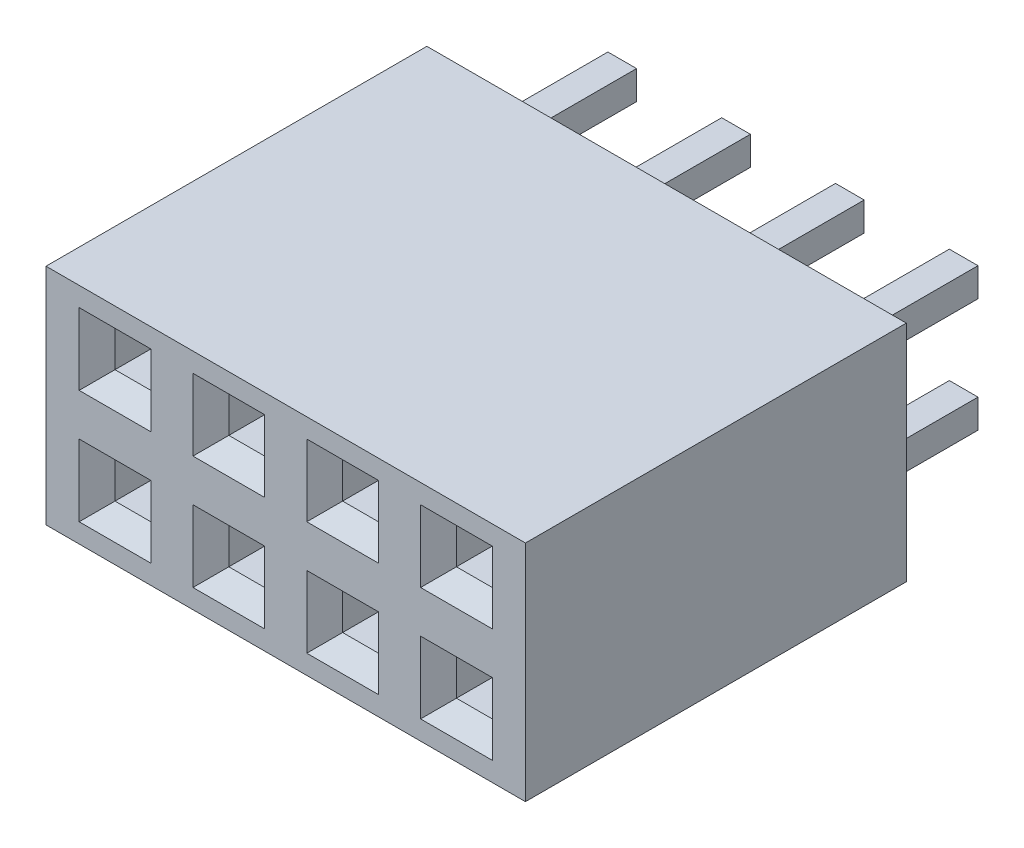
ISO-10303-21;
HEADER;
FILE_DESCRIPTION(('STEP AP214'),'2;1');
FILE_NAME('part.step','',(''),(''),'','','');
FILE_SCHEMA(('AUTOMOTIVE_DESIGN { 1 0 10303 214 1 1 1 1 }'));
ENDSEC;
DATA;
#1=APPLICATION_CONTEXT('core data for automotive mechanical design processes');
#2=APPLICATION_PROTOCOL_DEFINITION('international standard','automotive_design',2000,#1);
#3=PRODUCT_CONTEXT('',#1,'mechanical');
#4=PRODUCT('Part','Part','',(#3));
#5=PRODUCT_RELATED_PRODUCT_CATEGORY('part','',(#4));
#6=PRODUCT_DEFINITION_FORMATION('','',#4);
#7=PRODUCT_DEFINITION_CONTEXT('part definition',#1,'design');
#8=PRODUCT_DEFINITION('design','',#6,#7);
#9=PRODUCT_DEFINITION_SHAPE('','',#8);
#10=(LENGTH_UNIT() NAMED_UNIT(*) SI_UNIT(.MILLI.,.METRE.));
#11=(NAMED_UNIT(*) PLANE_ANGLE_UNIT() SI_UNIT($,.RADIAN.));
#12=(NAMED_UNIT(*) SI_UNIT($,.STERADIAN.) SOLID_ANGLE_UNIT());
#13=UNCERTAINTY_MEASURE_WITH_UNIT(LENGTH_MEASURE(1.E-05),#10,'distance_accuracy_value','');
#14=(GEOMETRIC_REPRESENTATION_CONTEXT(3) GLOBAL_UNCERTAINTY_ASSIGNED_CONTEXT((#13)) GLOBAL_UNIT_ASSIGNED_CONTEXT((#10,
#11,#12)) REPRESENTATION_CONTEXT('',''));
#15=CARTESIAN_POINT('',(0.,0.,0.));
#16=DIRECTION('',(0.,0.,1.));
#17=DIRECTION('',(1.,0.,0.));
#18=AXIS2_PLACEMENT_3D('',#15,#16,#17);
#19=CARTESIAN_POINT('',(4.21,-0.87,2.5));
#20=DIRECTION('',(-1.,0.,0.));
#21=DIRECTION('',(0.,0.,1.));
#22=AXIS2_PLACEMENT_3D('',#19,#20,#21);
#23=PLANE('',#22);
#24=DIRECTION('',(0.,0.,1.));
#25=VECTOR('',#24,1.);
#26=CARTESIAN_POINT('',(4.21,-0.87,2.5));
#27=LINE('',#26,#25);
#28=CARTESIAN_POINT('',(4.21,-0.87,2.5));
#29=VERTEX_POINT('',#28);
#30=CARTESIAN_POINT('',(4.21,-0.87,8.1));
#31=VERTEX_POINT('',#30);
#32=EDGE_CURVE('E638',#29,#31,#27,.T.);
#33=ORIENTED_EDGE('',*,*,#32,.F.);
#34=DIRECTION('',(0.,1.,0.));
#35=VECTOR('',#34,1.);
#36=CARTESIAN_POINT('',(4.21,-0.87,2.5));
#37=LINE('',#36,#35);
#38=CARTESIAN_POINT('',(4.21,-1.67,2.5));
#39=VERTEX_POINT('',#38);
#40=EDGE_CURVE('E643',#29,#39,#37,.F.);
#41=ORIENTED_EDGE('',*,*,#40,.T.);
#42=DIRECTION('',(0.,0.,1.));
#43=VECTOR('',#42,1.);
#44=CARTESIAN_POINT('',(4.21,-1.67,2.5));
#45=LINE('',#44,#43);
#46=CARTESIAN_POINT('',(4.21,-1.67,8.1));
#47=VERTEX_POINT('',#46);
#48=EDGE_CURVE('E640',#47,#39,#45,.F.);
#49=ORIENTED_EDGE('',*,*,#48,.F.);
#50=DIRECTION('',(0.,1.,0.));
#51=VECTOR('',#50,1.);
#52=CARTESIAN_POINT('',(4.21,-0.87,8.1));
#53=LINE('',#52,#51);
#54=EDGE_CURVE('E20',#47,#31,#53,.T.);
#55=ORIENTED_EDGE('',*,*,#54,.T.);
#56=EDGE_LOOP('',(#33,#41,#49,#55));
#57=FACE_BOUND('',#56,.T.);
#58=ADVANCED_FACE('F17',(#57),#23,.T.);
#59=CARTESIAN_POINT('',(1.67,-0.87,2.5));
#60=DIRECTION('',(-1.,0.,0.));
#61=DIRECTION('',(0.,0.,1.));
#62=AXIS2_PLACEMENT_3D('',#59,#60,#61);
#63=PLANE('',#62);
#64=DIRECTION('',(0.,0.,1.));
#65=VECTOR('',#64,1.);
#66=CARTESIAN_POINT('',(1.67,-0.87,2.5));
#67=LINE('',#66,#65);
#68=CARTESIAN_POINT('',(1.67,-0.87,2.5));
#69=VERTEX_POINT('',#68);
#70=CARTESIAN_POINT('',(1.67,-0.87,8.1));
#71=VERTEX_POINT('',#70);
#72=EDGE_CURVE('E699',#69,#71,#67,.T.);
#73=ORIENTED_EDGE('',*,*,#72,.F.);
#74=DIRECTION('',(0.,1.,0.));
#75=VECTOR('',#74,1.);
#76=CARTESIAN_POINT('',(1.67,-0.87,2.5));
#77=LINE('',#76,#75);
#78=CARTESIAN_POINT('',(1.67,-1.67,2.5));
#79=VERTEX_POINT('',#78);
#80=EDGE_CURVE('E686',#69,#79,#77,.F.);
#81=ORIENTED_EDGE('',*,*,#80,.T.);
#82=DIRECTION('',(0.,0.,1.));
#83=VECTOR('',#82,1.);
#84=CARTESIAN_POINT('',(1.67,-1.67,2.5));
#85=LINE('',#84,#83);
#86=CARTESIAN_POINT('',(1.67,-1.67,8.1));
#87=VERTEX_POINT('',#86);
#88=EDGE_CURVE('E708',#87,#79,#85,.F.);
#89=ORIENTED_EDGE('',*,*,#88,.F.);
#90=DIRECTION('',(0.,1.,0.));
#91=VECTOR('',#90,1.);
#92=CARTESIAN_POINT('',(1.67,-0.87,8.1));
#93=LINE('',#92,#91);
#94=EDGE_CURVE('E688',#87,#71,#93,.T.);
#95=ORIENTED_EDGE('',*,*,#94,.T.);
#96=EDGE_LOOP('',(#73,#81,#89,#95));
#97=FACE_BOUND('',#96,.T.);
#98=ADVANCED_FACE('F3019',(#97),#63,.T.);
#99=CARTESIAN_POINT('',(-3.41,-0.87,2.5));
#100=DIRECTION('',(-1.,0.,0.));
#101=DIRECTION('',(0.,0.,1.));
#102=AXIS2_PLACEMENT_3D('',#99,#100,#101);
#103=PLANE('',#102);
#104=DIRECTION('',(0.,0.,1.));
#105=VECTOR('',#104,1.);
#106=CARTESIAN_POINT('',(-3.41,-0.87,2.5));
#107=LINE('',#106,#105);
#108=CARTESIAN_POINT('',(-3.41,-0.87,2.5));
#109=VERTEX_POINT('',#108);
#110=CARTESIAN_POINT('',(-3.41,-0.87,8.1));
#111=VERTEX_POINT('',#110);
#112=EDGE_CURVE('E717',#109,#111,#107,.T.);
#113=ORIENTED_EDGE('',*,*,#112,.F.);
#114=DIRECTION('',(0.,1.,0.));
#115=VECTOR('',#114,1.);
#116=CARTESIAN_POINT('',(-3.41,-0.87,2.5));
#117=LINE('',#116,#115);
#118=CARTESIAN_POINT('',(-3.41,-1.67,2.5));
#119=VERTEX_POINT('',#118);
#120=EDGE_CURVE('E682',#109,#119,#117,.F.);
#121=ORIENTED_EDGE('',*,*,#120,.T.);
#122=DIRECTION('',(0.,0.,1.));
#123=VECTOR('',#122,1.);
#124=CARTESIAN_POINT('',(-3.41,-1.67,2.5));
#125=LINE('',#124,#123);
#126=CARTESIAN_POINT('',(-3.41,-1.67,8.1));
#127=VERTEX_POINT('',#126);
#128=EDGE_CURVE('E724',#127,#119,#125,.F.);
#129=ORIENTED_EDGE('',*,*,#128,.F.);
#130=DIRECTION('',(0.,1.,0.));
#131=VECTOR('',#130,1.);
#132=CARTESIAN_POINT('',(-3.41,-0.87,8.1));
#133=LINE('',#132,#131);
#134=EDGE_CURVE('E684',#127,#111,#133,.T.);
#135=ORIENTED_EDGE('',*,*,#134,.T.);
#136=EDGE_LOOP('',(#113,#121,#129,#135));
#137=FACE_BOUND('',#136,.T.);
#138=ADVANCED_FACE('F3010',(#137),#103,.T.);
#139=CARTESIAN_POINT('',(3.41,0.87,2.5));
#140=DIRECTION('',(-1.,0.,0.));
#141=DIRECTION('',(0.,0.,1.));
#142=AXIS2_PLACEMENT_3D('',#139,#140,#141);
#143=PLANE('',#142);
#144=DIRECTION('',(0.,1.,0.));
#145=VECTOR('',#144,1.);
#146=CARTESIAN_POINT('',(3.41,0.87,8.1));
#147=LINE('',#146,#145);
#148=CARTESIAN_POINT('',(3.41,0.87,8.1));
#149=VERTEX_POINT('',#148);
#150=CARTESIAN_POINT('',(3.41,1.67,8.1));
#151=VERTEX_POINT('',#150);
#152=EDGE_CURVE('E680',#149,#151,#147,.T.);
#153=ORIENTED_EDGE('',*,*,#152,.F.);
#154=DIRECTION('',(0.,0.,1.));
#155=VECTOR('',#154,1.);
#156=CARTESIAN_POINT('',(3.41,0.87,2.5));
#157=LINE('',#156,#155);
#158=CARTESIAN_POINT('',(3.41,0.87,2.5));
#159=VERTEX_POINT('',#158);
#160=EDGE_CURVE('E749',#149,#159,#157,.F.);
#161=ORIENTED_EDGE('',*,*,#160,.T.);
#162=DIRECTION('',(0.,1.,0.));
#163=VECTOR('',#162,1.);
#164=CARTESIAN_POINT('',(3.41,0.,2.5));
#165=LINE('',#164,#163);
#166=CARTESIAN_POINT('',(3.41,1.67,2.5));
#167=VERTEX_POINT('',#166);
#168=EDGE_CURVE('E733',#159,#167,#165,.T.);
#169=ORIENTED_EDGE('',*,*,#168,.T.);
#170=DIRECTION('',(0.,0.,1.));
#171=VECTOR('',#170,1.);
#172=CARTESIAN_POINT('',(3.41,1.67,2.5));
#173=LINE('',#172,#171);
#174=EDGE_CURVE('E738',#167,#151,#173,.T.);
#175=ORIENTED_EDGE('',*,*,#174,.T.);
#176=EDGE_LOOP('',(#153,#161,#169,#175));
#177=FACE_BOUND('',#176,.T.);
#178=ADVANCED_FACE('F3001',(#177),#143,.F.);
#179=CARTESIAN_POINT('',(0.87,0.87,2.5));
#180=DIRECTION('',(-1.,0.,0.));
#181=DIRECTION('',(0.,0.,1.));
#182=AXIS2_PLACEMENT_3D('',#179,#180,#181);
#183=PLANE('',#182);
#184=DIRECTION('',(0.,1.,0.));
#185=VECTOR('',#184,1.);
#186=CARTESIAN_POINT('',(0.87,0.87,8.1));
#187=LINE('',#186,#185);
#188=CARTESIAN_POINT('',(0.87,0.87,8.1));
#189=VERTEX_POINT('',#188);
#190=CARTESIAN_POINT('',(0.87,1.67,8.1));
#191=VERTEX_POINT('',#190);
#192=EDGE_CURVE('E678',#189,#191,#187,.T.);
#193=ORIENTED_EDGE('',*,*,#192,.F.);
#194=DIRECTION('',(0.,0.,1.));
#195=VECTOR('',#194,1.);
#196=CARTESIAN_POINT('',(0.87,0.87,2.5));
#197=LINE('',#196,#195);
#198=CARTESIAN_POINT('',(0.87,0.87,2.5));
#199=VERTEX_POINT('',#198);
#200=EDGE_CURVE('E768',#189,#199,#197,.F.);
#201=ORIENTED_EDGE('',*,*,#200,.T.);
#202=DIRECTION('',(0.,1.,0.));
#203=VECTOR('',#202,1.);
#204=CARTESIAN_POINT('',(0.87,0.,2.5));
#205=LINE('',#204,#203);
#206=CARTESIAN_POINT('',(0.87,1.67,2.5));
#207=VERTEX_POINT('',#206);
#208=EDGE_CURVE('E752',#199,#207,#205,.T.);
#209=ORIENTED_EDGE('',*,*,#208,.T.);
#210=DIRECTION('',(0.,0.,1.));
#211=VECTOR('',#210,1.);
#212=CARTESIAN_POINT('',(0.87,1.67,2.5));
#213=LINE('',#212,#211);
#214=EDGE_CURVE('E757',#207,#191,#213,.T.);
#215=ORIENTED_EDGE('',*,*,#214,.T.);
#216=EDGE_LOOP('',(#193,#201,#209,#215));
#217=FACE_BOUND('',#216,.T.);
#218=ADVANCED_FACE('F2992',(#217),#183,.F.);
#219=CARTESIAN_POINT('',(-4.21,0.87,2.5));
#220=DIRECTION('',(-1.,0.,0.));
#221=DIRECTION('',(0.,0.,1.));
#222=AXIS2_PLACEMENT_3D('',#219,#220,#221);
#223=PLANE('',#222);
#224=DIRECTION('',(0.,1.,0.));
#225=VECTOR('',#224,1.);
#226=CARTESIAN_POINT('',(-4.21,0.87,8.1));
#227=LINE('',#226,#225);
#228=CARTESIAN_POINT('',(-4.21,0.87,8.1));
#229=VERTEX_POINT('',#228);
#230=CARTESIAN_POINT('',(-4.21,1.67,8.1));
#231=VERTEX_POINT('',#230);
#232=EDGE_CURVE('E676',#229,#231,#227,.T.);
#233=ORIENTED_EDGE('',*,*,#232,.F.);
#234=DIRECTION('',(0.,0.,1.));
#235=VECTOR('',#234,1.);
#236=CARTESIAN_POINT('',(-4.21,0.87,2.5));
#237=LINE('',#236,#235);
#238=CARTESIAN_POINT('',(-4.21,0.87,2.5));
#239=VERTEX_POINT('',#238);
#240=EDGE_CURVE('E787',#229,#239,#237,.F.);
#241=ORIENTED_EDGE('',*,*,#240,.T.);
#242=DIRECTION('',(0.,1.,0.));
#243=VECTOR('',#242,1.);
#244=CARTESIAN_POINT('',(-4.21,0.,2.5));
#245=LINE('',#244,#243);
#246=CARTESIAN_POINT('',(-4.21,1.67,2.5));
#247=VERTEX_POINT('',#246);
#248=EDGE_CURVE('E771',#239,#247,#245,.T.);
#249=ORIENTED_EDGE('',*,*,#248,.T.);
#250=DIRECTION('',(0.,0.,1.));
#251=VECTOR('',#250,1.);
#252=CARTESIAN_POINT('',(-4.21,1.67,2.5));
#253=LINE('',#252,#251);
#254=EDGE_CURVE('E776',#247,#231,#253,.T.);
#255=ORIENTED_EDGE('',*,*,#254,.T.);
#256=EDGE_LOOP('',(#233,#241,#249,#255));
#257=FACE_BOUND('',#256,.T.);
#258=ADVANCED_FACE('F2983',(#257),#223,.F.);
#259=CARTESIAN_POINT('',(-1.67,0.87,2.5));
#260=DIRECTION('',(-1.,0.,0.));
#261=DIRECTION('',(0.,0.,1.));
#262=AXIS2_PLACEMENT_3D('',#259,#260,#261);
#263=PLANE('',#262);
#264=DIRECTION('',(0.,1.,0.));
#265=VECTOR('',#264,1.);
#266=CARTESIAN_POINT('',(-1.67,0.87,8.1));
#267=LINE('',#266,#265);
#268=CARTESIAN_POINT('',(-1.67,0.87,8.1));
#269=VERTEX_POINT('',#268);
#270=CARTESIAN_POINT('',(-1.67,1.67,8.1));
#271=VERTEX_POINT('',#270);
#272=EDGE_CURVE('E674',#269,#271,#267,.T.);
#273=ORIENTED_EDGE('',*,*,#272,.F.);
#274=DIRECTION('',(0.,0.,1.));
#275=VECTOR('',#274,1.);
#276=CARTESIAN_POINT('',(-1.67,0.87,2.5));
#277=LINE('',#276,#275);
#278=CARTESIAN_POINT('',(-1.67,0.87,2.5));
#279=VERTEX_POINT('',#278);
#280=EDGE_CURVE('E806',#269,#279,#277,.F.);
#281=ORIENTED_EDGE('',*,*,#280,.T.);
#282=DIRECTION('',(0.,1.,0.));
#283=VECTOR('',#282,1.);
#284=CARTESIAN_POINT('',(-1.67,0.,2.5));
#285=LINE('',#284,#283);
#286=CARTESIAN_POINT('',(-1.67,1.67,2.5));
#287=VERTEX_POINT('',#286);
#288=EDGE_CURVE('E790',#279,#287,#285,.T.);
#289=ORIENTED_EDGE('',*,*,#288,.T.);
#290=DIRECTION('',(0.,0.,1.));
#291=VECTOR('',#290,1.);
#292=CARTESIAN_POINT('',(-1.67,1.67,2.5));
#293=LINE('',#292,#291);
#294=EDGE_CURVE('E795',#287,#271,#293,.T.);
#295=ORIENTED_EDGE('',*,*,#294,.T.);
#296=EDGE_LOOP('',(#273,#281,#289,#295));
#297=FACE_BOUND('',#296,.T.);
#298=ADVANCED_FACE('F2974',(#297),#263,.F.);
#299=CARTESIAN_POINT('',(-0.87,-0.87,2.5));
#300=DIRECTION('',(-1.,0.,0.));
#301=DIRECTION('',(0.,0.,1.));
#302=AXIS2_PLACEMENT_3D('',#299,#300,#301);
#303=PLANE('',#302);
#304=DIRECTION('',(0.,0.,1.));
#305=VECTOR('',#304,1.);
#306=CARTESIAN_POINT('',(-0.87,-0.87,2.5));
#307=LINE('',#306,#305);
#308=CARTESIAN_POINT('',(-0.87,-0.87,2.5));
#309=VERTEX_POINT('',#308);
#310=CARTESIAN_POINT('',(-0.87,-0.87,8.1));
#311=VERTEX_POINT('',#310);
#312=EDGE_CURVE('E809',#309,#311,#307,.T.);
#313=ORIENTED_EDGE('',*,*,#312,.F.);
#314=DIRECTION('',(0.,1.,0.));
#315=VECTOR('',#314,1.);
#316=CARTESIAN_POINT('',(-0.87,-0.87,2.5));
#317=LINE('',#316,#315);
#318=CARTESIAN_POINT('',(-0.87,-1.67,2.5));
#319=VERTEX_POINT('',#318);
#320=EDGE_CURVE('E651',#309,#319,#317,.F.);
#321=ORIENTED_EDGE('',*,*,#320,.T.);
#322=DIRECTION('',(0.,0.,1.));
#323=VECTOR('',#322,1.);
#324=CARTESIAN_POINT('',(-0.87,-1.67,2.5));
#325=LINE('',#324,#323);
#326=CARTESIAN_POINT('',(-0.87,-1.67,8.1));
#327=VERTEX_POINT('',#326);
#328=EDGE_CURVE('E816',#327,#319,#325,.F.);
#329=ORIENTED_EDGE('',*,*,#328,.F.);
#330=DIRECTION('',(0.,1.,0.));
#331=VECTOR('',#330,1.);
#332=CARTESIAN_POINT('',(-0.87,-0.87,8.1));
#333=LINE('',#332,#331);
#334=EDGE_CURVE('E672',#327,#311,#333,.T.);
#335=ORIENTED_EDGE('',*,*,#334,.T.);
#336=EDGE_LOOP('',(#313,#321,#329,#335));
#337=FACE_BOUND('',#336,.T.);
#338=ADVANCED_FACE('F2966',(#337),#303,.T.);
#339=CARTESIAN_POINT('',(-3.49,-1.59,-2.82));
#340=DIRECTION('',(0.,-0.707106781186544,-0.707106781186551));
#341=DIRECTION('',(0.,0.707106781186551,-0.707106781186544));
#342=AXIS2_PLACEMENT_3D('',#339,#340,#341);
#343=PLANE('',#342);
#344=DIRECTION('',(-0.577350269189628,0.577350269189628,-0.577350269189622));
#345=VECTOR('',#344,1.);
#346=CARTESIAN_POINT('',(-3.49,-1.59,-2.82));
#347=LINE('',#346,#345);
#348=CARTESIAN_POINT('',(-3.49,-1.59,-2.82));
#349=VERTEX_POINT('',#348);
#350=CARTESIAN_POINT('',(-3.67,-1.41,-3.));
#351=VERTEX_POINT('',#350);
#352=EDGE_CURVE('E825',#349,#351,#347,.T.);
#353=ORIENTED_EDGE('',*,*,#352,.F.);
#354=DIRECTION('',(1.,0.,0.));
#355=VECTOR('',#354,1.);
#356=CARTESIAN_POINT('',(-3.49,-1.59,-2.82));
#357=LINE('',#356,#355);
#358=CARTESIAN_POINT('',(-4.13,-1.59,-2.82));
#359=VERTEX_POINT('',#358);
#360=EDGE_CURVE('E838',#359,#349,#357,.T.);
#361=ORIENTED_EDGE('',*,*,#360,.F.);
#362=DIRECTION('',(-0.577350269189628,-0.577350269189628,0.577350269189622));
#363=VECTOR('',#362,1.);
#364=CARTESIAN_POINT('',(-3.95,-1.41,-3.));
#365=LINE('',#364,#363);
#366=CARTESIAN_POINT('',(-3.95,-1.41,-3.));
#367=VERTEX_POINT('',#366);
#368=EDGE_CURVE('E833',#367,#359,#365,.T.);
#369=ORIENTED_EDGE('',*,*,#368,.F.);
#370=DIRECTION('',(1.,0.,0.));
#371=VECTOR('',#370,1.);
#372=CARTESIAN_POINT('',(-5.08,-1.41,-3.));
#373=LINE('',#372,#371);
#374=EDGE_CURVE('E827',#367,#351,#373,.T.);
#375=ORIENTED_EDGE('',*,*,#374,.T.);
#376=EDGE_LOOP('',(#353,#361,#369,#375));
#377=FACE_BOUND('',#376,.T.);
#378=ADVANCED_FACE('F1597',(#377),#343,.T.);
#379=CARTESIAN_POINT('',(-0.95,-1.59,-2.82));
#380=DIRECTION('',(0.,-0.707106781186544,-0.707106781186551));
#381=DIRECTION('',(0.,0.707106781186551,-0.707106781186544));
#382=AXIS2_PLACEMENT_3D('',#379,#380,#381);
#383=PLANE('',#382);
#384=DIRECTION('',(-0.577350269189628,0.577350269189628,-0.577350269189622));
#385=VECTOR('',#384,1.);
#386=CARTESIAN_POINT('',(-0.95,-1.59,-2.82));
#387=LINE('',#386,#385);
#388=CARTESIAN_POINT('',(-0.95,-1.59,-2.82));
#389=VERTEX_POINT('',#388);
#390=CARTESIAN_POINT('',(-1.13,-1.41,-3.));
#391=VERTEX_POINT('',#390);
#392=EDGE_CURVE('E842',#389,#391,#387,.T.);
#393=ORIENTED_EDGE('',*,*,#392,.F.);
#394=DIRECTION('',(1.,0.,0.));
#395=VECTOR('',#394,1.);
#396=CARTESIAN_POINT('',(-0.95,-1.59,-2.82));
#397=LINE('',#396,#395);
#398=CARTESIAN_POINT('',(-1.59,-1.59,-2.82));
#399=VERTEX_POINT('',#398);
#400=EDGE_CURVE('E855',#399,#389,#397,.T.);
#401=ORIENTED_EDGE('',*,*,#400,.F.);
#402=DIRECTION('',(-0.577350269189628,-0.577350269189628,0.577350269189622));
#403=VECTOR('',#402,1.);
#404=CARTESIAN_POINT('',(-1.41,-1.41,-3.));
#405=LINE('',#404,#403);
#406=CARTESIAN_POINT('',(-1.41,-1.41,-3.));
#407=VERTEX_POINT('',#406);
#408=EDGE_CURVE('E850',#407,#399,#405,.T.);
#409=ORIENTED_EDGE('',*,*,#408,.F.);
#410=DIRECTION('',(1.,0.,0.));
#411=VECTOR('',#410,1.);
#412=CARTESIAN_POINT('',(-2.54,-1.41,-3.));
#413=LINE('',#412,#411);
#414=EDGE_CURVE('E844',#407,#391,#413,.T.);
#415=ORIENTED_EDGE('',*,*,#414,.T.);
#416=EDGE_LOOP('',(#393,#401,#409,#415));
#417=FACE_BOUND('',#416,.T.);
#418=ADVANCED_FACE('F2949',(#417),#383,.T.);
#419=CARTESIAN_POINT('',(4.13,-1.59,-2.82));
#420=DIRECTION('',(0.,-0.707106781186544,-0.707106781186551));
#421=DIRECTION('',(0.,0.707106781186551,-0.707106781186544));
#422=AXIS2_PLACEMENT_3D('',#419,#420,#421);
#423=PLANE('',#422);
#424=DIRECTION('',(-0.577350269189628,0.577350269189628,-0.577350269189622));
#425=VECTOR('',#424,1.);
#426=CARTESIAN_POINT('',(4.13,-1.59,-2.82));
#427=LINE('',#426,#425);
#428=CARTESIAN_POINT('',(4.13,-1.59,-2.82));
#429=VERTEX_POINT('',#428);
#430=CARTESIAN_POINT('',(3.95,-1.41,-3.));
#431=VERTEX_POINT('',#430);
#432=EDGE_CURVE('E859',#429,#431,#427,.T.);
#433=ORIENTED_EDGE('',*,*,#432,.F.);
#434=DIRECTION('',(1.,0.,0.));
#435=VECTOR('',#434,1.);
#436=CARTESIAN_POINT('',(4.13,-1.59,-2.82));
#437=LINE('',#436,#435);
#438=CARTESIAN_POINT('',(3.49,-1.59,-2.82));
#439=VERTEX_POINT('',#438);
#440=EDGE_CURVE('E872',#439,#429,#437,.T.);
#441=ORIENTED_EDGE('',*,*,#440,.F.);
#442=DIRECTION('',(-0.577350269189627,-0.577350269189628,0.577350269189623));
#443=VECTOR('',#442,1.);
#444=CARTESIAN_POINT('',(3.67,-1.41,-3.));
#445=LINE('',#444,#443);
#446=CARTESIAN_POINT('',(3.67,-1.41,-3.));
#447=VERTEX_POINT('',#446);
#448=EDGE_CURVE('E867',#447,#439,#445,.T.);
#449=ORIENTED_EDGE('',*,*,#448,.F.);
#450=DIRECTION('',(1.,0.,0.));
#451=VECTOR('',#450,1.);
#452=CARTESIAN_POINT('',(2.54,-1.41,-3.));
#453=LINE('',#452,#451);
#454=EDGE_CURVE('E861',#447,#431,#453,.T.);
#455=ORIENTED_EDGE('',*,*,#454,.T.);
#456=EDGE_LOOP('',(#433,#441,#449,#455));
#457=FACE_BOUND('',#456,.T.);
#458=ADVANCED_FACE('F2940',(#457),#423,.T.);
#459=CARTESIAN_POINT('',(1.59,-1.59,-2.82));
#460=DIRECTION('',(0.,-0.707106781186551,-0.707106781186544));
#461=DIRECTION('',(0.,0.707106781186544,-0.707106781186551));
#462=AXIS2_PLACEMENT_3D('',#459,#460,#461);
#463=PLANE('',#462);
#464=DIRECTION('',(-0.577350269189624,0.577350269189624,-0.577350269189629));
#465=VECTOR('',#464,1.);
#466=CARTESIAN_POINT('',(1.59,-1.59,-2.82));
#467=LINE('',#466,#465);
#468=CARTESIAN_POINT('',(1.59,-1.59,-2.82));
#469=VERTEX_POINT('',#468);
#470=CARTESIAN_POINT('',(1.41,-1.41,-3.));
#471=VERTEX_POINT('',#470);
#472=EDGE_CURVE('E876',#469,#471,#467,.T.);
#473=ORIENTED_EDGE('',*,*,#472,.F.);
#474=DIRECTION('',(1.,0.,0.));
#475=VECTOR('',#474,1.);
#476=CARTESIAN_POINT('',(1.59,-1.59,-2.82));
#477=LINE('',#476,#475);
#478=CARTESIAN_POINT('',(0.95,-1.59,-2.82));
#479=VERTEX_POINT('',#478);
#480=EDGE_CURVE('E889',#479,#469,#477,.T.);
#481=ORIENTED_EDGE('',*,*,#480,.F.);
#482=DIRECTION('',(-0.577350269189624,-0.577350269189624,0.577350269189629));
#483=VECTOR('',#482,1.);
#484=CARTESIAN_POINT('',(1.13,-1.41,-3.));
#485=LINE('',#484,#483);
#486=CARTESIAN_POINT('',(1.13,-1.41,-3.));
#487=VERTEX_POINT('',#486);
#488=EDGE_CURVE('E884',#487,#479,#485,.T.);
#489=ORIENTED_EDGE('',*,*,#488,.F.);
#490=DIRECTION('',(1.,0.,0.));
#491=VECTOR('',#490,1.);
#492=CARTESIAN_POINT('',(0.,-1.41,-3.));
#493=LINE('',#492,#491);
#494=EDGE_CURVE('E878',#487,#471,#493,.T.);
#495=ORIENTED_EDGE('',*,*,#494,.T.);
#496=EDGE_LOOP('',(#473,#481,#489,#495));
#497=FACE_BOUND('',#496,.T.);
#498=ADVANCED_FACE('F2931',(#497),#463,.T.);
#499=CARTESIAN_POINT('',(-1.41,0.,-3.));
#500=DIRECTION('',(0.707106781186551,0.,0.707106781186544));
#501=DIRECTION('',(0.707106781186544,0.,-0.707106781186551));
#502=AXIS2_PLACEMENT_3D('',#499,#500,#501);
#503=PLANE('',#502);
#504=DIRECTION('',(0.,1.,0.));
#505=VECTOR('',#504,1.);
#506=CARTESIAN_POINT('',(-1.41,0.,-3.));
#507=LINE('',#506,#505);
#508=CARTESIAN_POINT('',(-1.41,1.41,-3.));
#509=VERTEX_POINT('',#508);
#510=CARTESIAN_POINT('',(-1.41,1.13,-3.));
#511=VERTEX_POINT('',#510);
#512=EDGE_CURVE('E893',#509,#511,#507,.F.);
#513=ORIENTED_EDGE('',*,*,#512,.T.);
#514=DIRECTION('',(-0.577350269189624,-0.577350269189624,0.57735026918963));
#515=VECTOR('',#514,1.);
#516=CARTESIAN_POINT('',(-1.41,1.13,-3.));
#517=LINE('',#516,#515);
#518=CARTESIAN_POINT('',(-1.59,0.95,-2.82));
#519=VERTEX_POINT('',#518);
#520=EDGE_CURVE('E904',#511,#519,#517,.T.);
#521=ORIENTED_EDGE('',*,*,#520,.T.);
#522=DIRECTION('',(0.,1.,0.));
#523=VECTOR('',#522,1.);
#524=CARTESIAN_POINT('',(-1.59,0.95,-2.82));
#525=LINE('',#524,#523);
#526=CARTESIAN_POINT('',(-1.59,1.59,-2.82));
#527=VERTEX_POINT('',#526);
#528=EDGE_CURVE('E910',#519,#527,#525,.T.);
#529=ORIENTED_EDGE('',*,*,#528,.T.);
#530=DIRECTION('',(0.577350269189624,-0.577350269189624,-0.577350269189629));
#531=VECTOR('',#530,1.);
#532=CARTESIAN_POINT('',(-1.59,1.59,-2.82));
#533=LINE('',#532,#531);
#534=EDGE_CURVE('E898',#527,#509,#533,.T.);
#535=ORIENTED_EDGE('',*,*,#534,.T.);
#536=EDGE_LOOP('',(#513,#521,#529,#535));
#537=FACE_BOUND('',#536,.T.);
#538=ADVANCED_FACE('F2922',(#537),#503,.F.);
#539=CARTESIAN_POINT('',(1.13,0.,-3.));
#540=DIRECTION('',(0.707106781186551,0.,0.707106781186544));
#541=DIRECTION('',(0.707106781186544,0.,-0.707106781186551));
#542=AXIS2_PLACEMENT_3D('',#539,#540,#541);
#543=PLANE('',#542);
#544=DIRECTION('',(0.,1.,0.));
#545=VECTOR('',#544,1.);
#546=CARTESIAN_POINT('',(1.13,0.,-3.));
#547=LINE('',#546,#545);
#548=CARTESIAN_POINT('',(1.13,1.41,-3.));
#549=VERTEX_POINT('',#548);
#550=CARTESIAN_POINT('',(1.13,1.13,-3.));
#551=VERTEX_POINT('',#550);
#552=EDGE_CURVE('E913',#549,#551,#547,.F.);
#553=ORIENTED_EDGE('',*,*,#552,.T.);
#554=DIRECTION('',(-0.577350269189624,-0.577350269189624,0.577350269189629));
#555=VECTOR('',#554,1.);
#556=CARTESIAN_POINT('',(1.13,1.13,-3.));
#557=LINE('',#556,#555);
#558=CARTESIAN_POINT('',(0.95,0.95,-2.82));
#559=VERTEX_POINT('',#558);
#560=EDGE_CURVE('E924',#551,#559,#557,.T.);
#561=ORIENTED_EDGE('',*,*,#560,.T.);
#562=DIRECTION('',(0.,1.,0.));
#563=VECTOR('',#562,1.);
#564=CARTESIAN_POINT('',(0.95,0.95,-2.82));
#565=LINE('',#564,#563);
#566=CARTESIAN_POINT('',(0.95,1.59,-2.82));
#567=VERTEX_POINT('',#566);
#568=EDGE_CURVE('E930',#559,#567,#565,.T.);
#569=ORIENTED_EDGE('',*,*,#568,.T.);
#570=DIRECTION('',(0.577350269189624,-0.577350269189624,-0.577350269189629));
#571=VECTOR('',#570,1.);
#572=CARTESIAN_POINT('',(0.95,1.59,-2.82));
#573=LINE('',#572,#571);
#574=EDGE_CURVE('E918',#567,#549,#573,.T.);
#575=ORIENTED_EDGE('',*,*,#574,.T.);
#576=EDGE_LOOP('',(#553,#561,#569,#575));
#577=FACE_BOUND('',#576,.T.);
#578=ADVANCED_FACE('F2913',(#577),#543,.F.);
#579=CARTESIAN_POINT('',(3.67,0.,-3.));
#580=DIRECTION('',(0.707106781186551,0.,0.707106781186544));
#581=DIRECTION('',(0.707106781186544,0.,-0.707106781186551));
#582=AXIS2_PLACEMENT_3D('',#579,#580,#581);
#583=PLANE('',#582);
#584=DIRECTION('',(0.,1.,0.));
#585=VECTOR('',#584,1.);
#586=CARTESIAN_POINT('',(3.67,0.,-3.));
#587=LINE('',#586,#585);
#588=CARTESIAN_POINT('',(3.67,1.41,-3.));
#589=VERTEX_POINT('',#588);
#590=CARTESIAN_POINT('',(3.67,1.13,-3.));
#591=VERTEX_POINT('',#590);
#592=EDGE_CURVE('E933',#589,#591,#587,.F.);
#593=ORIENTED_EDGE('',*,*,#592,.T.);
#594=DIRECTION('',(-0.577350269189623,-0.577350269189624,0.57735026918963));
#595=VECTOR('',#594,1.);
#596=CARTESIAN_POINT('',(3.67,1.13,-3.));
#597=LINE('',#596,#595);
#598=CARTESIAN_POINT('',(3.49,0.95,-2.82));
#599=VERTEX_POINT('',#598);
#600=EDGE_CURVE('E944',#591,#599,#597,.T.);
#601=ORIENTED_EDGE('',*,*,#600,.T.);
#602=DIRECTION('',(0.,1.,0.));
#603=VECTOR('',#602,1.);
#604=CARTESIAN_POINT('',(3.49,0.95,-2.82));
#605=LINE('',#604,#603);
#606=CARTESIAN_POINT('',(3.49,1.59,-2.82));
#607=VERTEX_POINT('',#606);
#608=EDGE_CURVE('E950',#599,#607,#605,.T.);
#609=ORIENTED_EDGE('',*,*,#608,.T.);
#610=DIRECTION('',(0.577350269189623,-0.577350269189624,-0.57735026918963));
#611=VECTOR('',#610,1.);
#612=CARTESIAN_POINT('',(3.49,1.59,-2.82));
#613=LINE('',#612,#611);
#614=EDGE_CURVE('E938',#607,#589,#613,.T.);
#615=ORIENTED_EDGE('',*,*,#614,.T.);
#616=EDGE_LOOP('',(#593,#601,#609,#615));
#617=FACE_BOUND('',#616,.T.);
#618=ADVANCED_FACE('F2904',(#617),#583,.F.);
#619=CARTESIAN_POINT('',(-3.95,0.,-3.));
#620=DIRECTION('',(0.707106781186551,0.,0.707106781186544));
#621=DIRECTION('',(0.707106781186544,0.,-0.707106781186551));
#622=AXIS2_PLACEMENT_3D('',#619,#620,#621);
#623=PLANE('',#622);
#624=DIRECTION('',(0.,1.,0.));
#625=VECTOR('',#624,1.);
#626=CARTESIAN_POINT('',(-3.95,0.,-3.));
#627=LINE('',#626,#625);
#628=CARTESIAN_POINT('',(-3.95,1.41,-3.));
#629=VERTEX_POINT('',#628);
#630=CARTESIAN_POINT('',(-3.95,1.13,-3.));
#631=VERTEX_POINT('',#630);
#632=EDGE_CURVE('E953',#629,#631,#627,.F.);
#633=ORIENTED_EDGE('',*,*,#632,.T.);
#634=DIRECTION('',(-0.577350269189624,-0.577350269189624,0.57735026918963));
#635=VECTOR('',#634,1.);
#636=CARTESIAN_POINT('',(-3.95,1.13,-3.));
#637=LINE('',#636,#635);
#638=CARTESIAN_POINT('',(-4.13,0.95,-2.82));
#639=VERTEX_POINT('',#638);
#640=EDGE_CURVE('E964',#631,#639,#637,.T.);
#641=ORIENTED_EDGE('',*,*,#640,.T.);
#642=DIRECTION('',(0.,1.,0.));
#643=VECTOR('',#642,1.);
#644=CARTESIAN_POINT('',(-4.13,0.95,-2.82));
#645=LINE('',#644,#643);
#646=CARTESIAN_POINT('',(-4.13,1.59,-2.82));
#647=VERTEX_POINT('',#646);
#648=EDGE_CURVE('E970',#639,#647,#645,.T.);
#649=ORIENTED_EDGE('',*,*,#648,.T.);
#650=DIRECTION('',(0.577350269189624,-0.577350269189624,-0.577350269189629));
#651=VECTOR('',#650,1.);
#652=CARTESIAN_POINT('',(-4.13,1.59,-2.82));
#653=LINE('',#652,#651);
#654=EDGE_CURVE('E958',#647,#629,#653,.T.);
#655=ORIENTED_EDGE('',*,*,#654,.T.);
#656=EDGE_LOOP('',(#633,#641,#649,#655));
#657=FACE_BOUND('',#656,.T.);
#658=ADVANCED_FACE('F2896',(#657),#623,.F.);
#659=CARTESIAN_POINT('',(3.41,-0.87,2.5));
#660=DIRECTION('',(0.,-1.,0.));
#661=DIRECTION('',(1.,0.,0.));
#662=AXIS2_PLACEMENT_3D('',#659,#660,#661);
#663=PLANE('',#662);
#664=DIRECTION('',(0.,0.,-1.));
#665=VECTOR('',#664,1.);
#666=CARTESIAN_POINT('',(3.41,-0.87,2.5));
#667=LINE('',#666,#665);
#668=CARTESIAN_POINT('',(3.41,-0.87,2.5));
#669=VERTEX_POINT('',#668);
#670=CARTESIAN_POINT('',(3.41,-0.87,8.1));
#671=VERTEX_POINT('',#670);
#672=EDGE_CURVE('E973',#669,#671,#667,.F.);
#673=ORIENTED_EDGE('',*,*,#672,.F.);
#674=DIRECTION('',(-1.,0.,0.));
#675=VECTOR('',#674,1.);
#676=CARTESIAN_POINT('',(5.08,-0.87,2.5));
#677=LINE('',#676,#675);
#678=EDGE_CURVE('E650',#669,#29,#677,.F.);
#679=ORIENTED_EDGE('',*,*,#678,.T.);
#680=ORIENTED_EDGE('',*,*,#32,.T.);
#681=DIRECTION('',(1.,0.,0.));
#682=VECTOR('',#681,1.);
#683=CARTESIAN_POINT('',(3.41,-0.87,8.1));
#684=LINE('',#683,#682);
#685=EDGE_CURVE('E648',#31,#671,#684,.F.);
#686=ORIENTED_EDGE('',*,*,#685,.T.);
#687=EDGE_LOOP('',(#673,#679,#680,#686));
#688=FACE_BOUND('',#687,.T.);
#689=ADVANCED_FACE('F646',(#688),#663,.T.);
#690=CARTESIAN_POINT('',(3.41,-1.67,2.5));
#691=DIRECTION('',(0.,1.,0.));
#692=DIRECTION('',(0.,0.,1.));
#693=AXIS2_PLACEMENT_3D('',#690,#691,#692);
#694=PLANE('',#693);
#695=ORIENTED_EDGE('',*,*,#48,.T.);
#696=DIRECTION('',(-1.,0.,0.));
#697=VECTOR('',#696,1.);
#698=CARTESIAN_POINT('',(5.08,-1.67,2.5));
#699=LINE('',#698,#697);
#700=CARTESIAN_POINT('',(3.41,-1.67,2.5));
#701=VERTEX_POINT('',#700);
#702=EDGE_CURVE('E693',#39,#701,#699,.T.);
#703=ORIENTED_EDGE('',*,*,#702,.T.);
#704=DIRECTION('',(0.,0.,-1.));
#705=VECTOR('',#704,1.);
#706=CARTESIAN_POINT('',(3.41,-1.67,2.5));
#707=LINE('',#706,#705);
#708=CARTESIAN_POINT('',(3.41,-1.67,8.1));
#709=VERTEX_POINT('',#708);
#710=EDGE_CURVE('E975',#709,#701,#707,.T.);
#711=ORIENTED_EDGE('',*,*,#710,.F.);
#712=DIRECTION('',(1.,0.,0.));
#713=VECTOR('',#712,1.);
#714=CARTESIAN_POINT('',(3.41,-1.67,8.1));
#715=LINE('',#714,#713);
#716=EDGE_CURVE('E630',#709,#47,#715,.T.);
#717=ORIENTED_EDGE('',*,*,#716,.T.);
#718=EDGE_LOOP('',(#695,#703,#711,#717));
#719=FACE_BOUND('',#718,.T.);
#720=ADVANCED_FACE('F692',(#719),#694,.T.);
#721=CARTESIAN_POINT('',(5.08,0.,2.5));
#722=DIRECTION('',(0.,0.,-1.));
#723=DIRECTION('',(-1.,0.,0.));
#724=AXIS2_PLACEMENT_3D('',#721,#722,#723);
#725=PLANE('',#724);
#726=ORIENTED_EDGE('',*,*,#678,.F.);
#727=DIRECTION('',(0.,1.,0.));
#728=VECTOR('',#727,1.);
#729=CARTESIAN_POINT('',(3.41,-0.87,2.5));
#730=LINE('',#729,#728);
#731=EDGE_CURVE('E697',#701,#669,#730,.T.);
#732=ORIENTED_EDGE('',*,*,#731,.F.);
#733=ORIENTED_EDGE('',*,*,#702,.F.);
#734=ORIENTED_EDGE('',*,*,#40,.F.);
#735=EDGE_LOOP('',(#726,#732,#733,#734));
#736=FACE_BOUND('',#735,.T.);
#737=ADVANCED_FACE('F695',(#736),#725,.F.);
#738=CARTESIAN_POINT('',(0.87,-0.87,2.5));
#739=DIRECTION('',(0.,-1.,0.));
#740=DIRECTION('',(1.,0.,0.));
#741=AXIS2_PLACEMENT_3D('',#738,#739,#740);
#742=PLANE('',#741);
#743=DIRECTION('',(0.,0.,-1.));
#744=VECTOR('',#743,1.);
#745=CARTESIAN_POINT('',(0.87,-0.87,2.5));
#746=LINE('',#745,#744);
#747=CARTESIAN_POINT('',(0.87,-0.87,2.5));
#748=VERTEX_POINT('',#747);
#749=CARTESIAN_POINT('',(0.87,-0.87,8.1));
#750=VERTEX_POINT('',#749);
#751=EDGE_CURVE('E978',#748,#750,#746,.F.);
#752=ORIENTED_EDGE('',*,*,#751,.F.);
#753=DIRECTION('',(-1.,0.,0.));
#754=VECTOR('',#753,1.);
#755=CARTESIAN_POINT('',(2.54,-0.87,2.5));
#756=LINE('',#755,#754);
#757=EDGE_CURVE('E714',#748,#69,#756,.F.);
#758=ORIENTED_EDGE('',*,*,#757,.T.);
#759=ORIENTED_EDGE('',*,*,#72,.T.);
#760=DIRECTION('',(1.,0.,0.));
#761=VECTOR('',#760,1.);
#762=CARTESIAN_POINT('',(0.87,-0.87,8.1));
#763=LINE('',#762,#761);
#764=EDGE_CURVE('E704',#71,#750,#763,.F.);
#765=ORIENTED_EDGE('',*,*,#764,.T.);
#766=EDGE_LOOP('',(#752,#758,#759,#765));
#767=FACE_BOUND('',#766,.T.);
#768=ADVANCED_FACE('F2865',(#767),#742,.T.);
#769=CARTESIAN_POINT('',(0.87,-1.67,2.5));
#770=DIRECTION('',(0.,1.,0.));
#771=DIRECTION('',(0.,0.,1.));
#772=AXIS2_PLACEMENT_3D('',#769,#770,#771);
#773=PLANE('',#772);
#774=ORIENTED_EDGE('',*,*,#88,.T.);
#775=DIRECTION('',(-1.,0.,0.));
#776=VECTOR('',#775,1.);
#777=CARTESIAN_POINT('',(2.54,-1.67,2.5));
#778=LINE('',#777,#776);
#779=CARTESIAN_POINT('',(0.87,-1.67,2.5));
#780=VERTEX_POINT('',#779);
#781=EDGE_CURVE('E711',#79,#780,#778,.T.);
#782=ORIENTED_EDGE('',*,*,#781,.T.);
#783=DIRECTION('',(0.,0.,-1.));
#784=VECTOR('',#783,1.);
#785=CARTESIAN_POINT('',(0.87,-1.67,2.5));
#786=LINE('',#785,#784);
#787=CARTESIAN_POINT('',(0.87,-1.67,8.1));
#788=VERTEX_POINT('',#787);
#789=EDGE_CURVE('E981',#788,#780,#786,.T.);
#790=ORIENTED_EDGE('',*,*,#789,.F.);
#791=DIRECTION('',(1.,0.,0.));
#792=VECTOR('',#791,1.);
#793=CARTESIAN_POINT('',(0.87,-1.67,8.1));
#794=LINE('',#793,#792);
#795=EDGE_CURVE('E706',#788,#87,#794,.T.);
#796=ORIENTED_EDGE('',*,*,#795,.T.);
#797=EDGE_LOOP('',(#774,#782,#790,#796));
#798=FACE_BOUND('',#797,.T.);
#799=ADVANCED_FACE('F2856',(#798),#773,.T.);
#800=CARTESIAN_POINT('',(2.54,0.,2.5));
#801=DIRECTION('',(0.,0.,-1.));
#802=DIRECTION('',(-1.,0.,0.));
#803=AXIS2_PLACEMENT_3D('',#800,#801,#802);
#804=PLANE('',#803);
#805=ORIENTED_EDGE('',*,*,#757,.F.);
#806=DIRECTION('',(0.,1.,0.));
#807=VECTOR('',#806,1.);
#808=CARTESIAN_POINT('',(0.87,-0.87,2.5));
#809=LINE('',#808,#807);
#810=EDGE_CURVE('E983',#780,#748,#809,.T.);
#811=ORIENTED_EDGE('',*,*,#810,.F.);
#812=ORIENTED_EDGE('',*,*,#781,.F.);
#813=ORIENTED_EDGE('',*,*,#80,.F.);
#814=EDGE_LOOP('',(#805,#811,#812,#813));
#815=FACE_BOUND('',#814,.T.);
#816=ADVANCED_FACE('F2847',(#815),#804,.F.);
#817=CARTESIAN_POINT('',(-4.21,-0.87,2.5));
#818=DIRECTION('',(0.,-1.,0.));
#819=DIRECTION('',(1.,0.,0.));
#820=AXIS2_PLACEMENT_3D('',#817,#818,#819);
#821=PLANE('',#820);
#822=DIRECTION('',(0.,0.,-1.));
#823=VECTOR('',#822,1.);
#824=CARTESIAN_POINT('',(-4.21,-0.87,2.5));
#825=LINE('',#824,#823);
#826=CARTESIAN_POINT('',(-4.21,-0.87,2.5));
#827=VERTEX_POINT('',#826);
#828=CARTESIAN_POINT('',(-4.21,-0.87,8.1));
#829=VERTEX_POINT('',#828);
#830=EDGE_CURVE('E986',#827,#829,#825,.F.);
#831=ORIENTED_EDGE('',*,*,#830,.F.);
#832=DIRECTION('',(-1.,0.,0.));
#833=VECTOR('',#832,1.);
#834=CARTESIAN_POINT('',(-2.54,-0.87,2.5));
#835=LINE('',#834,#833);
#836=EDGE_CURVE('E730',#827,#109,#835,.F.);
#837=ORIENTED_EDGE('',*,*,#836,.T.);
#838=ORIENTED_EDGE('',*,*,#112,.T.);
#839=DIRECTION('',(1.,0.,0.));
#840=VECTOR('',#839,1.);
#841=CARTESIAN_POINT('',(-4.21,-0.87,8.1));
#842=LINE('',#841,#840);
#843=EDGE_CURVE('E720',#111,#829,#842,.F.);
#844=ORIENTED_EDGE('',*,*,#843,.T.);
#845=EDGE_LOOP('',(#831,#837,#838,#844));
#846=FACE_BOUND('',#845,.T.);
#847=ADVANCED_FACE('F2838',(#846),#821,.T.);
#848=CARTESIAN_POINT('',(-4.21,-1.67,2.5));
#849=DIRECTION('',(0.,1.,0.));
#850=DIRECTION('',(0.,0.,1.));
#851=AXIS2_PLACEMENT_3D('',#848,#849,#850);
#852=PLANE('',#851);
#853=ORIENTED_EDGE('',*,*,#128,.T.);
#854=DIRECTION('',(-1.,0.,0.));
#855=VECTOR('',#854,1.);
#856=CARTESIAN_POINT('',(-2.54,-1.67,2.5));
#857=LINE('',#856,#855);
#858=CARTESIAN_POINT('',(-4.21,-1.67,2.5));
#859=VERTEX_POINT('',#858);
#860=EDGE_CURVE('E727',#119,#859,#857,.T.);
#861=ORIENTED_EDGE('',*,*,#860,.T.);
#862=DIRECTION('',(0.,0.,-1.));
#863=VECTOR('',#862,1.);
#864=CARTESIAN_POINT('',(-4.21,-1.67,2.5));
#865=LINE('',#864,#863);
#866=CARTESIAN_POINT('',(-4.21,-1.67,8.1));
#867=VERTEX_POINT('',#866);
#868=EDGE_CURVE('E989',#867,#859,#865,.T.);
#869=ORIENTED_EDGE('',*,*,#868,.F.);
#870=DIRECTION('',(1.,0.,0.));
#871=VECTOR('',#870,1.);
#872=CARTESIAN_POINT('',(-4.21,-1.67,8.1));
#873=LINE('',#872,#871);
#874=EDGE_CURVE('E722',#867,#127,#873,.T.);
#875=ORIENTED_EDGE('',*,*,#874,.T.);
#876=EDGE_LOOP('',(#853,#861,#869,#875));
#877=FACE_BOUND('',#876,.T.);
#878=ADVANCED_FACE('F2829',(#877),#852,.T.);
#879=CARTESIAN_POINT('',(-2.54,0.,2.5));
#880=DIRECTION('',(0.,0.,-1.));
#881=DIRECTION('',(-1.,0.,0.));
#882=AXIS2_PLACEMENT_3D('',#879,#880,#881);
#883=PLANE('',#882);
#884=ORIENTED_EDGE('',*,*,#836,.F.);
#885=DIRECTION('',(0.,1.,0.));
#886=VECTOR('',#885,1.);
#887=CARTESIAN_POINT('',(-4.21,-0.87,2.5));
#888=LINE('',#887,#886);
#889=EDGE_CURVE('E991',#859,#827,#888,.T.);
#890=ORIENTED_EDGE('',*,*,#889,.F.);
#891=ORIENTED_EDGE('',*,*,#860,.F.);
#892=ORIENTED_EDGE('',*,*,#120,.F.);
#893=EDGE_LOOP('',(#884,#890,#891,#892));
#894=FACE_BOUND('',#893,.T.);
#895=ADVANCED_FACE('F2820',(#894),#883,.F.);
#896=CARTESIAN_POINT('',(5.08,0.,2.5));
#897=DIRECTION('',(0.,0.,-1.));
#898=DIRECTION('',(-1.,0.,0.));
#899=AXIS2_PLACEMENT_3D('',#896,#897,#898);
#900=PLANE('',#899);
#901=DIRECTION('',(1.,0.,0.));
#902=VECTOR('',#901,1.);
#903=CARTESIAN_POINT('',(3.41,1.67,2.5));
#904=LINE('',#903,#902);
#905=CARTESIAN_POINT('',(4.21,1.67,2.5));
#906=VERTEX_POINT('',#905);
#907=EDGE_CURVE('E735',#906,#167,#904,.F.);
#908=ORIENTED_EDGE('',*,*,#907,.T.);
#909=ORIENTED_EDGE('',*,*,#168,.F.);
#910=DIRECTION('',(1.,0.,0.));
#911=VECTOR('',#910,1.);
#912=CARTESIAN_POINT('',(3.41,0.87,2.5));
#913=LINE('',#912,#911);
#914=CARTESIAN_POINT('',(4.21,0.87,2.5));
#915=VERTEX_POINT('',#914);
#916=EDGE_CURVE('E743',#159,#915,#913,.T.);
#917=ORIENTED_EDGE('',*,*,#916,.T.);
#918=DIRECTION('',(0.,1.,0.));
#919=VECTOR('',#918,1.);
#920=CARTESIAN_POINT('',(4.21,0.87,2.5));
#921=LINE('',#920,#919);
#922=EDGE_CURVE('E994',#915,#906,#921,.T.);
#923=ORIENTED_EDGE('',*,*,#922,.T.);
#924=EDGE_LOOP('',(#908,#909,#917,#923));
#925=FACE_BOUND('',#924,.T.);
#926=ADVANCED_FACE('F2811',(#925),#900,.F.);
#927=CARTESIAN_POINT('',(3.41,1.67,2.5));
#928=DIRECTION('',(0.,1.,0.));
#929=DIRECTION('',(0.,0.,1.));
#930=AXIS2_PLACEMENT_3D('',#927,#928,#929);
#931=PLANE('',#930);
#932=DIRECTION('',(1.,0.,0.));
#933=VECTOR('',#932,1.);
#934=CARTESIAN_POINT('',(3.41,1.67,8.1));
#935=LINE('',#934,#933);
#936=CARTESIAN_POINT('',(4.21,1.67,8.1));
#937=VERTEX_POINT('',#936);
#938=EDGE_CURVE('E741',#151,#937,#935,.T.);
#939=ORIENTED_EDGE('',*,*,#938,.F.);
#940=ORIENTED_EDGE('',*,*,#174,.F.);
#941=ORIENTED_EDGE('',*,*,#907,.F.);
#942=DIRECTION('',(0.,0.,-1.));
#943=VECTOR('',#942,1.);
#944=CARTESIAN_POINT('',(4.21,1.67,2.5));
#945=LINE('',#944,#943);
#946=EDGE_CURVE('E997',#906,#937,#945,.F.);
#947=ORIENTED_EDGE('',*,*,#946,.T.);
#948=EDGE_LOOP('',(#939,#940,#941,#947));
#949=FACE_BOUND('',#948,.T.);
#950=ADVANCED_FACE('F2802',(#949),#931,.F.);
#951=CARTESIAN_POINT('',(3.41,0.87,2.5));
#952=DIRECTION('',(0.,-1.,0.));
#953=DIRECTION('',(1.,0.,0.));
#954=AXIS2_PLACEMENT_3D('',#951,#952,#953);
#955=PLANE('',#954);
#956=DIRECTION('',(1.,0.,0.));
#957=VECTOR('',#956,1.);
#958=CARTESIAN_POINT('',(3.41,0.87,8.1));
#959=LINE('',#958,#957);
#960=CARTESIAN_POINT('',(4.21,0.87,8.1));
#961=VERTEX_POINT('',#960);
#962=EDGE_CURVE('E746',#961,#149,#959,.F.);
#963=ORIENTED_EDGE('',*,*,#962,.F.);
#964=DIRECTION('',(0.,0.,-1.));
#965=VECTOR('',#964,1.);
#966=CARTESIAN_POINT('',(4.21,0.87,2.5));
#967=LINE('',#966,#965);
#968=EDGE_CURVE('E1000',#961,#915,#967,.T.);
#969=ORIENTED_EDGE('',*,*,#968,.T.);
#970=ORIENTED_EDGE('',*,*,#916,.F.);
#971=ORIENTED_EDGE('',*,*,#160,.F.);
#972=EDGE_LOOP('',(#963,#969,#970,#971));
#973=FACE_BOUND('',#972,.T.);
#974=ADVANCED_FACE('F2793',(#973),#955,.F.);
#975=CARTESIAN_POINT('',(2.54,0.,2.5));
#976=DIRECTION('',(0.,0.,-1.));
#977=DIRECTION('',(-1.,0.,0.));
#978=AXIS2_PLACEMENT_3D('',#975,#976,#977);
#979=PLANE('',#978);
#980=DIRECTION('',(1.,0.,0.));
#981=VECTOR('',#980,1.);
#982=CARTESIAN_POINT('',(0.87,1.67,2.5));
#983=LINE('',#982,#981);
#984=CARTESIAN_POINT('',(1.67,1.67,2.5));
#985=VERTEX_POINT('',#984);
#986=EDGE_CURVE('E754',#985,#207,#983,.F.);
#987=ORIENTED_EDGE('',*,*,#986,.T.);
#988=ORIENTED_EDGE('',*,*,#208,.F.);
#989=DIRECTION('',(1.,0.,0.));
#990=VECTOR('',#989,1.);
#991=CARTESIAN_POINT('',(0.87,0.87,2.5));
#992=LINE('',#991,#990);
#993=CARTESIAN_POINT('',(1.67,0.87,2.5));
#994=VERTEX_POINT('',#993);
#995=EDGE_CURVE('E762',#199,#994,#992,.T.);
#996=ORIENTED_EDGE('',*,*,#995,.T.);
#997=DIRECTION('',(0.,1.,0.));
#998=VECTOR('',#997,1.);
#999=CARTESIAN_POINT('',(1.67,0.87,2.5));
#1000=LINE('',#999,#998);
#1001=EDGE_CURVE('E1003',#994,#985,#1000,.T.);
#1002=ORIENTED_EDGE('',*,*,#1001,.T.);
#1003=EDGE_LOOP('',(#987,#988,#996,#1002));
#1004=FACE_BOUND('',#1003,.T.);
#1005=ADVANCED_FACE('F2784',(#1004),#979,.F.);
#1006=CARTESIAN_POINT('',(0.87,1.67,2.5));
#1007=DIRECTION('',(0.,1.,0.));
#1008=DIRECTION('',(0.,0.,1.));
#1009=AXIS2_PLACEMENT_3D('',#1006,#1007,#1008);
#1010=PLANE('',#1009);
#1011=DIRECTION('',(1.,0.,0.));
#1012=VECTOR('',#1011,1.);
#1013=CARTESIAN_POINT('',(0.87,1.67,8.1));
#1014=LINE('',#1013,#1012);
#1015=CARTESIAN_POINT('',(1.67,1.67,8.1));
#1016=VERTEX_POINT('',#1015);
#1017=EDGE_CURVE('E760',#191,#1016,#1014,.T.);
#1018=ORIENTED_EDGE('',*,*,#1017,.F.);
#1019=ORIENTED_EDGE('',*,*,#214,.F.);
#1020=ORIENTED_EDGE('',*,*,#986,.F.);
#1021=DIRECTION('',(0.,0.,-1.));
#1022=VECTOR('',#1021,1.);
#1023=CARTESIAN_POINT('',(1.67,1.67,2.5));
#1024=LINE('',#1023,#1022);
#1025=EDGE_CURVE('E1006',#985,#1016,#1024,.F.);
#1026=ORIENTED_EDGE('',*,*,#1025,.T.);
#1027=EDGE_LOOP('',(#1018,#1019,#1020,#1026));
#1028=FACE_BOUND('',#1027,.T.);
#1029=ADVANCED_FACE('F2775',(#1028),#1010,.F.);
#1030=CARTESIAN_POINT('',(0.87,0.87,2.5));
#1031=DIRECTION('',(0.,-1.,0.));
#1032=DIRECTION('',(1.,0.,0.));
#1033=AXIS2_PLACEMENT_3D('',#1030,#1031,#1032);
#1034=PLANE('',#1033);
#1035=DIRECTION('',(1.,0.,0.));
#1036=VECTOR('',#1035,1.);
#1037=CARTESIAN_POINT('',(0.87,0.87,8.1));
#1038=LINE('',#1037,#1036);
#1039=CARTESIAN_POINT('',(1.67,0.87,8.1));
#1040=VERTEX_POINT('',#1039);
#1041=EDGE_CURVE('E765',#1040,#189,#1038,.F.);
#1042=ORIENTED_EDGE('',*,*,#1041,.F.);
#1043=DIRECTION('',(0.,0.,-1.));
#1044=VECTOR('',#1043,1.);
#1045=CARTESIAN_POINT('',(1.67,0.87,2.5));
#1046=LINE('',#1045,#1044);
#1047=EDGE_CURVE('E1009',#1040,#994,#1046,.T.);
#1048=ORIENTED_EDGE('',*,*,#1047,.T.);
#1049=ORIENTED_EDGE('',*,*,#995,.F.);
#1050=ORIENTED_EDGE('',*,*,#200,.F.);
#1051=EDGE_LOOP('',(#1042,#1048,#1049,#1050));
#1052=FACE_BOUND('',#1051,.T.);
#1053=ADVANCED_FACE('F2766',(#1052),#1034,.F.);
#1054=CARTESIAN_POINT('',(-2.54,0.,2.5));
#1055=DIRECTION('',(0.,0.,-1.));
#1056=DIRECTION('',(-1.,0.,0.));
#1057=AXIS2_PLACEMENT_3D('',#1054,#1055,#1056);
#1058=PLANE('',#1057);
#1059=DIRECTION('',(1.,0.,0.));
#1060=VECTOR('',#1059,1.);
#1061=CARTESIAN_POINT('',(-4.21,1.67,2.5));
#1062=LINE('',#1061,#1060);
#1063=CARTESIAN_POINT('',(-3.41,1.67,2.5));
#1064=VERTEX_POINT('',#1063);
#1065=EDGE_CURVE('E773',#1064,#247,#1062,.F.);
#1066=ORIENTED_EDGE('',*,*,#1065,.T.);
#1067=ORIENTED_EDGE('',*,*,#248,.F.);
#1068=DIRECTION('',(1.,0.,0.));
#1069=VECTOR('',#1068,1.);
#1070=CARTESIAN_POINT('',(-4.21,0.87,2.5));
#1071=LINE('',#1070,#1069);
#1072=CARTESIAN_POINT('',(-3.41,0.87,2.5));
#1073=VERTEX_POINT('',#1072);
#1074=EDGE_CURVE('E781',#239,#1073,#1071,.T.);
#1075=ORIENTED_EDGE('',*,*,#1074,.T.);
#1076=DIRECTION('',(0.,1.,0.));
#1077=VECTOR('',#1076,1.);
#1078=CARTESIAN_POINT('',(-3.41,0.87,2.5));
#1079=LINE('',#1078,#1077);
#1080=EDGE_CURVE('E1012',#1073,#1064,#1079,.T.);
#1081=ORIENTED_EDGE('',*,*,#1080,.T.);
#1082=EDGE_LOOP('',(#1066,#1067,#1075,#1081));
#1083=FACE_BOUND('',#1082,.T.);
#1084=ADVANCED_FACE('F2757',(#1083),#1058,.F.);
#1085=CARTESIAN_POINT('',(-4.21,1.67,2.5));
#1086=DIRECTION('',(0.,1.,0.));
#1087=DIRECTION('',(0.,0.,1.));
#1088=AXIS2_PLACEMENT_3D('',#1085,#1086,#1087);
#1089=PLANE('',#1088);
#1090=DIRECTION('',(1.,0.,0.));
#1091=VECTOR('',#1090,1.);
#1092=CARTESIAN_POINT('',(-4.21,1.67,8.1));
#1093=LINE('',#1092,#1091);
#1094=CARTESIAN_POINT('',(-3.41,1.67,8.1));
#1095=VERTEX_POINT('',#1094);
#1096=EDGE_CURVE('E779',#231,#1095,#1093,.T.);
#1097=ORIENTED_EDGE('',*,*,#1096,.F.);
#1098=ORIENTED_EDGE('',*,*,#254,.F.);
#1099=ORIENTED_EDGE('',*,*,#1065,.F.);
#1100=DIRECTION('',(0.,0.,-1.));
#1101=VECTOR('',#1100,1.);
#1102=CARTESIAN_POINT('',(-3.41,1.67,2.5));
#1103=LINE('',#1102,#1101);
#1104=EDGE_CURVE('E1015',#1064,#1095,#1103,.F.);
#1105=ORIENTED_EDGE('',*,*,#1104,.T.);
#1106=EDGE_LOOP('',(#1097,#1098,#1099,#1105));
#1107=FACE_BOUND('',#1106,.T.);
#1108=ADVANCED_FACE('F2748',(#1107),#1089,.F.);
#1109=CARTESIAN_POINT('',(-4.21,0.87,2.5));
#1110=DIRECTION('',(0.,-1.,0.));
#1111=DIRECTION('',(1.,0.,0.));
#1112=AXIS2_PLACEMENT_3D('',#1109,#1110,#1111);
#1113=PLANE('',#1112);
#1114=DIRECTION('',(1.,0.,0.));
#1115=VECTOR('',#1114,1.);
#1116=CARTESIAN_POINT('',(-4.21,0.87,8.1));
#1117=LINE('',#1116,#1115);
#1118=CARTESIAN_POINT('',(-3.41,0.87,8.1));
#1119=VERTEX_POINT('',#1118);
#1120=EDGE_CURVE('E784',#1119,#229,#1117,.F.);
#1121=ORIENTED_EDGE('',*,*,#1120,.F.);
#1122=DIRECTION('',(0.,0.,-1.));
#1123=VECTOR('',#1122,1.);
#1124=CARTESIAN_POINT('',(-3.41,0.87,2.5));
#1125=LINE('',#1124,#1123);
#1126=EDGE_CURVE('E1018',#1119,#1073,#1125,.T.);
#1127=ORIENTED_EDGE('',*,*,#1126,.T.);
#1128=ORIENTED_EDGE('',*,*,#1074,.F.);
#1129=ORIENTED_EDGE('',*,*,#240,.F.);
#1130=EDGE_LOOP('',(#1121,#1127,#1128,#1129));
#1131=FACE_BOUND('',#1130,.T.);
#1132=ADVANCED_FACE('F2739',(#1131),#1113,.F.);
#1133=CARTESIAN_POINT('',(0.,0.,2.5));
#1134=DIRECTION('',(0.,0.,-1.));
#1135=DIRECTION('',(-1.,0.,0.));
#1136=AXIS2_PLACEMENT_3D('',#1133,#1134,#1135);
#1137=PLANE('',#1136);
#1138=DIRECTION('',(1.,0.,0.));
#1139=VECTOR('',#1138,1.);
#1140=CARTESIAN_POINT('',(-1.67,1.67,2.5));
#1141=LINE('',#1140,#1139);
#1142=CARTESIAN_POINT('',(-0.87,1.67,2.5));
#1143=VERTEX_POINT('',#1142);
#1144=EDGE_CURVE('E792',#1143,#287,#1141,.F.);
#1145=ORIENTED_EDGE('',*,*,#1144,.T.);
#1146=ORIENTED_EDGE('',*,*,#288,.F.);
#1147=DIRECTION('',(1.,0.,0.));
#1148=VECTOR('',#1147,1.);
#1149=CARTESIAN_POINT('',(-1.67,0.87,2.5));
#1150=LINE('',#1149,#1148);
#1151=CARTESIAN_POINT('',(-0.87,0.87,2.5));
#1152=VERTEX_POINT('',#1151);
#1153=EDGE_CURVE('E800',#279,#1152,#1150,.T.);
#1154=ORIENTED_EDGE('',*,*,#1153,.T.);
#1155=DIRECTION('',(0.,1.,0.));
#1156=VECTOR('',#1155,1.);
#1157=CARTESIAN_POINT('',(-0.87,0.87,2.5));
#1158=LINE('',#1157,#1156);
#1159=EDGE_CURVE('E1021',#1152,#1143,#1158,.T.);
#1160=ORIENTED_EDGE('',*,*,#1159,.T.);
#1161=EDGE_LOOP('',(#1145,#1146,#1154,#1160));
#1162=FACE_BOUND('',#1161,.T.);
#1163=ADVANCED_FACE('F2730',(#1162),#1137,.F.);
#1164=CARTESIAN_POINT('',(-1.67,1.67,2.5));
#1165=DIRECTION('',(0.,1.,0.));
#1166=DIRECTION('',(0.,0.,1.));
#1167=AXIS2_PLACEMENT_3D('',#1164,#1165,#1166);
#1168=PLANE('',#1167);
#1169=DIRECTION('',(1.,0.,0.));
#1170=VECTOR('',#1169,1.);
#1171=CARTESIAN_POINT('',(-1.67,1.67,8.1));
#1172=LINE('',#1171,#1170);
#1173=CARTESIAN_POINT('',(-0.87,1.67,8.1));
#1174=VERTEX_POINT('',#1173);
#1175=EDGE_CURVE('E798',#271,#1174,#1172,.T.);
#1176=ORIENTED_EDGE('',*,*,#1175,.F.);
#1177=ORIENTED_EDGE('',*,*,#294,.F.);
#1178=ORIENTED_EDGE('',*,*,#1144,.F.);
#1179=DIRECTION('',(0.,0.,-1.));
#1180=VECTOR('',#1179,1.);
#1181=CARTESIAN_POINT('',(-0.87,1.67,2.5));
#1182=LINE('',#1181,#1180);
#1183=EDGE_CURVE('E1024',#1143,#1174,#1182,.F.);
#1184=ORIENTED_EDGE('',*,*,#1183,.T.);
#1185=EDGE_LOOP('',(#1176,#1177,#1178,#1184));
#1186=FACE_BOUND('',#1185,.T.);
#1187=ADVANCED_FACE('F2721',(#1186),#1168,.F.);
#1188=CARTESIAN_POINT('',(-1.67,0.87,2.5));
#1189=DIRECTION('',(0.,-1.,0.));
#1190=DIRECTION('',(1.,0.,0.));
#1191=AXIS2_PLACEMENT_3D('',#1188,#1189,#1190);
#1192=PLANE('',#1191);
#1193=DIRECTION('',(1.,0.,0.));
#1194=VECTOR('',#1193,1.);
#1195=CARTESIAN_POINT('',(-1.67,0.87,8.1));
#1196=LINE('',#1195,#1194);
#1197=CARTESIAN_POINT('',(-0.87,0.87,8.1));
#1198=VERTEX_POINT('',#1197);
#1199=EDGE_CURVE('E803',#1198,#269,#1196,.F.);
#1200=ORIENTED_EDGE('',*,*,#1199,.F.);
#1201=DIRECTION('',(0.,0.,-1.));
#1202=VECTOR('',#1201,1.);
#1203=CARTESIAN_POINT('',(-0.87,0.87,2.5));
#1204=LINE('',#1203,#1202);
#1205=EDGE_CURVE('E1027',#1198,#1152,#1204,.T.);
#1206=ORIENTED_EDGE('',*,*,#1205,.T.);
#1207=ORIENTED_EDGE('',*,*,#1153,.F.);
#1208=ORIENTED_EDGE('',*,*,#280,.F.);
#1209=EDGE_LOOP('',(#1200,#1206,#1207,#1208));
#1210=FACE_BOUND('',#1209,.T.);
#1211=ADVANCED_FACE('F2712',(#1210),#1192,.F.);
#1212=CARTESIAN_POINT('',(-1.67,-0.87,2.5));
#1213=DIRECTION('',(0.,-1.,0.));
#1214=DIRECTION('',(1.,0.,0.));
#1215=AXIS2_PLACEMENT_3D('',#1212,#1213,#1214);
#1216=PLANE('',#1215);
#1217=DIRECTION('',(0.,0.,-1.));
#1218=VECTOR('',#1217,1.);
#1219=CARTESIAN_POINT('',(-1.67,-0.87,2.5));
#1220=LINE('',#1219,#1218);
#1221=CARTESIAN_POINT('',(-1.67,-0.87,2.5));
#1222=VERTEX_POINT('',#1221);
#1223=CARTESIAN_POINT('',(-1.67,-0.87,8.1));
#1224=VERTEX_POINT('',#1223);
#1225=EDGE_CURVE('E1030',#1222,#1224,#1220,.F.);
#1226=ORIENTED_EDGE('',*,*,#1225,.F.);
#1227=DIRECTION('',(-1.,0.,0.));
#1228=VECTOR('',#1227,1.);
#1229=CARTESIAN_POINT('',(0.,-0.87,2.5));
#1230=LINE('',#1229,#1228);
#1231=EDGE_CURVE('E822',#1222,#309,#1230,.F.);
#1232=ORIENTED_EDGE('',*,*,#1231,.T.);
#1233=ORIENTED_EDGE('',*,*,#312,.T.);
#1234=DIRECTION('',(1.,0.,0.));
#1235=VECTOR('',#1234,1.);
#1236=CARTESIAN_POINT('',(-1.67,-0.87,8.1));
#1237=LINE('',#1236,#1235);
#1238=EDGE_CURVE('E812',#311,#1224,#1237,.F.);
#1239=ORIENTED_EDGE('',*,*,#1238,.T.);
#1240=EDGE_LOOP('',(#1226,#1232,#1233,#1239));
#1241=FACE_BOUND('',#1240,.T.);
#1242=ADVANCED_FACE('F2703',(#1241),#1216,.T.);
#1243=CARTESIAN_POINT('',(-1.67,-1.67,2.5));
#1244=DIRECTION('',(0.,1.,0.));
#1245=DIRECTION('',(0.,0.,1.));
#1246=AXIS2_PLACEMENT_3D('',#1243,#1244,#1245);
#1247=PLANE('',#1246);
#1248=ORIENTED_EDGE('',*,*,#328,.T.);
#1249=DIRECTION('',(-1.,0.,0.));
#1250=VECTOR('',#1249,1.);
#1251=CARTESIAN_POINT('',(0.,-1.67,2.5));
#1252=LINE('',#1251,#1250);
#1253=CARTESIAN_POINT('',(-1.67,-1.67,2.5));
#1254=VERTEX_POINT('',#1253);
#1255=EDGE_CURVE('E819',#319,#1254,#1252,.T.);
#1256=ORIENTED_EDGE('',*,*,#1255,.T.);
#1257=DIRECTION('',(0.,0.,-1.));
#1258=VECTOR('',#1257,1.);
#1259=CARTESIAN_POINT('',(-1.67,-1.67,2.5));
#1260=LINE('',#1259,#1258);
#1261=CARTESIAN_POINT('',(-1.67,-1.67,8.1));
#1262=VERTEX_POINT('',#1261);
#1263=EDGE_CURVE('E1033',#1262,#1254,#1260,.T.);
#1264=ORIENTED_EDGE('',*,*,#1263,.F.);
#1265=DIRECTION('',(1.,0.,0.));
#1266=VECTOR('',#1265,1.);
#1267=CARTESIAN_POINT('',(-1.67,-1.67,8.1));
#1268=LINE('',#1267,#1266);
#1269=EDGE_CURVE('E814',#1262,#327,#1268,.T.);
#1270=ORIENTED_EDGE('',*,*,#1269,.T.);
#1271=EDGE_LOOP('',(#1248,#1256,#1264,#1270));
#1272=FACE_BOUND('',#1271,.T.);
#1273=ADVANCED_FACE('F2694',(#1272),#1247,.T.);
#1274=CARTESIAN_POINT('',(0.,0.,2.5));
#1275=DIRECTION('',(0.,0.,-1.));
#1276=DIRECTION('',(-1.,0.,0.));
#1277=AXIS2_PLACEMENT_3D('',#1274,#1275,#1276);
#1278=PLANE('',#1277);
#1279=ORIENTED_EDGE('',*,*,#1231,.F.);
#1280=DIRECTION('',(0.,1.,0.));
#1281=VECTOR('',#1280,1.);
#1282=CARTESIAN_POINT('',(-1.67,-0.87,2.5));
#1283=LINE('',#1282,#1281);
#1284=EDGE_CURVE('E1035',#1254,#1222,#1283,.T.);
#1285=ORIENTED_EDGE('',*,*,#1284,.F.);
#1286=ORIENTED_EDGE('',*,*,#1255,.F.);
#1287=ORIENTED_EDGE('',*,*,#320,.F.);
#1288=EDGE_LOOP('',(#1279,#1285,#1286,#1287));
#1289=FACE_BOUND('',#1288,.T.);
#1290=ADVANCED_FACE('F1619',(#1289),#1278,.F.);
#1291=CARTESIAN_POINT('',(-3.49,-0.95,-2.82));
#1292=DIRECTION('',(0.707106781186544,0.,-0.707106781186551));
#1293=DIRECTION('',(-0.707106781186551,0.,-0.707106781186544));
#1294=AXIS2_PLACEMENT_3D('',#1291,#1292,#1293);
#1295=PLANE('',#1294);
#1296=DIRECTION('',(-0.577350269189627,-0.577350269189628,-0.577350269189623));
#1297=VECTOR('',#1296,1.);
#1298=CARTESIAN_POINT('',(-3.49,-0.95,-2.82));
#1299=LINE('',#1298,#1297);
#1300=CARTESIAN_POINT('',(-3.49,-0.95,-2.82));
#1301=VERTEX_POINT('',#1300);
#1302=CARTESIAN_POINT('',(-3.67,-1.13,-3.));
#1303=VERTEX_POINT('',#1302);
#1304=EDGE_CURVE('E1046',#1301,#1303,#1299,.T.);
#1305=ORIENTED_EDGE('',*,*,#1304,.F.);
#1306=DIRECTION('',(0.,1.,0.));
#1307=VECTOR('',#1306,1.);
#1308=CARTESIAN_POINT('',(-3.49,-0.95,-2.82));
#1309=LINE('',#1308,#1307);
#1310=EDGE_CURVE('E1041',#349,#1301,#1309,.T.);
#1311=ORIENTED_EDGE('',*,*,#1310,.F.);
#1312=ORIENTED_EDGE('',*,*,#352,.T.);
#1313=DIRECTION('',(0.,1.,0.));
#1314=VECTOR('',#1313,1.);
#1315=CARTESIAN_POINT('',(-3.67,0.,-3.));
#1316=LINE('',#1315,#1314);
#1317=EDGE_CURVE('E830',#351,#1303,#1316,.T.);
#1318=ORIENTED_EDGE('',*,*,#1317,.T.);
#1319=EDGE_LOOP('',(#1305,#1311,#1312,#1318));
#1320=FACE_BOUND('',#1319,.T.);
#1321=ADVANCED_FACE('F1601',(#1320),#1295,.T.);
#1322=CARTESIAN_POINT('',(-5.08,0.,-3.));
#1323=DIRECTION('',(0.,0.,1.));
#1324=DIRECTION('',(1.,0.,0.));
#1325=AXIS2_PLACEMENT_3D('',#1322,#1323,#1324);
#1326=PLANE('',#1325);
#1327=DIRECTION('',(1.,0.,0.));
#1328=VECTOR('',#1327,1.);
#1329=CARTESIAN_POINT('',(-3.49,-1.13,-3.));
#1330=LINE('',#1329,#1328);
#1331=CARTESIAN_POINT('',(-3.95,-1.13,-3.));
#1332=VERTEX_POINT('',#1331);
#1333=EDGE_CURVE('E1048',#1303,#1332,#1330,.F.);
#1334=ORIENTED_EDGE('',*,*,#1333,.F.);
#1335=ORIENTED_EDGE('',*,*,#1317,.F.);
#1336=ORIENTED_EDGE('',*,*,#374,.F.);
#1337=DIRECTION('',(0.,1.,0.));
#1338=VECTOR('',#1337,1.);
#1339=CARTESIAN_POINT('',(-3.95,-0.95,-3.));
#1340=LINE('',#1339,#1338);
#1341=EDGE_CURVE('E835',#1332,#367,#1340,.F.);
#1342=ORIENTED_EDGE('',*,*,#1341,.F.);
#1343=EDGE_LOOP('',(#1334,#1335,#1336,#1342));
#1344=FACE_BOUND('',#1343,.T.);
#1345=ADVANCED_FACE('F1610',(#1344),#1326,.F.);
#1346=CARTESIAN_POINT('',(-4.13,-0.95,-2.82));
#1347=DIRECTION('',(-0.707106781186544,0.,-0.707106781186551));
#1348=DIRECTION('',(-0.707106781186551,0.,0.707106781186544));
#1349=AXIS2_PLACEMENT_3D('',#1346,#1347,#1348);
#1350=PLANE('',#1349);
#1351=DIRECTION('',(-0.577350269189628,0.577350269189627,0.577350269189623));
#1352=VECTOR('',#1351,1.);
#1353=CARTESIAN_POINT('',(-3.95,-1.13,-3.));
#1354=LINE('',#1353,#1352);
#1355=CARTESIAN_POINT('',(-4.13,-0.95,-2.82));
#1356=VERTEX_POINT('',#1355);
#1357=EDGE_CURVE('E1050',#1332,#1356,#1354,.T.);
#1358=ORIENTED_EDGE('',*,*,#1357,.F.);
#1359=ORIENTED_EDGE('',*,*,#1341,.T.);
#1360=ORIENTED_EDGE('',*,*,#368,.T.);
#1361=DIRECTION('',(0.,1.,0.));
#1362=VECTOR('',#1361,1.);
#1363=CARTESIAN_POINT('',(-4.13,-0.95,-2.82));
#1364=LINE('',#1363,#1362);
#1365=EDGE_CURVE('E1052',#1356,#359,#1364,.F.);
#1366=ORIENTED_EDGE('',*,*,#1365,.F.);
#1367=EDGE_LOOP('',(#1358,#1359,#1360,#1366));
#1368=FACE_BOUND('',#1367,.T.);
#1369=ADVANCED_FACE('F1608',(#1368),#1350,.T.);
#1370=CARTESIAN_POINT('',(-3.49,-1.59,-3.));
#1371=DIRECTION('',(0.,-1.,0.));
#1372=DIRECTION('',(0.,0.,-1.));
#1373=AXIS2_PLACEMENT_3D('',#1370,#1371,#1372);
#1374=PLANE('',#1373);
#1375=DIRECTION('',(0.,0.,-1.));
#1376=VECTOR('',#1375,1.);
#1377=CARTESIAN_POINT('',(-3.49,-1.59,-3.));
#1378=LINE('',#1377,#1376);
#1379=CARTESIAN_POINT('',(-3.49,-1.59,0.));
#1380=VERTEX_POINT('',#1379);
#1381=EDGE_CURVE('E1038',#1380,#349,#1378,.T.);
#1382=ORIENTED_EDGE('',*,*,#1381,.F.);
#1383=DIRECTION('',(1.,0.,0.));
#1384=VECTOR('',#1383,1.);
#1385=CARTESIAN_POINT('',(-3.49,-1.59,0.));
#1386=LINE('',#1385,#1384);
#1387=CARTESIAN_POINT('',(-4.13,-1.59,0.));
#1388=VERTEX_POINT('',#1387);
#1389=EDGE_CURVE('E840',#1380,#1388,#1386,.F.);
#1390=ORIENTED_EDGE('',*,*,#1389,.T.);
#1391=DIRECTION('',(0.,0.,1.));
#1392=VECTOR('',#1391,1.);
#1393=CARTESIAN_POINT('',(-4.13,-1.59,-3.));
#1394=LINE('',#1393,#1392);
#1395=EDGE_CURVE('E1055',#359,#1388,#1394,.T.);
#1396=ORIENTED_EDGE('',*,*,#1395,.F.);
#1397=ORIENTED_EDGE('',*,*,#360,.T.);
#1398=EDGE_LOOP('',(#1382,#1390,#1396,#1397));
#1399=FACE_BOUND('',#1398,.T.);
#1400=ADVANCED_FACE('F1594',(#1399),#1374,.T.);
#1401=CARTESIAN_POINT('',(-0.95,-0.95,-2.82));
#1402=DIRECTION('',(0.707106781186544,0.,-0.707106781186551));
#1403=DIRECTION('',(-0.707106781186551,0.,-0.707106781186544));
#1404=AXIS2_PLACEMENT_3D('',#1401,#1402,#1403);
#1405=PLANE('',#1404);
#1406=DIRECTION('',(-0.577350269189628,-0.577350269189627,-0.577350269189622));
#1407=VECTOR('',#1406,1.);
#1408=CARTESIAN_POINT('',(-0.95,-0.95,-2.82));
#1409=LINE('',#1408,#1407);
#1410=CARTESIAN_POINT('',(-0.95,-0.95,-2.82));
#1411=VERTEX_POINT('',#1410);
#1412=CARTESIAN_POINT('',(-1.13,-1.13,-3.));
#1413=VERTEX_POINT('',#1412);
#1414=EDGE_CURVE('E1068',#1411,#1413,#1409,.T.);
#1415=ORIENTED_EDGE('',*,*,#1414,.F.);
#1416=DIRECTION('',(0.,1.,0.));
#1417=VECTOR('',#1416,1.);
#1418=CARTESIAN_POINT('',(-0.95,-0.95,-2.82));
#1419=LINE('',#1418,#1417);
#1420=EDGE_CURVE('E1063',#389,#1411,#1419,.T.);
#1421=ORIENTED_EDGE('',*,*,#1420,.F.);
#1422=ORIENTED_EDGE('',*,*,#392,.T.);
#1423=DIRECTION('',(0.,1.,0.));
#1424=VECTOR('',#1423,1.);
#1425=CARTESIAN_POINT('',(-1.13,0.,-3.));
#1426=LINE('',#1425,#1424);
#1427=EDGE_CURVE('E847',#391,#1413,#1426,.T.);
#1428=ORIENTED_EDGE('',*,*,#1427,.T.);
#1429=EDGE_LOOP('',(#1415,#1421,#1422,#1428));
#1430=FACE_BOUND('',#1429,.T.);
#1431=ADVANCED_FACE('F2020',(#1430),#1405,.T.);
#1432=CARTESIAN_POINT('',(-2.54,0.,-3.));
#1433=DIRECTION('',(0.,0.,1.));
#1434=DIRECTION('',(1.,0.,0.));
#1435=AXIS2_PLACEMENT_3D('',#1432,#1433,#1434);
#1436=PLANE('',#1435);
#1437=DIRECTION('',(1.,0.,0.));
#1438=VECTOR('',#1437,1.);
#1439=CARTESIAN_POINT('',(-0.95,-1.13,-3.));
#1440=LINE('',#1439,#1438);
#1441=CARTESIAN_POINT('',(-1.41,-1.13,-3.));
#1442=VERTEX_POINT('',#1441);
#1443=EDGE_CURVE('E1070',#1413,#1442,#1440,.F.);
#1444=ORIENTED_EDGE('',*,*,#1443,.F.);
#1445=ORIENTED_EDGE('',*,*,#1427,.F.);
#1446=ORIENTED_EDGE('',*,*,#414,.F.);
#1447=DIRECTION('',(0.,1.,0.));
#1448=VECTOR('',#1447,1.);
#1449=CARTESIAN_POINT('',(-1.41,-0.95,-3.));
#1450=LINE('',#1449,#1448);
#1451=EDGE_CURVE('E852',#1442,#407,#1450,.F.);
#1452=ORIENTED_EDGE('',*,*,#1451,.F.);
#1453=EDGE_LOOP('',(#1444,#1445,#1446,#1452));
#1454=FACE_BOUND('',#1453,.T.);
#1455=ADVANCED_FACE('F2016',(#1454),#1436,.F.);
#1456=CARTESIAN_POINT('',(-1.59,-0.95,-2.82));
#1457=DIRECTION('',(-0.707106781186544,0.,-0.707106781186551));
#1458=DIRECTION('',(-0.707106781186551,0.,0.707106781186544));
#1459=AXIS2_PLACEMENT_3D('',#1456,#1457,#1458);
#1460=PLANE('',#1459);
#1461=DIRECTION('',(-0.577350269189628,0.577350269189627,0.577350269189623));
#1462=VECTOR('',#1461,1.);
#1463=CARTESIAN_POINT('',(-1.41,-1.13,-3.));
#1464=LINE('',#1463,#1462);
#1465=CARTESIAN_POINT('',(-1.59,-0.95,-2.82));
#1466=VERTEX_POINT('',#1465);
#1467=EDGE_CURVE('E1072',#1442,#1466,#1464,.T.);
#1468=ORIENTED_EDGE('',*,*,#1467,.F.);
#1469=ORIENTED_EDGE('',*,*,#1451,.T.);
#1470=ORIENTED_EDGE('',*,*,#408,.T.);
#1471=DIRECTION('',(0.,1.,0.));
#1472=VECTOR('',#1471,1.);
#1473=CARTESIAN_POINT('',(-1.59,-0.95,-2.82));
#1474=LINE('',#1473,#1472);
#1475=EDGE_CURVE('E1074',#1466,#399,#1474,.F.);
#1476=ORIENTED_EDGE('',*,*,#1475,.F.);
#1477=EDGE_LOOP('',(#1468,#1469,#1470,#1476));
#1478=FACE_BOUND('',#1477,.T.);
#1479=ADVANCED_FACE('F2012',(#1478),#1460,.T.);
#1480=CARTESIAN_POINT('',(-0.95,-1.59,-3.));
#1481=DIRECTION('',(0.,-1.,0.));
#1482=DIRECTION('',(0.,0.,-1.));
#1483=AXIS2_PLACEMENT_3D('',#1480,#1481,#1482);
#1484=PLANE('',#1483);
#1485=DIRECTION('',(0.,0.,-1.));
#1486=VECTOR('',#1485,1.);
#1487=CARTESIAN_POINT('',(-0.95,-1.59,-3.));
#1488=LINE('',#1487,#1486);
#1489=CARTESIAN_POINT('',(-0.95,-1.59,0.));
#1490=VERTEX_POINT('',#1489);
#1491=EDGE_CURVE('E1060',#1490,#389,#1488,.T.);
#1492=ORIENTED_EDGE('',*,*,#1491,.F.);
#1493=DIRECTION('',(1.,0.,0.));
#1494=VECTOR('',#1493,1.);
#1495=CARTESIAN_POINT('',(-0.95,-1.59,0.));
#1496=LINE('',#1495,#1494);
#1497=CARTESIAN_POINT('',(-1.59,-1.59,0.));
#1498=VERTEX_POINT('',#1497);
#1499=EDGE_CURVE('E857',#1490,#1498,#1496,.F.);
#1500=ORIENTED_EDGE('',*,*,#1499,.T.);
#1501=DIRECTION('',(0.,0.,1.));
#1502=VECTOR('',#1501,1.);
#1503=CARTESIAN_POINT('',(-1.59,-1.59,-3.));
#1504=LINE('',#1503,#1502);
#1505=EDGE_CURVE('E1077',#399,#1498,#1504,.T.);
#1506=ORIENTED_EDGE('',*,*,#1505,.F.);
#1507=ORIENTED_EDGE('',*,*,#400,.T.);
#1508=EDGE_LOOP('',(#1492,#1500,#1506,#1507));
#1509=FACE_BOUND('',#1508,.T.);
#1510=ADVANCED_FACE('F2008',(#1509),#1484,.T.);
#1511=CARTESIAN_POINT('',(4.13,-0.95,-2.82));
#1512=DIRECTION('',(0.707106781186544,0.,-0.707106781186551));
#1513=DIRECTION('',(-0.707106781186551,0.,-0.707106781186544));
#1514=AXIS2_PLACEMENT_3D('',#1511,#1512,#1513);
#1515=PLANE('',#1514);
#1516=DIRECTION('',(-0.577350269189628,-0.577350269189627,-0.577350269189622));
#1517=VECTOR('',#1516,1.);
#1518=CARTESIAN_POINT('',(4.13,-0.95,-2.82));
#1519=LINE('',#1518,#1517);
#1520=CARTESIAN_POINT('',(4.13,-0.95,-2.82));
#1521=VERTEX_POINT('',#1520);
#1522=CARTESIAN_POINT('',(3.95,-1.13,-3.));
#1523=VERTEX_POINT('',#1522);
#1524=EDGE_CURVE('E1090',#1521,#1523,#1519,.T.);
#1525=ORIENTED_EDGE('',*,*,#1524,.F.);
#1526=DIRECTION('',(0.,1.,0.));
#1527=VECTOR('',#1526,1.);
#1528=CARTESIAN_POINT('',(4.13,-0.95,-2.82));
#1529=LINE('',#1528,#1527);
#1530=EDGE_CURVE('E1085',#429,#1521,#1529,.T.);
#1531=ORIENTED_EDGE('',*,*,#1530,.F.);
#1532=ORIENTED_EDGE('',*,*,#432,.T.);
#1533=DIRECTION('',(0.,1.,0.));
#1534=VECTOR('',#1533,1.);
#1535=CARTESIAN_POINT('',(3.95,0.,-3.));
#1536=LINE('',#1535,#1534);
#1537=EDGE_CURVE('E864',#431,#1523,#1536,.T.);
#1538=ORIENTED_EDGE('',*,*,#1537,.T.);
#1539=EDGE_LOOP('',(#1525,#1531,#1532,#1538));
#1540=FACE_BOUND('',#1539,.T.);
#1541=ADVANCED_FACE('F2004',(#1540),#1515,.T.);
#1542=CARTESIAN_POINT('',(2.54,0.,-3.));
#1543=DIRECTION('',(0.,0.,1.));
#1544=DIRECTION('',(1.,0.,0.));
#1545=AXIS2_PLACEMENT_3D('',#1542,#1543,#1544);
#1546=PLANE('',#1545);
#1547=DIRECTION('',(1.,0.,0.));
#1548=VECTOR('',#1547,1.);
#1549=CARTESIAN_POINT('',(4.13,-1.13,-3.));
#1550=LINE('',#1549,#1548);
#1551=CARTESIAN_POINT('',(3.67,-1.13,-3.));
#1552=VERTEX_POINT('',#1551);
#1553=EDGE_CURVE('E1092',#1523,#1552,#1550,.F.);
#1554=ORIENTED_EDGE('',*,*,#1553,.F.);
#1555=ORIENTED_EDGE('',*,*,#1537,.F.);
#1556=ORIENTED_EDGE('',*,*,#454,.F.);
#1557=DIRECTION('',(0.,1.,0.));
#1558=VECTOR('',#1557,1.);
#1559=CARTESIAN_POINT('',(3.67,-0.95,-3.));
#1560=LINE('',#1559,#1558);
#1561=EDGE_CURVE('E869',#1552,#447,#1560,.F.);
#1562=ORIENTED_EDGE('',*,*,#1561,.F.);
#1563=EDGE_LOOP('',(#1554,#1555,#1556,#1562));
#1564=FACE_BOUND('',#1563,.T.);
#1565=ADVANCED_FACE('F2000',(#1564),#1546,.F.);
#1566=CARTESIAN_POINT('',(3.49,-0.95,-2.82));
#1567=DIRECTION('',(-0.707106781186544,0.,-0.707106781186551));
#1568=DIRECTION('',(-0.707106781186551,0.,0.707106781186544));
#1569=AXIS2_PLACEMENT_3D('',#1566,#1567,#1568);
#1570=PLANE('',#1569);
#1571=DIRECTION('',(-0.577350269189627,0.577350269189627,0.577350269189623));
#1572=VECTOR('',#1571,1.);
#1573=CARTESIAN_POINT('',(3.67,-1.13,-3.));
#1574=LINE('',#1573,#1572);
#1575=CARTESIAN_POINT('',(3.49,-0.95,-2.82));
#1576=VERTEX_POINT('',#1575);
#1577=EDGE_CURVE('E1094',#1552,#1576,#1574,.T.);
#1578=ORIENTED_EDGE('',*,*,#1577,.F.);
#1579=ORIENTED_EDGE('',*,*,#1561,.T.);
#1580=ORIENTED_EDGE('',*,*,#448,.T.);
#1581=DIRECTION('',(0.,1.,0.));
#1582=VECTOR('',#1581,1.);
#1583=CARTESIAN_POINT('',(3.49,-0.95,-2.82));
#1584=LINE('',#1583,#1582);
#1585=EDGE_CURVE('E1096',#1576,#439,#1584,.F.);
#1586=ORIENTED_EDGE('',*,*,#1585,.F.);
#1587=EDGE_LOOP('',(#1578,#1579,#1580,#1586));
#1588=FACE_BOUND('',#1587,.T.);
#1589=ADVANCED_FACE('F1996',(#1588),#1570,.T.);
#1590=CARTESIAN_POINT('',(4.13,-1.59,-3.));
#1591=DIRECTION('',(0.,-1.,0.));
#1592=DIRECTION('',(0.,0.,-1.));
#1593=AXIS2_PLACEMENT_3D('',#1590,#1591,#1592);
#1594=PLANE('',#1593);
#1595=DIRECTION('',(0.,0.,-1.));
#1596=VECTOR('',#1595,1.);
#1597=CARTESIAN_POINT('',(4.13,-1.59,-3.));
#1598=LINE('',#1597,#1596);
#1599=CARTESIAN_POINT('',(4.13,-1.59,0.));
#1600=VERTEX_POINT('',#1599);
#1601=EDGE_CURVE('E1082',#1600,#429,#1598,.T.);
#1602=ORIENTED_EDGE('',*,*,#1601,.F.);
#1603=DIRECTION('',(1.,0.,0.));
#1604=VECTOR('',#1603,1.);
#1605=CARTESIAN_POINT('',(4.13,-1.59,0.));
#1606=LINE('',#1605,#1604);
#1607=CARTESIAN_POINT('',(3.49,-1.59,0.));
#1608=VERTEX_POINT('',#1607);
#1609=EDGE_CURVE('E874',#1600,#1608,#1606,.F.);
#1610=ORIENTED_EDGE('',*,*,#1609,.T.);
#1611=DIRECTION('',(0.,0.,1.));
#1612=VECTOR('',#1611,1.);
#1613=CARTESIAN_POINT('',(3.49,-1.59,-3.));
#1614=LINE('',#1613,#1612);
#1615=EDGE_CURVE('E1099',#439,#1608,#1614,.T.);
#1616=ORIENTED_EDGE('',*,*,#1615,.F.);
#1617=ORIENTED_EDGE('',*,*,#440,.T.);
#1618=EDGE_LOOP('',(#1602,#1610,#1616,#1617));
#1619=FACE_BOUND('',#1618,.T.);
#1620=ADVANCED_FACE('F1992',(#1619),#1594,.T.);
#1621=CARTESIAN_POINT('',(1.59,-0.95,-2.82));
#1622=DIRECTION('',(0.707106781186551,0.,-0.707106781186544));
#1623=DIRECTION('',(-0.707106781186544,0.,-0.707106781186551));
#1624=AXIS2_PLACEMENT_3D('',#1621,#1622,#1623);
#1625=PLANE('',#1624);
#1626=DIRECTION('',(-0.577350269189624,-0.577350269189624,-0.57735026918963));
#1627=VECTOR('',#1626,1.);
#1628=CARTESIAN_POINT('',(1.59,-0.95,-2.82));
#1629=LINE('',#1628,#1627);
#1630=CARTESIAN_POINT('',(1.59,-0.95,-2.82));
#1631=VERTEX_POINT('',#1630);
#1632=CARTESIAN_POINT('',(1.41,-1.13,-3.));
#1633=VERTEX_POINT('',#1632);
#1634=EDGE_CURVE('E1112',#1631,#1633,#1629,.T.);
#1635=ORIENTED_EDGE('',*,*,#1634,.F.);
#1636=DIRECTION('',(0.,1.,0.));
#1637=VECTOR('',#1636,1.);
#1638=CARTESIAN_POINT('',(1.59,-0.95,-2.82));
#1639=LINE('',#1638,#1637);
#1640=EDGE_CURVE('E1107',#469,#1631,#1639,.T.);
#1641=ORIENTED_EDGE('',*,*,#1640,.F.);
#1642=ORIENTED_EDGE('',*,*,#472,.T.);
#1643=DIRECTION('',(0.,1.,0.));
#1644=VECTOR('',#1643,1.);
#1645=CARTESIAN_POINT('',(1.41,0.,-3.));
#1646=LINE('',#1645,#1644);
#1647=EDGE_CURVE('E881',#471,#1633,#1646,.T.);
#1648=ORIENTED_EDGE('',*,*,#1647,.T.);
#1649=EDGE_LOOP('',(#1635,#1641,#1642,#1648));
#1650=FACE_BOUND('',#1649,.T.);
#1651=ADVANCED_FACE('F1988',(#1650),#1625,.T.);
#1652=CARTESIAN_POINT('',(0.,0.,-3.));
#1653=DIRECTION('',(0.,0.,1.));
#1654=DIRECTION('',(1.,0.,0.));
#1655=AXIS2_PLACEMENT_3D('',#1652,#1653,#1654);
#1656=PLANE('',#1655);
#1657=DIRECTION('',(1.,0.,0.));
#1658=VECTOR('',#1657,1.);
#1659=CARTESIAN_POINT('',(1.59,-1.13,-3.));
#1660=LINE('',#1659,#1658);
#1661=CARTESIAN_POINT('',(1.13,-1.13,-3.));
#1662=VERTEX_POINT('',#1661);
#1663=EDGE_CURVE('E1114',#1633,#1662,#1660,.F.);
#1664=ORIENTED_EDGE('',*,*,#1663,.F.);
#1665=ORIENTED_EDGE('',*,*,#1647,.F.);
#1666=ORIENTED_EDGE('',*,*,#494,.F.);
#1667=DIRECTION('',(0.,1.,0.));
#1668=VECTOR('',#1667,1.);
#1669=CARTESIAN_POINT('',(1.13,-0.95,-3.));
#1670=LINE('',#1669,#1668);
#1671=EDGE_CURVE('E886',#1662,#487,#1670,.F.);
#1672=ORIENTED_EDGE('',*,*,#1671,.F.);
#1673=EDGE_LOOP('',(#1664,#1665,#1666,#1672));
#1674=FACE_BOUND('',#1673,.T.);
#1675=ADVANCED_FACE('F1984',(#1674),#1656,.F.);
#1676=CARTESIAN_POINT('',(0.95,-0.95,-2.82));
#1677=DIRECTION('',(-0.707106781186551,0.,-0.707106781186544));
#1678=DIRECTION('',(-0.707106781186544,0.,0.707106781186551));
#1679=AXIS2_PLACEMENT_3D('',#1676,#1677,#1678);
#1680=PLANE('',#1679);
#1681=DIRECTION('',(-0.577350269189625,0.577350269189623,0.57735026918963));
#1682=VECTOR('',#1681,1.);
#1683=CARTESIAN_POINT('',(1.13,-1.13,-3.));
#1684=LINE('',#1683,#1682);
#1685=CARTESIAN_POINT('',(0.95,-0.95,-2.82));
#1686=VERTEX_POINT('',#1685);
#1687=EDGE_CURVE('E1116',#1662,#1686,#1684,.T.);
#1688=ORIENTED_EDGE('',*,*,#1687,.F.);
#1689=ORIENTED_EDGE('',*,*,#1671,.T.);
#1690=ORIENTED_EDGE('',*,*,#488,.T.);
#1691=DIRECTION('',(0.,1.,0.));
#1692=VECTOR('',#1691,1.);
#1693=CARTESIAN_POINT('',(0.95,-0.95,-2.82));
#1694=LINE('',#1693,#1692);
#1695=EDGE_CURVE('E1118',#1686,#479,#1694,.F.);
#1696=ORIENTED_EDGE('',*,*,#1695,.F.);
#1697=EDGE_LOOP('',(#1688,#1689,#1690,#1696));
#1698=FACE_BOUND('',#1697,.T.);
#1699=ADVANCED_FACE('F1980',(#1698),#1680,.T.);
#1700=CARTESIAN_POINT('',(1.59,-1.59,-3.));
#1701=DIRECTION('',(0.,-1.,0.));
#1702=DIRECTION('',(0.,0.,-1.));
#1703=AXIS2_PLACEMENT_3D('',#1700,#1701,#1702);
#1704=PLANE('',#1703);
#1705=DIRECTION('',(0.,0.,-1.));
#1706=VECTOR('',#1705,1.);
#1707=CARTESIAN_POINT('',(1.59,-1.59,-3.));
#1708=LINE('',#1707,#1706);
#1709=CARTESIAN_POINT('',(1.59,-1.59,0.));
#1710=VERTEX_POINT('',#1709);
#1711=EDGE_CURVE('E1104',#1710,#469,#1708,.T.);
#1712=ORIENTED_EDGE('',*,*,#1711,.F.);
#1713=DIRECTION('',(1.,0.,0.));
#1714=VECTOR('',#1713,1.);
#1715=CARTESIAN_POINT('',(1.59,-1.59,0.));
#1716=LINE('',#1715,#1714);
#1717=CARTESIAN_POINT('',(0.95,-1.59,0.));
#1718=VERTEX_POINT('',#1717);
#1719=EDGE_CURVE('E891',#1710,#1718,#1716,.F.);
#1720=ORIENTED_EDGE('',*,*,#1719,.T.);
#1721=DIRECTION('',(0.,0.,1.));
#1722=VECTOR('',#1721,1.);
#1723=CARTESIAN_POINT('',(0.95,-1.59,-3.));
#1724=LINE('',#1723,#1722);
#1725=EDGE_CURVE('E1121',#479,#1718,#1724,.T.);
#1726=ORIENTED_EDGE('',*,*,#1725,.F.);
#1727=ORIENTED_EDGE('',*,*,#480,.T.);
#1728=EDGE_LOOP('',(#1712,#1720,#1726,#1727));
#1729=FACE_BOUND('',#1728,.T.);
#1730=ADVANCED_FACE('F1976',(#1729),#1704,.T.);
#1731=CARTESIAN_POINT('',(-2.54,0.,-3.));
#1732=DIRECTION('',(0.,0.,1.));
#1733=DIRECTION('',(1.,0.,0.));
#1734=AXIS2_PLACEMENT_3D('',#1731,#1732,#1733);
#1735=PLANE('',#1734);
#1736=DIRECTION('',(1.,0.,0.));
#1737=VECTOR('',#1736,1.);
#1738=CARTESIAN_POINT('',(-2.54,1.13,-3.));
#1739=LINE('',#1738,#1737);
#1740=CARTESIAN_POINT('',(-1.13,1.13,-3.));
#1741=VERTEX_POINT('',#1740);
#1742=EDGE_CURVE('E901',#1741,#511,#1739,.F.);
#1743=ORIENTED_EDGE('',*,*,#1742,.T.);
#1744=ORIENTED_EDGE('',*,*,#512,.F.);
#1745=DIRECTION('',(1.,0.,0.));
#1746=VECTOR('',#1745,1.);
#1747=CARTESIAN_POINT('',(-2.54,1.41,-3.));
#1748=LINE('',#1747,#1746);
#1749=CARTESIAN_POINT('',(-1.13,1.41,-3.));
#1750=VERTEX_POINT('',#1749);
#1751=EDGE_CURVE('E895',#509,#1750,#1748,.T.);
#1752=ORIENTED_EDGE('',*,*,#1751,.T.);
#1753=DIRECTION('',(0.,1.,0.));
#1754=VECTOR('',#1753,1.);
#1755=CARTESIAN_POINT('',(-1.13,0.,-3.));
#1756=LINE('',#1755,#1754);
#1757=EDGE_CURVE('E1135',#1750,#1741,#1756,.F.);
#1758=ORIENTED_EDGE('',*,*,#1757,.T.);
#1759=EDGE_LOOP('',(#1743,#1744,#1752,#1758));
#1760=FACE_BOUND('',#1759,.T.);
#1761=ADVANCED_FACE('F1972',(#1760),#1735,.F.);
#1762=CARTESIAN_POINT('',(-2.54,1.41,-3.));
#1763=DIRECTION('',(0.,-0.707106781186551,0.707106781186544));
#1764=DIRECTION('',(0.,-0.707106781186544,-0.707106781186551));
#1765=AXIS2_PLACEMENT_3D('',#1762,#1763,#1764);
#1766=PLANE('',#1765);
#1767=DIRECTION('',(1.,0.,0.));
#1768=VECTOR('',#1767,1.);
#1769=CARTESIAN_POINT('',(-0.95,1.59,-2.82));
#1770=LINE('',#1769,#1768);
#1771=CARTESIAN_POINT('',(-0.95,1.59,-2.82));
#1772=VERTEX_POINT('',#1771);
#1773=EDGE_CURVE('E1132',#527,#1772,#1770,.T.);
#1774=ORIENTED_EDGE('',*,*,#1773,.T.);
#1775=DIRECTION('',(-0.577350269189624,-0.577350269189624,-0.577350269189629));
#1776=VECTOR('',#1775,1.);
#1777=CARTESIAN_POINT('',(-0.95,1.59,-2.82));
#1778=LINE('',#1777,#1776);
#1779=EDGE_CURVE('E1141',#1772,#1750,#1778,.T.);
#1780=ORIENTED_EDGE('',*,*,#1779,.T.);
#1781=ORIENTED_EDGE('',*,*,#1751,.F.);
#1782=ORIENTED_EDGE('',*,*,#534,.F.);
#1783=EDGE_LOOP('',(#1774,#1780,#1781,#1782));
#1784=FACE_BOUND('',#1783,.T.);
#1785=ADVANCED_FACE('F1968',(#1784),#1766,.F.);
#1786=CARTESIAN_POINT('',(-2.54,1.13,-3.));
#1787=DIRECTION('',(0.,0.707106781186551,0.707106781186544));
#1788=DIRECTION('',(0.,-0.707106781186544,0.707106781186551));
#1789=AXIS2_PLACEMENT_3D('',#1786,#1787,#1788);
#1790=PLANE('',#1789);
#1791=DIRECTION('',(-1.,0.,0.));
#1792=VECTOR('',#1791,1.);
#1793=CARTESIAN_POINT('',(-0.95,0.95,-2.82));
#1794=LINE('',#1793,#1792);
#1795=CARTESIAN_POINT('',(-0.95,0.95,-2.82));
#1796=VERTEX_POINT('',#1795);
#1797=EDGE_CURVE('E1146',#1796,#519,#1794,.T.);
#1798=ORIENTED_EDGE('',*,*,#1797,.T.);
#1799=ORIENTED_EDGE('',*,*,#520,.F.);
#1800=ORIENTED_EDGE('',*,*,#1742,.F.);
#1801=DIRECTION('',(0.577350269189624,-0.577350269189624,0.57735026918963));
#1802=VECTOR('',#1801,1.);
#1803=CARTESIAN_POINT('',(-1.13,1.13,-3.));
#1804=LINE('',#1803,#1802);
#1805=EDGE_CURVE('E1138',#1741,#1796,#1804,.T.);
#1806=ORIENTED_EDGE('',*,*,#1805,.T.);
#1807=EDGE_LOOP('',(#1798,#1799,#1800,#1806));
#1808=FACE_BOUND('',#1807,.T.);
#1809=ADVANCED_FACE('F1964',(#1808),#1790,.F.);
#1810=CARTESIAN_POINT('',(-1.59,0.95,-3.));
#1811=DIRECTION('',(1.,0.,0.));
#1812=DIRECTION('',(0.,0.,-1.));
#1813=AXIS2_PLACEMENT_3D('',#1810,#1811,#1812);
#1814=PLANE('',#1813);
#1815=ORIENTED_EDGE('',*,*,#528,.F.);
#1816=DIRECTION('',(0.,0.,1.));
#1817=VECTOR('',#1816,1.);
#1818=CARTESIAN_POINT('',(-1.59,0.95,-3.));
#1819=LINE('',#1818,#1817);
#1820=CARTESIAN_POINT('',(-1.59,0.95,0.));
#1821=VERTEX_POINT('',#1820);
#1822=EDGE_CURVE('E1149',#519,#1821,#1819,.T.);
#1823=ORIENTED_EDGE('',*,*,#1822,.T.);
#1824=DIRECTION('',(0.,1.,0.));
#1825=VECTOR('',#1824,1.);
#1826=CARTESIAN_POINT('',(-1.59,0.95,0.));
#1827=LINE('',#1826,#1825);
#1828=CARTESIAN_POINT('',(-1.59,1.59,0.));
#1829=VERTEX_POINT('',#1828);
#1830=EDGE_CURVE('E907',#1829,#1821,#1827,.F.);
#1831=ORIENTED_EDGE('',*,*,#1830,.F.);
#1832=DIRECTION('',(0.,0.,-1.));
#1833=VECTOR('',#1832,1.);
#1834=CARTESIAN_POINT('',(-1.59,1.59,-3.));
#1835=LINE('',#1834,#1833);
#1836=EDGE_CURVE('E1129',#1829,#527,#1835,.T.);
#1837=ORIENTED_EDGE('',*,*,#1836,.T.);
#1838=EDGE_LOOP('',(#1815,#1823,#1831,#1837));
#1839=FACE_BOUND('',#1838,.T.);
#1840=ADVANCED_FACE('F1960',(#1839),#1814,.F.);
#1841=CARTESIAN_POINT('',(0.,0.,-3.));
#1842=DIRECTION('',(0.,0.,1.));
#1843=DIRECTION('',(1.,0.,0.));
#1844=AXIS2_PLACEMENT_3D('',#1841,#1842,#1843);
#1845=PLANE('',#1844);
#1846=DIRECTION('',(1.,0.,0.));
#1847=VECTOR('',#1846,1.);
#1848=CARTESIAN_POINT('',(0.,1.13,-3.));
#1849=LINE('',#1848,#1847);
#1850=CARTESIAN_POINT('',(1.41,1.13,-3.));
#1851=VERTEX_POINT('',#1850);
#1852=EDGE_CURVE('E921',#1851,#551,#1849,.F.);
#1853=ORIENTED_EDGE('',*,*,#1852,.T.);
#1854=ORIENTED_EDGE('',*,*,#552,.F.);
#1855=DIRECTION('',(1.,0.,0.));
#1856=VECTOR('',#1855,1.);
#1857=CARTESIAN_POINT('',(0.,1.41,-3.));
#1858=LINE('',#1857,#1856);
#1859=CARTESIAN_POINT('',(1.41,1.41,-3.));
#1860=VERTEX_POINT('',#1859);
#1861=EDGE_CURVE('E915',#549,#1860,#1858,.T.);
#1862=ORIENTED_EDGE('',*,*,#1861,.T.);
#1863=DIRECTION('',(0.,1.,0.));
#1864=VECTOR('',#1863,1.);
#1865=CARTESIAN_POINT('',(1.41,0.,-3.));
#1866=LINE('',#1865,#1864);
#1867=EDGE_CURVE('E1161',#1860,#1851,#1866,.F.);
#1868=ORIENTED_EDGE('',*,*,#1867,.T.);
#1869=EDGE_LOOP('',(#1853,#1854,#1862,#1868));
#1870=FACE_BOUND('',#1869,.T.);
#1871=ADVANCED_FACE('F1956',(#1870),#1845,.F.);
#1872=CARTESIAN_POINT('',(0.,1.41,-3.));
#1873=DIRECTION('',(0.,-0.707106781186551,0.707106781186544));
#1874=DIRECTION('',(0.,-0.707106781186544,-0.707106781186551));
#1875=AXIS2_PLACEMENT_3D('',#1872,#1873,#1874);
#1876=PLANE('',#1875);
#1877=DIRECTION('',(1.,0.,0.));
#1878=VECTOR('',#1877,1.);
#1879=CARTESIAN_POINT('',(1.59,1.59,-2.82));
#1880=LINE('',#1879,#1878);
#1881=CARTESIAN_POINT('',(1.59,1.59,-2.82));
#1882=VERTEX_POINT('',#1881);
#1883=EDGE_CURVE('E1158',#567,#1882,#1880,.T.);
#1884=ORIENTED_EDGE('',*,*,#1883,.T.);
#1885=DIRECTION('',(-0.577350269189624,-0.577350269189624,-0.577350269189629));
#1886=VECTOR('',#1885,1.);
#1887=CARTESIAN_POINT('',(1.59,1.59,-2.82));
#1888=LINE('',#1887,#1886);
#1889=EDGE_CURVE('E1167',#1882,#1860,#1888,.T.);
#1890=ORIENTED_EDGE('',*,*,#1889,.T.);
#1891=ORIENTED_EDGE('',*,*,#1861,.F.);
#1892=ORIENTED_EDGE('',*,*,#574,.F.);
#1893=EDGE_LOOP('',(#1884,#1890,#1891,#1892));
#1894=FACE_BOUND('',#1893,.T.);
#1895=ADVANCED_FACE('F1952',(#1894),#1876,.F.);
#1896=CARTESIAN_POINT('',(0.,1.13,-3.));
#1897=DIRECTION('',(0.,0.707106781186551,0.707106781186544));
#1898=DIRECTION('',(0.,-0.707106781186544,0.707106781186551));
#1899=AXIS2_PLACEMENT_3D('',#1896,#1897,#1898);
#1900=PLANE('',#1899);
#1901=DIRECTION('',(-1.,0.,0.));
#1902=VECTOR('',#1901,1.);
#1903=CARTESIAN_POINT('',(1.59,0.95,-2.82));
#1904=LINE('',#1903,#1902);
#1905=CARTESIAN_POINT('',(1.59,0.95,-2.82));
#1906=VERTEX_POINT('',#1905);
#1907=EDGE_CURVE('E1172',#1906,#559,#1904,.T.);
#1908=ORIENTED_EDGE('',*,*,#1907,.T.);
#1909=ORIENTED_EDGE('',*,*,#560,.F.);
#1910=ORIENTED_EDGE('',*,*,#1852,.F.);
#1911=DIRECTION('',(0.577350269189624,-0.577350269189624,0.57735026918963));
#1912=VECTOR('',#1911,1.);
#1913=CARTESIAN_POINT('',(1.41,1.13,-3.));
#1914=LINE('',#1913,#1912);
#1915=EDGE_CURVE('E1164',#1851,#1906,#1914,.T.);
#1916=ORIENTED_EDGE('',*,*,#1915,.T.);
#1917=EDGE_LOOP('',(#1908,#1909,#1910,#1916));
#1918=FACE_BOUND('',#1917,.T.);
#1919=ADVANCED_FACE('F1948',(#1918),#1900,.F.);
#1920=CARTESIAN_POINT('',(0.95,0.95,-3.));
#1921=DIRECTION('',(1.,0.,0.));
#1922=DIRECTION('',(0.,0.,-1.));
#1923=AXIS2_PLACEMENT_3D('',#1920,#1921,#1922);
#1924=PLANE('',#1923);
#1925=ORIENTED_EDGE('',*,*,#568,.F.);
#1926=DIRECTION('',(0.,0.,1.));
#1927=VECTOR('',#1926,1.);
#1928=CARTESIAN_POINT('',(0.95,0.95,-3.));
#1929=LINE('',#1928,#1927);
#1930=CARTESIAN_POINT('',(0.95,0.95,0.));
#1931=VERTEX_POINT('',#1930);
#1932=EDGE_CURVE('E1175',#559,#1931,#1929,.T.);
#1933=ORIENTED_EDGE('',*,*,#1932,.T.);
#1934=DIRECTION('',(0.,1.,0.));
#1935=VECTOR('',#1934,1.);
#1936=CARTESIAN_POINT('',(0.95,0.95,0.));
#1937=LINE('',#1936,#1935);
#1938=CARTESIAN_POINT('',(0.95,1.59,0.));
#1939=VERTEX_POINT('',#1938);
#1940=EDGE_CURVE('E927',#1939,#1931,#1937,.F.);
#1941=ORIENTED_EDGE('',*,*,#1940,.F.);
#1942=DIRECTION('',(0.,0.,-1.));
#1943=VECTOR('',#1942,1.);
#1944=CARTESIAN_POINT('',(0.95,1.59,-3.));
#1945=LINE('',#1944,#1943);
#1946=EDGE_CURVE('E1155',#1939,#567,#1945,.T.);
#1947=ORIENTED_EDGE('',*,*,#1946,.T.);
#1948=EDGE_LOOP('',(#1925,#1933,#1941,#1947));
#1949=FACE_BOUND('',#1948,.T.);
#1950=ADVANCED_FACE('F1944',(#1949),#1924,.F.);
#1951=CARTESIAN_POINT('',(2.54,0.,-3.));
#1952=DIRECTION('',(0.,0.,1.));
#1953=DIRECTION('',(1.,0.,0.));
#1954=AXIS2_PLACEMENT_3D('',#1951,#1952,#1953);
#1955=PLANE('',#1954);
#1956=DIRECTION('',(1.,0.,0.));
#1957=VECTOR('',#1956,1.);
#1958=CARTESIAN_POINT('',(2.54,1.13,-3.));
#1959=LINE('',#1958,#1957);
#1960=CARTESIAN_POINT('',(3.95,1.13,-3.));
#1961=VERTEX_POINT('',#1960);
#1962=EDGE_CURVE('E941',#1961,#591,#1959,.F.);
#1963=ORIENTED_EDGE('',*,*,#1962,.T.);
#1964=ORIENTED_EDGE('',*,*,#592,.F.);
#1965=DIRECTION('',(1.,0.,0.));
#1966=VECTOR('',#1965,1.);
#1967=CARTESIAN_POINT('',(2.54,1.41,-3.));
#1968=LINE('',#1967,#1966);
#1969=CARTESIAN_POINT('',(3.95,1.41,-3.));
#1970=VERTEX_POINT('',#1969);
#1971=EDGE_CURVE('E935',#589,#1970,#1968,.T.);
#1972=ORIENTED_EDGE('',*,*,#1971,.T.);
#1973=DIRECTION('',(0.,1.,0.));
#1974=VECTOR('',#1973,1.);
#1975=CARTESIAN_POINT('',(3.95,0.,-3.));
#1976=LINE('',#1975,#1974);
#1977=EDGE_CURVE('E1187',#1970,#1961,#1976,.F.);
#1978=ORIENTED_EDGE('',*,*,#1977,.T.);
#1979=EDGE_LOOP('',(#1963,#1964,#1972,#1978));
#1980=FACE_BOUND('',#1979,.T.);
#1981=ADVANCED_FACE('F1940',(#1980),#1955,.F.);
#1982=CARTESIAN_POINT('',(2.54,1.41,-3.));
#1983=DIRECTION('',(0.,-0.707106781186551,0.707106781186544));
#1984=DIRECTION('',(0.,-0.707106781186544,-0.707106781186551));
#1985=AXIS2_PLACEMENT_3D('',#1982,#1983,#1984);
#1986=PLANE('',#1985);
#1987=DIRECTION('',(1.,0.,0.));
#1988=VECTOR('',#1987,1.);
#1989=CARTESIAN_POINT('',(4.13,1.59,-2.82));
#1990=LINE('',#1989,#1988);
#1991=CARTESIAN_POINT('',(4.13,1.59,-2.82));
#1992=VERTEX_POINT('',#1991);
#1993=EDGE_CURVE('E1184',#607,#1992,#1990,.T.);
#1994=ORIENTED_EDGE('',*,*,#1993,.T.);
#1995=DIRECTION('',(-0.577350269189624,-0.577350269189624,-0.577350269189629));
#1996=VECTOR('',#1995,1.);
#1997=CARTESIAN_POINT('',(4.13,1.59,-2.82));
#1998=LINE('',#1997,#1996);
#1999=EDGE_CURVE('E1193',#1992,#1970,#1998,.T.);
#2000=ORIENTED_EDGE('',*,*,#1999,.T.);
#2001=ORIENTED_EDGE('',*,*,#1971,.F.);
#2002=ORIENTED_EDGE('',*,*,#614,.F.);
#2003=EDGE_LOOP('',(#1994,#2000,#2001,#2002));
#2004=FACE_BOUND('',#2003,.T.);
#2005=ADVANCED_FACE('F1936',(#2004),#1986,.F.);
#2006=CARTESIAN_POINT('',(2.54,1.13,-3.));
#2007=DIRECTION('',(0.,0.707106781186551,0.707106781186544));
#2008=DIRECTION('',(0.,-0.707106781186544,0.707106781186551));
#2009=AXIS2_PLACEMENT_3D('',#2006,#2007,#2008);
#2010=PLANE('',#2009);
#2011=DIRECTION('',(-1.,0.,0.));
#2012=VECTOR('',#2011,1.);
#2013=CARTESIAN_POINT('',(4.13,0.95,-2.82));
#2014=LINE('',#2013,#2012);
#2015=CARTESIAN_POINT('',(4.13,0.95,-2.82));
#2016=VERTEX_POINT('',#2015);
#2017=EDGE_CURVE('E1198',#2016,#599,#2014,.T.);
#2018=ORIENTED_EDGE('',*,*,#2017,.T.);
#2019=ORIENTED_EDGE('',*,*,#600,.F.);
#2020=ORIENTED_EDGE('',*,*,#1962,.F.);
#2021=DIRECTION('',(0.577350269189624,-0.577350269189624,0.57735026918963));
#2022=VECTOR('',#2021,1.);
#2023=CARTESIAN_POINT('',(3.95,1.13,-3.));
#2024=LINE('',#2023,#2022);
#2025=EDGE_CURVE('E1190',#1961,#2016,#2024,.T.);
#2026=ORIENTED_EDGE('',*,*,#2025,.T.);
#2027=EDGE_LOOP('',(#2018,#2019,#2020,#2026));
#2028=FACE_BOUND('',#2027,.T.);
#2029=ADVANCED_FACE('F1932',(#2028),#2010,.F.);
#2030=CARTESIAN_POINT('',(3.49,0.95,-3.));
#2031=DIRECTION('',(1.,0.,0.));
#2032=DIRECTION('',(0.,0.,-1.));
#2033=AXIS2_PLACEMENT_3D('',#2030,#2031,#2032);
#2034=PLANE('',#2033);
#2035=ORIENTED_EDGE('',*,*,#608,.F.);
#2036=DIRECTION('',(0.,0.,1.));
#2037=VECTOR('',#2036,1.);
#2038=CARTESIAN_POINT('',(3.49,0.95,-3.));
#2039=LINE('',#2038,#2037);
#2040=CARTESIAN_POINT('',(3.49,0.95,0.));
#2041=VERTEX_POINT('',#2040);
#2042=EDGE_CURVE('E1201',#599,#2041,#2039,.T.);
#2043=ORIENTED_EDGE('',*,*,#2042,.T.);
#2044=DIRECTION('',(0.,1.,0.));
#2045=VECTOR('',#2044,1.);
#2046=CARTESIAN_POINT('',(3.49,0.95,0.));
#2047=LINE('',#2046,#2045);
#2048=CARTESIAN_POINT('',(3.49,1.59,0.));
#2049=VERTEX_POINT('',#2048);
#2050=EDGE_CURVE('E947',#2049,#2041,#2047,.F.);
#2051=ORIENTED_EDGE('',*,*,#2050,.F.);
#2052=DIRECTION('',(0.,0.,-1.));
#2053=VECTOR('',#2052,1.);
#2054=CARTESIAN_POINT('',(3.49,1.59,-3.));
#2055=LINE('',#2054,#2053);
#2056=EDGE_CURVE('E1181',#2049,#607,#2055,.T.);
#2057=ORIENTED_EDGE('',*,*,#2056,.T.);
#2058=EDGE_LOOP('',(#2035,#2043,#2051,#2057));
#2059=FACE_BOUND('',#2058,.T.);
#2060=ADVANCED_FACE('F1928',(#2059),#2034,.F.);
#2061=CARTESIAN_POINT('',(-5.08,0.,-3.));
#2062=DIRECTION('',(0.,0.,1.));
#2063=DIRECTION('',(1.,0.,0.));
#2064=AXIS2_PLACEMENT_3D('',#2061,#2062,#2063);
#2065=PLANE('',#2064);
#2066=DIRECTION('',(1.,0.,0.));
#2067=VECTOR('',#2066,1.);
#2068=CARTESIAN_POINT('',(-5.08,1.13,-3.));
#2069=LINE('',#2068,#2067);
#2070=CARTESIAN_POINT('',(-3.67,1.13,-3.));
#2071=VERTEX_POINT('',#2070);
#2072=EDGE_CURVE('E961',#2071,#631,#2069,.F.);
#2073=ORIENTED_EDGE('',*,*,#2072,.T.);
#2074=ORIENTED_EDGE('',*,*,#632,.F.);
#2075=DIRECTION('',(1.,0.,0.));
#2076=VECTOR('',#2075,1.);
#2077=CARTESIAN_POINT('',(-5.08,1.41,-3.));
#2078=LINE('',#2077,#2076);
#2079=CARTESIAN_POINT('',(-3.67,1.41,-3.));
#2080=VERTEX_POINT('',#2079);
#2081=EDGE_CURVE('E955',#629,#2080,#2078,.T.);
#2082=ORIENTED_EDGE('',*,*,#2081,.T.);
#2083=DIRECTION('',(0.,1.,0.));
#2084=VECTOR('',#2083,1.);
#2085=CARTESIAN_POINT('',(-3.67,0.,-3.));
#2086=LINE('',#2085,#2084);
#2087=EDGE_CURVE('E1213',#2080,#2071,#2086,.F.);
#2088=ORIENTED_EDGE('',*,*,#2087,.T.);
#2089=EDGE_LOOP('',(#2073,#2074,#2082,#2088));
#2090=FACE_BOUND('',#2089,.T.);
#2091=ADVANCED_FACE('F1924',(#2090),#2065,.F.);
#2092=CARTESIAN_POINT('',(-5.08,1.41,-3.));
#2093=DIRECTION('',(0.,-0.707106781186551,0.707106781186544));
#2094=DIRECTION('',(0.,-0.707106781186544,-0.707106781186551));
#2095=AXIS2_PLACEMENT_3D('',#2092,#2093,#2094);
#2096=PLANE('',#2095);
#2097=DIRECTION('',(1.,0.,0.));
#2098=VECTOR('',#2097,1.);
#2099=CARTESIAN_POINT('',(-3.49,1.59,-2.82));
#2100=LINE('',#2099,#2098);
#2101=CARTESIAN_POINT('',(-3.49,1.59,-2.82));
#2102=VERTEX_POINT('',#2101);
#2103=EDGE_CURVE('E1210',#647,#2102,#2100,.T.);
#2104=ORIENTED_EDGE('',*,*,#2103,.T.);
#2105=DIRECTION('',(-0.577350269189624,-0.577350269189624,-0.577350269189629));
#2106=VECTOR('',#2105,1.);
#2107=CARTESIAN_POINT('',(-3.49,1.59,-2.82));
#2108=LINE('',#2107,#2106);
#2109=EDGE_CURVE('E1219',#2102,#2080,#2108,.T.);
#2110=ORIENTED_EDGE('',*,*,#2109,.T.);
#2111=ORIENTED_EDGE('',*,*,#2081,.F.);
#2112=ORIENTED_EDGE('',*,*,#654,.F.);
#2113=EDGE_LOOP('',(#2104,#2110,#2111,#2112));
#2114=FACE_BOUND('',#2113,.T.);
#2115=ADVANCED_FACE('F1920',(#2114),#2096,.F.);
#2116=CARTESIAN_POINT('',(-5.08,1.13,-3.));
#2117=DIRECTION('',(0.,0.707106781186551,0.707106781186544));
#2118=DIRECTION('',(0.,-0.707106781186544,0.707106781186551));
#2119=AXIS2_PLACEMENT_3D('',#2116,#2117,#2118);
#2120=PLANE('',#2119);
#2121=DIRECTION('',(-1.,0.,0.));
#2122=VECTOR('',#2121,1.);
#2123=CARTESIAN_POINT('',(-3.49,0.95,-2.82));
#2124=LINE('',#2123,#2122);
#2125=CARTESIAN_POINT('',(-3.49,0.95,-2.82));
#2126=VERTEX_POINT('',#2125);
#2127=EDGE_CURVE('E1224',#2126,#639,#2124,.T.);
#2128=ORIENTED_EDGE('',*,*,#2127,.T.);
#2129=ORIENTED_EDGE('',*,*,#640,.F.);
#2130=ORIENTED_EDGE('',*,*,#2072,.F.);
#2131=DIRECTION('',(0.577350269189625,-0.577350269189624,0.577350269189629));
#2132=VECTOR('',#2131,1.);
#2133=CARTESIAN_POINT('',(-3.67,1.13,-3.));
#2134=LINE('',#2133,#2132);
#2135=EDGE_CURVE('E1216',#2071,#2126,#2134,.T.);
#2136=ORIENTED_EDGE('',*,*,#2135,.T.);
#2137=EDGE_LOOP('',(#2128,#2129,#2130,#2136));
#2138=FACE_BOUND('',#2137,.T.);
#2139=ADVANCED_FACE('F1916',(#2138),#2120,.F.);
#2140=CARTESIAN_POINT('',(-4.13,0.95,-3.));
#2141=DIRECTION('',(1.,0.,0.));
#2142=DIRECTION('',(0.,0.,-1.));
#2143=AXIS2_PLACEMENT_3D('',#2140,#2141,#2142);
#2144=PLANE('',#2143);
#2145=ORIENTED_EDGE('',*,*,#648,.F.);
#2146=DIRECTION('',(0.,0.,1.));
#2147=VECTOR('',#2146,1.);
#2148=CARTESIAN_POINT('',(-4.13,0.95,-3.));
#2149=LINE('',#2148,#2147);
#2150=CARTESIAN_POINT('',(-4.13,0.95,0.));
#2151=VERTEX_POINT('',#2150);
#2152=EDGE_CURVE('E1227',#639,#2151,#2149,.T.);
#2153=ORIENTED_EDGE('',*,*,#2152,.T.);
#2154=DIRECTION('',(0.,1.,0.));
#2155=VECTOR('',#2154,1.);
#2156=CARTESIAN_POINT('',(-4.13,0.95,0.));
#2157=LINE('',#2156,#2155);
#2158=CARTESIAN_POINT('',(-4.13,1.59,0.));
#2159=VERTEX_POINT('',#2158);
#2160=EDGE_CURVE('E967',#2159,#2151,#2157,.F.);
#2161=ORIENTED_EDGE('',*,*,#2160,.F.);
#2162=DIRECTION('',(0.,0.,-1.));
#2163=VECTOR('',#2162,1.);
#2164=CARTESIAN_POINT('',(-4.13,1.59,-3.));
#2165=LINE('',#2164,#2163);
#2166=EDGE_CURVE('E1207',#2159,#647,#2165,.T.);
#2167=ORIENTED_EDGE('',*,*,#2166,.T.);
#2168=EDGE_LOOP('',(#2145,#2153,#2161,#2167));
#2169=FACE_BOUND('',#2168,.T.);
#2170=ADVANCED_FACE('F1912',(#2169),#2144,.F.);
#2171=CARTESIAN_POINT('',(3.41,-0.87,2.5));
#2172=DIRECTION('',(1.,0.,0.));
#2173=DIRECTION('',(0.,0.,-1.));
#2174=AXIS2_PLACEMENT_3D('',#2171,#2172,#2173);
#2175=PLANE('',#2174);
#2176=ORIENTED_EDGE('',*,*,#710,.T.);
#2177=ORIENTED_EDGE('',*,*,#731,.T.);
#2178=ORIENTED_EDGE('',*,*,#672,.T.);
#2179=DIRECTION('',(0.,1.,0.));
#2180=VECTOR('',#2179,1.);
#2181=CARTESIAN_POINT('',(3.41,0.,8.1));
#2182=LINE('',#2181,#2180);
#2183=EDGE_CURVE('E1233',#709,#671,#2182,.T.);
#2184=ORIENTED_EDGE('',*,*,#2183,.F.);
#2185=EDGE_LOOP('',(#2176,#2177,#2178,#2184));
#2186=FACE_BOUND('',#2185,.T.);
#2187=ADVANCED_FACE('F1908',(#2186),#2175,.T.);
#2188=CARTESIAN_POINT('',(0.87,-0.87,2.5));
#2189=DIRECTION('',(1.,0.,0.));
#2190=DIRECTION('',(0.,0.,-1.));
#2191=AXIS2_PLACEMENT_3D('',#2188,#2189,#2190);
#2192=PLANE('',#2191);
#2193=ORIENTED_EDGE('',*,*,#789,.T.);
#2194=ORIENTED_EDGE('',*,*,#810,.T.);
#2195=ORIENTED_EDGE('',*,*,#751,.T.);
#2196=DIRECTION('',(0.,1.,0.));
#2197=VECTOR('',#2196,1.);
#2198=CARTESIAN_POINT('',(0.87,0.,8.1));
#2199=LINE('',#2198,#2197);
#2200=EDGE_CURVE('E1244',#788,#750,#2199,.T.);
#2201=ORIENTED_EDGE('',*,*,#2200,.F.);
#2202=EDGE_LOOP('',(#2193,#2194,#2195,#2201));
#2203=FACE_BOUND('',#2202,.T.);
#2204=ADVANCED_FACE('F1904',(#2203),#2192,.T.);
#2205=CARTESIAN_POINT('',(-4.21,-0.87,2.5));
#2206=DIRECTION('',(1.,0.,0.));
#2207=DIRECTION('',(0.,0.,-1.));
#2208=AXIS2_PLACEMENT_3D('',#2205,#2206,#2207);
#2209=PLANE('',#2208);
#2210=ORIENTED_EDGE('',*,*,#868,.T.);
#2211=ORIENTED_EDGE('',*,*,#889,.T.);
#2212=ORIENTED_EDGE('',*,*,#830,.T.);
#2213=DIRECTION('',(0.,1.,0.));
#2214=VECTOR('',#2213,1.);
#2215=CARTESIAN_POINT('',(-4.21,0.,8.1));
#2216=LINE('',#2215,#2214);
#2217=EDGE_CURVE('E1256',#867,#829,#2216,.T.);
#2218=ORIENTED_EDGE('',*,*,#2217,.F.);
#2219=EDGE_LOOP('',(#2210,#2211,#2212,#2218));
#2220=FACE_BOUND('',#2219,.T.);
#2221=ADVANCED_FACE('F1900',(#2220),#2209,.T.);
#2222=CARTESIAN_POINT('',(4.21,0.87,2.5));
#2223=DIRECTION('',(1.,0.,0.));
#2224=DIRECTION('',(0.,0.,-1.));
#2225=AXIS2_PLACEMENT_3D('',#2222,#2223,#2224);
#2226=PLANE('',#2225);
#2227=DIRECTION('',(0.,1.,0.));
#2228=VECTOR('',#2227,1.);
#2229=CARTESIAN_POINT('',(4.21,0.87,8.1));
#2230=LINE('',#2229,#2228);
#2231=EDGE_CURVE('E1270',#961,#937,#2230,.T.);
#2232=ORIENTED_EDGE('',*,*,#2231,.T.);
#2233=ORIENTED_EDGE('',*,*,#946,.F.);
#2234=ORIENTED_EDGE('',*,*,#922,.F.);
#2235=ORIENTED_EDGE('',*,*,#968,.F.);
#2236=EDGE_LOOP('',(#2232,#2233,#2234,#2235));
#2237=FACE_BOUND('',#2236,.T.);
#2238=ADVANCED_FACE('F1896',(#2237),#2226,.F.);
#2239=CARTESIAN_POINT('',(1.67,0.87,2.5));
#2240=DIRECTION('',(1.,0.,0.));
#2241=DIRECTION('',(0.,0.,-1.));
#2242=AXIS2_PLACEMENT_3D('',#2239,#2240,#2241);
#2243=PLANE('',#2242);
#2244=DIRECTION('',(0.,1.,0.));
#2245=VECTOR('',#2244,1.);
#2246=CARTESIAN_POINT('',(1.67,0.87,8.1));
#2247=LINE('',#2246,#2245);
#2248=EDGE_CURVE('E1285',#1040,#1016,#2247,.T.);
#2249=ORIENTED_EDGE('',*,*,#2248,.T.);
#2250=ORIENTED_EDGE('',*,*,#1025,.F.);
#2251=ORIENTED_EDGE('',*,*,#1001,.F.);
#2252=ORIENTED_EDGE('',*,*,#1047,.F.);
#2253=EDGE_LOOP('',(#2249,#2250,#2251,#2252));
#2254=FACE_BOUND('',#2253,.T.);
#2255=ADVANCED_FACE('F1892',(#2254),#2243,.F.);
#2256=CARTESIAN_POINT('',(-3.41,0.87,2.5));
#2257=DIRECTION('',(1.,0.,0.));
#2258=DIRECTION('',(0.,0.,-1.));
#2259=AXIS2_PLACEMENT_3D('',#2256,#2257,#2258);
#2260=PLANE('',#2259);
#2261=DIRECTION('',(0.,1.,0.));
#2262=VECTOR('',#2261,1.);
#2263=CARTESIAN_POINT('',(-3.41,0.87,8.1));
#2264=LINE('',#2263,#2262);
#2265=EDGE_CURVE('E1300',#1119,#1095,#2264,.T.);
#2266=ORIENTED_EDGE('',*,*,#2265,.T.);
#2267=ORIENTED_EDGE('',*,*,#1104,.F.);
#2268=ORIENTED_EDGE('',*,*,#1080,.F.);
#2269=ORIENTED_EDGE('',*,*,#1126,.F.);
#2270=EDGE_LOOP('',(#2266,#2267,#2268,#2269));
#2271=FACE_BOUND('',#2270,.T.);
#2272=ADVANCED_FACE('F1888',(#2271),#2260,.F.);
#2273=CARTESIAN_POINT('',(-0.87,0.87,2.5));
#2274=DIRECTION('',(1.,0.,0.));
#2275=DIRECTION('',(0.,0.,-1.));
#2276=AXIS2_PLACEMENT_3D('',#2273,#2274,#2275);
#2277=PLANE('',#2276);
#2278=DIRECTION('',(0.,1.,0.));
#2279=VECTOR('',#2278,1.);
#2280=CARTESIAN_POINT('',(-0.87,0.87,8.1));
#2281=LINE('',#2280,#2279);
#2282=EDGE_CURVE('E1315',#1198,#1174,#2281,.T.);
#2283=ORIENTED_EDGE('',*,*,#2282,.T.);
#2284=ORIENTED_EDGE('',*,*,#1183,.F.);
#2285=ORIENTED_EDGE('',*,*,#1159,.F.);
#2286=ORIENTED_EDGE('',*,*,#1205,.F.);
#2287=EDGE_LOOP('',(#2283,#2284,#2285,#2286));
#2288=FACE_BOUND('',#2287,.T.);
#2289=ADVANCED_FACE('F1884',(#2288),#2277,.F.);
#2290=CARTESIAN_POINT('',(-1.67,-0.87,2.5));
#2291=DIRECTION('',(1.,0.,0.));
#2292=DIRECTION('',(0.,0.,-1.));
#2293=AXIS2_PLACEMENT_3D('',#2290,#2291,#2292);
#2294=PLANE('',#2293);
#2295=ORIENTED_EDGE('',*,*,#1263,.T.);
#2296=ORIENTED_EDGE('',*,*,#1284,.T.);
#2297=ORIENTED_EDGE('',*,*,#1225,.T.);
#2298=DIRECTION('',(0.,1.,0.));
#2299=VECTOR('',#2298,1.);
#2300=CARTESIAN_POINT('',(-1.67,0.,8.1));
#2301=LINE('',#2300,#2299);
#2302=EDGE_CURVE('E1328',#1262,#1224,#2301,.T.);
#2303=ORIENTED_EDGE('',*,*,#2302,.F.);
#2304=EDGE_LOOP('',(#2295,#2296,#2297,#2303));
#2305=FACE_BOUND('',#2304,.T.);
#2306=ADVANCED_FACE('F1881',(#2305),#2294,.T.);
#2307=CARTESIAN_POINT('',(-3.49,-0.95,-3.));
#2308=DIRECTION('',(1.,0.,0.));
#2309=DIRECTION('',(0.,0.,-1.));
#2310=AXIS2_PLACEMENT_3D('',#2307,#2308,#2309);
#2311=PLANE('',#2310);
#2312=DIRECTION('',(0.,0.,1.));
#2313=VECTOR('',#2312,1.);
#2314=CARTESIAN_POINT('',(-3.49,-0.95,-3.));
#2315=LINE('',#2314,#2313);
#2316=CARTESIAN_POINT('',(-3.49,-0.95,0.));
#2317=VERTEX_POINT('',#2316);
#2318=EDGE_CURVE('E1333',#2317,#1301,#2315,.F.);
#2319=ORIENTED_EDGE('',*,*,#2318,.F.);
#2320=DIRECTION('',(0.,1.,0.));
#2321=VECTOR('',#2320,1.);
#2322=CARTESIAN_POINT('',(-3.49,-0.95,0.));
#2323=LINE('',#2322,#2321);
#2324=EDGE_CURVE('E1043',#2317,#1380,#2323,.F.);
#2325=ORIENTED_EDGE('',*,*,#2324,.T.);
#2326=ORIENTED_EDGE('',*,*,#1381,.T.);
#2327=ORIENTED_EDGE('',*,*,#1310,.T.);
#2328=EDGE_LOOP('',(#2319,#2325,#2326,#2327));
#2329=FACE_BOUND('',#2328,.T.);
#2330=ADVANCED_FACE('F1581',(#2329),#2311,.T.);
#2331=CARTESIAN_POINT('',(-3.49,-0.95,-2.82));
#2332=DIRECTION('',(0.,0.707106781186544,-0.707106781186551));
#2333=DIRECTION('',(0.,0.707106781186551,0.707106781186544));
#2334=AXIS2_PLACEMENT_3D('',#2331,#2332,#2333);
#2335=PLANE('',#2334);
#2336=ORIENTED_EDGE('',*,*,#1357,.T.);
#2337=DIRECTION('',(-1.,0.,0.));
#2338=VECTOR('',#2337,1.);
#2339=CARTESIAN_POINT('',(-3.49,-0.95,-2.82));
#2340=LINE('',#2339,#2338);
#2341=EDGE_CURVE('E1336',#1301,#1356,#2340,.T.);
#2342=ORIENTED_EDGE('',*,*,#2341,.F.);
#2343=ORIENTED_EDGE('',*,*,#1304,.T.);
#2344=ORIENTED_EDGE('',*,*,#1333,.T.);
#2345=EDGE_LOOP('',(#2336,#2342,#2343,#2344));
#2346=FACE_BOUND('',#2345,.T.);
#2347=ADVANCED_FACE('F1604',(#2346),#2335,.T.);
#2348=CARTESIAN_POINT('',(-4.13,-0.95,-3.));
#2349=DIRECTION('',(-1.,0.,0.));
#2350=DIRECTION('',(0.,0.,1.));
#2351=AXIS2_PLACEMENT_3D('',#2348,#2349,#2350);
#2352=PLANE('',#2351);
#2353=ORIENTED_EDGE('',*,*,#1395,.T.);
#2354=DIRECTION('',(0.,1.,0.));
#2355=VECTOR('',#2354,1.);
#2356=CARTESIAN_POINT('',(-4.13,-0.95,0.));
#2357=LINE('',#2356,#2355);
#2358=CARTESIAN_POINT('',(-4.13,-0.95,0.));
#2359=VERTEX_POINT('',#2358);
#2360=EDGE_CURVE('E1058',#1388,#2359,#2357,.T.);
#2361=ORIENTED_EDGE('',*,*,#2360,.T.);
#2362=DIRECTION('',(0.,0.,1.));
#2363=VECTOR('',#2362,1.);
#2364=CARTESIAN_POINT('',(-4.13,-0.95,-3.));
#2365=LINE('',#2364,#2363);
#2366=EDGE_CURVE('E1339',#1356,#2359,#2365,.T.);
#2367=ORIENTED_EDGE('',*,*,#2366,.F.);
#2368=ORIENTED_EDGE('',*,*,#1365,.T.);
#2369=EDGE_LOOP('',(#2353,#2361,#2367,#2368));
#2370=FACE_BOUND('',#2369,.T.);
#2371=ADVANCED_FACE('F1590',(#2370),#2352,.T.);
#2372=CARTESIAN_POINT('',(-0.95,-0.95,-3.));
#2373=DIRECTION('',(1.,0.,0.));
#2374=DIRECTION('',(0.,0.,-1.));
#2375=AXIS2_PLACEMENT_3D('',#2372,#2373,#2374);
#2376=PLANE('',#2375);
#2377=DIRECTION('',(0.,0.,1.));
#2378=VECTOR('',#2377,1.);
#2379=CARTESIAN_POINT('',(-0.95,-0.95,-3.));
#2380=LINE('',#2379,#2378);
#2381=CARTESIAN_POINT('',(-0.95,-0.95,0.));
#2382=VERTEX_POINT('',#2381);
#2383=EDGE_CURVE('E1342',#2382,#1411,#2380,.F.);
#2384=ORIENTED_EDGE('',*,*,#2383,.F.);
#2385=DIRECTION('',(0.,1.,0.));
#2386=VECTOR('',#2385,1.);
#2387=CARTESIAN_POINT('',(-0.95,-0.95,0.));
#2388=LINE('',#2387,#2386);
#2389=EDGE_CURVE('E1065',#2382,#1490,#2388,.F.);
#2390=ORIENTED_EDGE('',*,*,#2389,.T.);
#2391=ORIENTED_EDGE('',*,*,#1491,.T.);
#2392=ORIENTED_EDGE('',*,*,#1420,.T.);
#2393=EDGE_LOOP('',(#2384,#2390,#2391,#2392));
#2394=FACE_BOUND('',#2393,.T.);
#2395=ADVANCED_FACE('F1870',(#2394),#2376,.T.);
#2396=CARTESIAN_POINT('',(-0.95,-0.95,-2.82));
#2397=DIRECTION('',(0.,0.707106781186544,-0.707106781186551));
#2398=DIRECTION('',(0.,0.707106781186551,0.707106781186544));
#2399=AXIS2_PLACEMENT_3D('',#2396,#2397,#2398);
#2400=PLANE('',#2399);
#2401=ORIENTED_EDGE('',*,*,#1467,.T.);
#2402=DIRECTION('',(-1.,0.,0.));
#2403=VECTOR('',#2402,1.);
#2404=CARTESIAN_POINT('',(-0.95,-0.95,-2.82));
#2405=LINE('',#2404,#2403);
#2406=EDGE_CURVE('E1345',#1411,#1466,#2405,.T.);
#2407=ORIENTED_EDGE('',*,*,#2406,.F.);
#2408=ORIENTED_EDGE('',*,*,#1414,.T.);
#2409=ORIENTED_EDGE('',*,*,#1443,.T.);
#2410=EDGE_LOOP('',(#2401,#2407,#2408,#2409));
#2411=FACE_BOUND('',#2410,.T.);
#2412=ADVANCED_FACE('F1866',(#2411),#2400,.T.);
#2413=CARTESIAN_POINT('',(-1.59,-0.95,-3.));
#2414=DIRECTION('',(-1.,0.,0.));
#2415=DIRECTION('',(0.,0.,1.));
#2416=AXIS2_PLACEMENT_3D('',#2413,#2414,#2415);
#2417=PLANE('',#2416);
#2418=ORIENTED_EDGE('',*,*,#1505,.T.);
#2419=DIRECTION('',(0.,1.,0.));
#2420=VECTOR('',#2419,1.);
#2421=CARTESIAN_POINT('',(-1.59,-0.95,0.));
#2422=LINE('',#2421,#2420);
#2423=CARTESIAN_POINT('',(-1.59,-0.95,0.));
#2424=VERTEX_POINT('',#2423);
#2425=EDGE_CURVE('E1080',#1498,#2424,#2422,.T.);
#2426=ORIENTED_EDGE('',*,*,#2425,.T.);
#2427=DIRECTION('',(0.,0.,1.));
#2428=VECTOR('',#2427,1.);
#2429=CARTESIAN_POINT('',(-1.59,-0.95,-3.));
#2430=LINE('',#2429,#2428);
#2431=EDGE_CURVE('E1348',#1466,#2424,#2430,.T.);
#2432=ORIENTED_EDGE('',*,*,#2431,.F.);
#2433=ORIENTED_EDGE('',*,*,#1475,.T.);
#2434=EDGE_LOOP('',(#2418,#2426,#2432,#2433));
#2435=FACE_BOUND('',#2434,.T.);
#2436=ADVANCED_FACE('F1862',(#2435),#2417,.T.);
#2437=CARTESIAN_POINT('',(4.13,-0.95,-3.));
#2438=DIRECTION('',(1.,0.,0.));
#2439=DIRECTION('',(0.,0.,-1.));
#2440=AXIS2_PLACEMENT_3D('',#2437,#2438,#2439);
#2441=PLANE('',#2440);
#2442=DIRECTION('',(0.,0.,1.));
#2443=VECTOR('',#2442,1.);
#2444=CARTESIAN_POINT('',(4.13,-0.95,-3.));
#2445=LINE('',#2444,#2443);
#2446=CARTESIAN_POINT('',(4.13,-0.95,0.));
#2447=VERTEX_POINT('',#2446);
#2448=EDGE_CURVE('E1351',#2447,#1521,#2445,.F.);
#2449=ORIENTED_EDGE('',*,*,#2448,.F.);
#2450=DIRECTION('',(0.,1.,0.));
#2451=VECTOR('',#2450,1.);
#2452=CARTESIAN_POINT('',(4.13,-0.95,0.));
#2453=LINE('',#2452,#2451);
#2454=EDGE_CURVE('E1087',#2447,#1600,#2453,.F.);
#2455=ORIENTED_EDGE('',*,*,#2454,.T.);
#2456=ORIENTED_EDGE('',*,*,#1601,.T.);
#2457=ORIENTED_EDGE('',*,*,#1530,.T.);
#2458=EDGE_LOOP('',(#2449,#2455,#2456,#2457));
#2459=FACE_BOUND('',#2458,.T.);
#2460=ADVANCED_FACE('F1858',(#2459),#2441,.T.);
#2461=CARTESIAN_POINT('',(4.13,-0.95,-2.82));
#2462=DIRECTION('',(0.,0.707106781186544,-0.707106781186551));
#2463=DIRECTION('',(0.,0.707106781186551,0.707106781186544));
#2464=AXIS2_PLACEMENT_3D('',#2461,#2462,#2463);
#2465=PLANE('',#2464);
#2466=ORIENTED_EDGE('',*,*,#1577,.T.);
#2467=DIRECTION('',(-1.,0.,0.));
#2468=VECTOR('',#2467,1.);
#2469=CARTESIAN_POINT('',(4.13,-0.95,-2.82));
#2470=LINE('',#2469,#2468);
#2471=EDGE_CURVE('E1354',#1521,#1576,#2470,.T.);
#2472=ORIENTED_EDGE('',*,*,#2471,.F.);
#2473=ORIENTED_EDGE('',*,*,#1524,.T.);
#2474=ORIENTED_EDGE('',*,*,#1553,.T.);
#2475=EDGE_LOOP('',(#2466,#2472,#2473,#2474));
#2476=FACE_BOUND('',#2475,.T.);
#2477=ADVANCED_FACE('F1854',(#2476),#2465,.T.);
#2478=CARTESIAN_POINT('',(3.49,-0.95,-3.));
#2479=DIRECTION('',(-1.,0.,0.));
#2480=DIRECTION('',(0.,0.,1.));
#2481=AXIS2_PLACEMENT_3D('',#2478,#2479,#2480);
#2482=PLANE('',#2481);
#2483=ORIENTED_EDGE('',*,*,#1615,.T.);
#2484=DIRECTION('',(0.,1.,0.));
#2485=VECTOR('',#2484,1.);
#2486=CARTESIAN_POINT('',(3.49,-0.95,0.));
#2487=LINE('',#2486,#2485);
#2488=CARTESIAN_POINT('',(3.49,-0.95,0.));
#2489=VERTEX_POINT('',#2488);
#2490=EDGE_CURVE('E1102',#1608,#2489,#2487,.T.);
#2491=ORIENTED_EDGE('',*,*,#2490,.T.);
#2492=DIRECTION('',(0.,0.,1.));
#2493=VECTOR('',#2492,1.);
#2494=CARTESIAN_POINT('',(3.49,-0.95,-3.));
#2495=LINE('',#2494,#2493);
#2496=EDGE_CURVE('E1357',#1576,#2489,#2495,.T.);
#2497=ORIENTED_EDGE('',*,*,#2496,.F.);
#2498=ORIENTED_EDGE('',*,*,#1585,.T.);
#2499=EDGE_LOOP('',(#2483,#2491,#2497,#2498));
#2500=FACE_BOUND('',#2499,.T.);
#2501=ADVANCED_FACE('F1850',(#2500),#2482,.T.);
#2502=CARTESIAN_POINT('',(1.59,-0.95,-3.));
#2503=DIRECTION('',(1.,0.,0.));
#2504=DIRECTION('',(0.,0.,-1.));
#2505=AXIS2_PLACEMENT_3D('',#2502,#2503,#2504);
#2506=PLANE('',#2505);
#2507=DIRECTION('',(0.,0.,1.));
#2508=VECTOR('',#2507,1.);
#2509=CARTESIAN_POINT('',(1.59,-0.95,-3.));
#2510=LINE('',#2509,#2508);
#2511=CARTESIAN_POINT('',(1.59,-0.95,0.));
#2512=VERTEX_POINT('',#2511);
#2513=EDGE_CURVE('E1360',#2512,#1631,#2510,.F.);
#2514=ORIENTED_EDGE('',*,*,#2513,.F.);
#2515=DIRECTION('',(0.,1.,0.));
#2516=VECTOR('',#2515,1.);
#2517=CARTESIAN_POINT('',(1.59,-0.95,0.));
#2518=LINE('',#2517,#2516);
#2519=EDGE_CURVE('E1109',#2512,#1710,#2518,.F.);
#2520=ORIENTED_EDGE('',*,*,#2519,.T.);
#2521=ORIENTED_EDGE('',*,*,#1711,.T.);
#2522=ORIENTED_EDGE('',*,*,#1640,.T.);
#2523=EDGE_LOOP('',(#2514,#2520,#2521,#2522));
#2524=FACE_BOUND('',#2523,.T.);
#2525=ADVANCED_FACE('F1846',(#2524),#2506,.T.);
#2526=CARTESIAN_POINT('',(1.59,-0.95,-2.82));
#2527=DIRECTION('',(0.,0.707106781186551,-0.707106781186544));
#2528=DIRECTION('',(0.,0.707106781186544,0.707106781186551));
#2529=AXIS2_PLACEMENT_3D('',#2526,#2527,#2528);
#2530=PLANE('',#2529);
#2531=ORIENTED_EDGE('',*,*,#1687,.T.);
#2532=DIRECTION('',(-1.,0.,0.));
#2533=VECTOR('',#2532,1.);
#2534=CARTESIAN_POINT('',(1.59,-0.95,-2.82));
#2535=LINE('',#2534,#2533);
#2536=EDGE_CURVE('E1363',#1631,#1686,#2535,.T.);
#2537=ORIENTED_EDGE('',*,*,#2536,.F.);
#2538=ORIENTED_EDGE('',*,*,#1634,.T.);
#2539=ORIENTED_EDGE('',*,*,#1663,.T.);
#2540=EDGE_LOOP('',(#2531,#2537,#2538,#2539));
#2541=FACE_BOUND('',#2540,.T.);
#2542=ADVANCED_FACE('F1842',(#2541),#2530,.T.);
#2543=CARTESIAN_POINT('',(0.95,-0.95,-3.));
#2544=DIRECTION('',(-1.,0.,0.));
#2545=DIRECTION('',(0.,0.,1.));
#2546=AXIS2_PLACEMENT_3D('',#2543,#2544,#2545);
#2547=PLANE('',#2546);
#2548=ORIENTED_EDGE('',*,*,#1725,.T.);
#2549=DIRECTION('',(0.,1.,0.));
#2550=VECTOR('',#2549,1.);
#2551=CARTESIAN_POINT('',(0.95,-0.95,0.));
#2552=LINE('',#2551,#2550);
#2553=CARTESIAN_POINT('',(0.95,-0.95,0.));
#2554=VERTEX_POINT('',#2553);
#2555=EDGE_CURVE('E1124',#1718,#2554,#2552,.T.);
#2556=ORIENTED_EDGE('',*,*,#2555,.T.);
#2557=DIRECTION('',(0.,0.,1.));
#2558=VECTOR('',#2557,1.);
#2559=CARTESIAN_POINT('',(0.95,-0.95,-3.));
#2560=LINE('',#2559,#2558);
#2561=EDGE_CURVE('E1366',#1686,#2554,#2560,.T.);
#2562=ORIENTED_EDGE('',*,*,#2561,.F.);
#2563=ORIENTED_EDGE('',*,*,#1695,.T.);
#2564=EDGE_LOOP('',(#2548,#2556,#2562,#2563));
#2565=FACE_BOUND('',#2564,.T.);
#2566=ADVANCED_FACE('F1838',(#2565),#2547,.T.);
#2567=CARTESIAN_POINT('',(-0.95,1.59,-3.));
#2568=DIRECTION('',(0.,-1.,0.));
#2569=DIRECTION('',(0.,0.,-1.));
#2570=AXIS2_PLACEMENT_3D('',#2567,#2568,#2569);
#2571=PLANE('',#2570);
#2572=ORIENTED_EDGE('',*,*,#1773,.F.);
#2573=ORIENTED_EDGE('',*,*,#1836,.F.);
#2574=DIRECTION('',(1.,0.,0.));
#2575=VECTOR('',#2574,1.);
#2576=CARTESIAN_POINT('',(-0.95,1.59,0.));
#2577=LINE('',#2576,#2575);
#2578=CARTESIAN_POINT('',(-0.95,1.59,0.));
#2579=VERTEX_POINT('',#2578);
#2580=EDGE_CURVE('E1126',#2579,#1829,#2577,.F.);
#2581=ORIENTED_EDGE('',*,*,#2580,.F.);
#2582=DIRECTION('',(0.,0.,1.));
#2583=VECTOR('',#2582,1.);
#2584=CARTESIAN_POINT('',(-0.95,1.59,-3.));
#2585=LINE('',#2584,#2583);
#2586=EDGE_CURVE('E1369',#2579,#1772,#2585,.F.);
#2587=ORIENTED_EDGE('',*,*,#2586,.T.);
#2588=EDGE_LOOP('',(#2572,#2573,#2581,#2587));
#2589=FACE_BOUND('',#2588,.T.);
#2590=ADVANCED_FACE('F1834',(#2589),#2571,.F.);
#2591=CARTESIAN_POINT('',(-1.13,0.,-3.));
#2592=DIRECTION('',(-0.707106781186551,0.,0.707106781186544));
#2593=DIRECTION('',(0.707106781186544,0.,0.707106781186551));
#2594=AXIS2_PLACEMENT_3D('',#2591,#2592,#2593);
#2595=PLANE('',#2594);
#2596=DIRECTION('',(0.,1.,0.));
#2597=VECTOR('',#2596,1.);
#2598=CARTESIAN_POINT('',(-0.95,0.95,-2.82));
#2599=LINE('',#2598,#2597);
#2600=EDGE_CURVE('E1372',#1772,#1796,#2599,.F.);
#2601=ORIENTED_EDGE('',*,*,#2600,.T.);
#2602=ORIENTED_EDGE('',*,*,#1805,.F.);
#2603=ORIENTED_EDGE('',*,*,#1757,.F.);
#2604=ORIENTED_EDGE('',*,*,#1779,.F.);
#2605=EDGE_LOOP('',(#2601,#2602,#2603,#2604));
#2606=FACE_BOUND('',#2605,.T.);
#2607=ADVANCED_FACE('F1830',(#2606),#2595,.F.);
#2608=CARTESIAN_POINT('',(-0.95,0.95,-3.));
#2609=DIRECTION('',(0.,1.,0.));
#2610=DIRECTION('',(-1.,0.,0.));
#2611=AXIS2_PLACEMENT_3D('',#2608,#2609,#2610);
#2612=PLANE('',#2611);
#2613=ORIENTED_EDGE('',*,*,#1797,.F.);
#2614=DIRECTION('',(0.,0.,1.));
#2615=VECTOR('',#2614,1.);
#2616=CARTESIAN_POINT('',(-0.95,0.95,-3.));
#2617=LINE('',#2616,#2615);
#2618=CARTESIAN_POINT('',(-0.95,0.95,0.));
#2619=VERTEX_POINT('',#2618);
#2620=EDGE_CURVE('E1375',#1796,#2619,#2617,.T.);
#2621=ORIENTED_EDGE('',*,*,#2620,.T.);
#2622=DIRECTION('',(-1.,0.,0.));
#2623=VECTOR('',#2622,1.);
#2624=CARTESIAN_POINT('',(-0.95,0.95,0.));
#2625=LINE('',#2624,#2623);
#2626=EDGE_CURVE('E1144',#1821,#2619,#2625,.F.);
#2627=ORIENTED_EDGE('',*,*,#2626,.F.);
#2628=ORIENTED_EDGE('',*,*,#1822,.F.);
#2629=EDGE_LOOP('',(#2613,#2621,#2627,#2628));
#2630=FACE_BOUND('',#2629,.T.);
#2631=ADVANCED_FACE('F1826',(#2630),#2612,.F.);
#2632=CARTESIAN_POINT('',(1.59,1.59,-3.));
#2633=DIRECTION('',(0.,-1.,0.));
#2634=DIRECTION('',(0.,0.,-1.));
#2635=AXIS2_PLACEMENT_3D('',#2632,#2633,#2634);
#2636=PLANE('',#2635);
#2637=ORIENTED_EDGE('',*,*,#1883,.F.);
#2638=ORIENTED_EDGE('',*,*,#1946,.F.);
#2639=DIRECTION('',(1.,0.,0.));
#2640=VECTOR('',#2639,1.);
#2641=CARTESIAN_POINT('',(1.59,1.59,0.));
#2642=LINE('',#2641,#2640);
#2643=CARTESIAN_POINT('',(1.59,1.59,0.));
#2644=VERTEX_POINT('',#2643);
#2645=EDGE_CURVE('E1152',#2644,#1939,#2642,.F.);
#2646=ORIENTED_EDGE('',*,*,#2645,.F.);
#2647=DIRECTION('',(0.,0.,1.));
#2648=VECTOR('',#2647,1.);
#2649=CARTESIAN_POINT('',(1.59,1.59,-3.));
#2650=LINE('',#2649,#2648);
#2651=EDGE_CURVE('E1378',#2644,#1882,#2650,.F.);
#2652=ORIENTED_EDGE('',*,*,#2651,.T.);
#2653=EDGE_LOOP('',(#2637,#2638,#2646,#2652));
#2654=FACE_BOUND('',#2653,.T.);
#2655=ADVANCED_FACE('F1822',(#2654),#2636,.F.);
#2656=CARTESIAN_POINT('',(1.41,0.,-3.));
#2657=DIRECTION('',(-0.707106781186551,0.,0.707106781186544));
#2658=DIRECTION('',(0.707106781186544,0.,0.707106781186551));
#2659=AXIS2_PLACEMENT_3D('',#2656,#2657,#2658);
#2660=PLANE('',#2659);
#2661=DIRECTION('',(0.,1.,0.));
#2662=VECTOR('',#2661,1.);
#2663=CARTESIAN_POINT('',(1.59,0.95,-2.82));
#2664=LINE('',#2663,#2662);
#2665=EDGE_CURVE('E1381',#1882,#1906,#2664,.F.);
#2666=ORIENTED_EDGE('',*,*,#2665,.T.);
#2667=ORIENTED_EDGE('',*,*,#1915,.F.);
#2668=ORIENTED_EDGE('',*,*,#1867,.F.);
#2669=ORIENTED_EDGE('',*,*,#1889,.F.);
#2670=EDGE_LOOP('',(#2666,#2667,#2668,#2669));
#2671=FACE_BOUND('',#2670,.T.);
#2672=ADVANCED_FACE('F1818',(#2671),#2660,.F.);
#2673=CARTESIAN_POINT('',(1.59,0.95,-3.));
#2674=DIRECTION('',(0.,1.,0.));
#2675=DIRECTION('',(-1.,0.,0.));
#2676=AXIS2_PLACEMENT_3D('',#2673,#2674,#2675);
#2677=PLANE('',#2676);
#2678=ORIENTED_EDGE('',*,*,#1907,.F.);
#2679=DIRECTION('',(0.,0.,1.));
#2680=VECTOR('',#2679,1.);
#2681=CARTESIAN_POINT('',(1.59,0.95,-3.));
#2682=LINE('',#2681,#2680);
#2683=CARTESIAN_POINT('',(1.59,0.95,0.));
#2684=VERTEX_POINT('',#2683);
#2685=EDGE_CURVE('E1384',#1906,#2684,#2682,.T.);
#2686=ORIENTED_EDGE('',*,*,#2685,.T.);
#2687=DIRECTION('',(-1.,0.,0.));
#2688=VECTOR('',#2687,1.);
#2689=CARTESIAN_POINT('',(1.59,0.95,0.));
#2690=LINE('',#2689,#2688);
#2691=EDGE_CURVE('E1170',#1931,#2684,#2690,.F.);
#2692=ORIENTED_EDGE('',*,*,#2691,.F.);
#2693=ORIENTED_EDGE('',*,*,#1932,.F.);
#2694=EDGE_LOOP('',(#2678,#2686,#2692,#2693));
#2695=FACE_BOUND('',#2694,.T.);
#2696=ADVANCED_FACE('F1814',(#2695),#2677,.F.);
#2697=CARTESIAN_POINT('',(4.13,1.59,-3.));
#2698=DIRECTION('',(0.,-1.,0.));
#2699=DIRECTION('',(0.,0.,-1.));
#2700=AXIS2_PLACEMENT_3D('',#2697,#2698,#2699);
#2701=PLANE('',#2700);
#2702=ORIENTED_EDGE('',*,*,#1993,.F.);
#2703=ORIENTED_EDGE('',*,*,#2056,.F.);
#2704=DIRECTION('',(1.,0.,0.));
#2705=VECTOR('',#2704,1.);
#2706=CARTESIAN_POINT('',(4.13,1.59,0.));
#2707=LINE('',#2706,#2705);
#2708=CARTESIAN_POINT('',(4.13,1.59,0.));
#2709=VERTEX_POINT('',#2708);
#2710=EDGE_CURVE('E1178',#2709,#2049,#2707,.F.);
#2711=ORIENTED_EDGE('',*,*,#2710,.F.);
#2712=DIRECTION('',(0.,0.,1.));
#2713=VECTOR('',#2712,1.);
#2714=CARTESIAN_POINT('',(4.13,1.59,-3.));
#2715=LINE('',#2714,#2713);
#2716=EDGE_CURVE('E1387',#2709,#1992,#2715,.F.);
#2717=ORIENTED_EDGE('',*,*,#2716,.T.);
#2718=EDGE_LOOP('',(#2702,#2703,#2711,#2717));
#2719=FACE_BOUND('',#2718,.T.);
#2720=ADVANCED_FACE('F1810',(#2719),#2701,.F.);
#2721=CARTESIAN_POINT('',(3.95,0.,-3.));
#2722=DIRECTION('',(-0.707106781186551,0.,0.707106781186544));
#2723=DIRECTION('',(0.707106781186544,0.,0.707106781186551));
#2724=AXIS2_PLACEMENT_3D('',#2721,#2722,#2723);
#2725=PLANE('',#2724);
#2726=DIRECTION('',(0.,1.,0.));
#2727=VECTOR('',#2726,1.);
#2728=CARTESIAN_POINT('',(4.13,0.95,-2.82));
#2729=LINE('',#2728,#2727);
#2730=EDGE_CURVE('E1390',#1992,#2016,#2729,.F.);
#2731=ORIENTED_EDGE('',*,*,#2730,.T.);
#2732=ORIENTED_EDGE('',*,*,#2025,.F.);
#2733=ORIENTED_EDGE('',*,*,#1977,.F.);
#2734=ORIENTED_EDGE('',*,*,#1999,.F.);
#2735=EDGE_LOOP('',(#2731,#2732,#2733,#2734));
#2736=FACE_BOUND('',#2735,.T.);
#2737=ADVANCED_FACE('F1806',(#2736),#2725,.F.);
#2738=CARTESIAN_POINT('',(4.13,0.95,-3.));
#2739=DIRECTION('',(0.,1.,0.));
#2740=DIRECTION('',(-1.,0.,0.));
#2741=AXIS2_PLACEMENT_3D('',#2738,#2739,#2740);
#2742=PLANE('',#2741);
#2743=ORIENTED_EDGE('',*,*,#2017,.F.);
#2744=DIRECTION('',(0.,0.,1.));
#2745=VECTOR('',#2744,1.);
#2746=CARTESIAN_POINT('',(4.13,0.95,-3.));
#2747=LINE('',#2746,#2745);
#2748=CARTESIAN_POINT('',(4.13,0.95,0.));
#2749=VERTEX_POINT('',#2748);
#2750=EDGE_CURVE('E1393',#2016,#2749,#2747,.T.);
#2751=ORIENTED_EDGE('',*,*,#2750,.T.);
#2752=DIRECTION('',(-1.,0.,0.));
#2753=VECTOR('',#2752,1.);
#2754=CARTESIAN_POINT('',(4.13,0.95,0.));
#2755=LINE('',#2754,#2753);
#2756=EDGE_CURVE('E1196',#2041,#2749,#2755,.F.);
#2757=ORIENTED_EDGE('',*,*,#2756,.F.);
#2758=ORIENTED_EDGE('',*,*,#2042,.F.);
#2759=EDGE_LOOP('',(#2743,#2751,#2757,#2758));
#2760=FACE_BOUND('',#2759,.T.);
#2761=ADVANCED_FACE('F1802',(#2760),#2742,.F.);
#2762=CARTESIAN_POINT('',(-3.49,1.59,-3.));
#2763=DIRECTION('',(0.,-1.,0.));
#2764=DIRECTION('',(0.,0.,-1.));
#2765=AXIS2_PLACEMENT_3D('',#2762,#2763,#2764);
#2766=PLANE('',#2765);
#2767=ORIENTED_EDGE('',*,*,#2103,.F.);
#2768=ORIENTED_EDGE('',*,*,#2166,.F.);
#2769=DIRECTION('',(1.,0.,0.));
#2770=VECTOR('',#2769,1.);
#2771=CARTESIAN_POINT('',(-3.49,1.59,0.));
#2772=LINE('',#2771,#2770);
#2773=CARTESIAN_POINT('',(-3.49,1.59,0.));
#2774=VERTEX_POINT('',#2773);
#2775=EDGE_CURVE('E1204',#2774,#2159,#2772,.F.);
#2776=ORIENTED_EDGE('',*,*,#2775,.F.);
#2777=DIRECTION('',(0.,0.,1.));
#2778=VECTOR('',#2777,1.);
#2779=CARTESIAN_POINT('',(-3.49,1.59,-3.));
#2780=LINE('',#2779,#2778);
#2781=EDGE_CURVE('E1396',#2774,#2102,#2780,.F.);
#2782=ORIENTED_EDGE('',*,*,#2781,.T.);
#2783=EDGE_LOOP('',(#2767,#2768,#2776,#2782));
#2784=FACE_BOUND('',#2783,.T.);
#2785=ADVANCED_FACE('F1798',(#2784),#2766,.F.);
#2786=CARTESIAN_POINT('',(-3.67,0.,-3.));
#2787=DIRECTION('',(-0.707106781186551,0.,0.707106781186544));
#2788=DIRECTION('',(0.707106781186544,0.,0.707106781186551));
#2789=AXIS2_PLACEMENT_3D('',#2786,#2787,#2788);
#2790=PLANE('',#2789);
#2791=DIRECTION('',(0.,1.,0.));
#2792=VECTOR('',#2791,1.);
#2793=CARTESIAN_POINT('',(-3.49,0.95,-2.82));
#2794=LINE('',#2793,#2792);
#2795=EDGE_CURVE('E1399',#2102,#2126,#2794,.F.);
#2796=ORIENTED_EDGE('',*,*,#2795,.T.);
#2797=ORIENTED_EDGE('',*,*,#2135,.F.);
#2798=ORIENTED_EDGE('',*,*,#2087,.F.);
#2799=ORIENTED_EDGE('',*,*,#2109,.F.);
#2800=EDGE_LOOP('',(#2796,#2797,#2798,#2799));
#2801=FACE_BOUND('',#2800,.T.);
#2802=ADVANCED_FACE('F1794',(#2801),#2790,.F.);
#2803=CARTESIAN_POINT('',(-3.49,0.95,-3.));
#2804=DIRECTION('',(0.,1.,0.));
#2805=DIRECTION('',(-1.,0.,0.));
#2806=AXIS2_PLACEMENT_3D('',#2803,#2804,#2805);
#2807=PLANE('',#2806);
#2808=ORIENTED_EDGE('',*,*,#2127,.F.);
#2809=DIRECTION('',(0.,0.,1.));
#2810=VECTOR('',#2809,1.);
#2811=CARTESIAN_POINT('',(-3.49,0.95,-3.));
#2812=LINE('',#2811,#2810);
#2813=CARTESIAN_POINT('',(-3.49,0.95,0.));
#2814=VERTEX_POINT('',#2813);
#2815=EDGE_CURVE('E1402',#2126,#2814,#2812,.T.);
#2816=ORIENTED_EDGE('',*,*,#2815,.T.);
#2817=DIRECTION('',(-1.,0.,0.));
#2818=VECTOR('',#2817,1.);
#2819=CARTESIAN_POINT('',(-3.49,0.95,0.));
#2820=LINE('',#2819,#2818);
#2821=EDGE_CURVE('E1222',#2151,#2814,#2820,.F.);
#2822=ORIENTED_EDGE('',*,*,#2821,.F.);
#2823=ORIENTED_EDGE('',*,*,#2152,.F.);
#2824=EDGE_LOOP('',(#2808,#2816,#2822,#2823));
#2825=FACE_BOUND('',#2824,.T.);
#2826=ADVANCED_FACE('F1790',(#2825),#2807,.F.);
#2827=CARTESIAN_POINT('',(0.,-2.07,8.5));
#2828=DIRECTION('',(0.,0.707106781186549,0.707106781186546));
#2829=DIRECTION('',(0.,-0.707106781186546,0.707106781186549));
#2830=AXIS2_PLACEMENT_3D('',#2827,#2828,#2829);
#2831=PLANE('',#2830);
#2832=DIRECTION('',(0.577350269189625,0.577350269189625,-0.577350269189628));
#2833=VECTOR('',#2832,1.);
#2834=CARTESIAN_POINT('',(3.01,-2.07,8.5));
#2835=LINE('',#2834,#2833);
#2836=CARTESIAN_POINT('',(3.01,-2.07,8.5));
#2837=VERTEX_POINT('',#2836);
#2838=EDGE_CURVE('E661',#2837,#709,#2835,.T.);
#2839=ORIENTED_EDGE('',*,*,#2838,.F.);
#2840=DIRECTION('',(-1.,0.,0.));
#2841=VECTOR('',#2840,1.);
#2842=CARTESIAN_POINT('',(0.,-2.07,8.5));
#2843=LINE('',#2842,#2841);
#2844=CARTESIAN_POINT('',(4.61,-2.07,8.5));
#2845=VERTEX_POINT('',#2844);
#2846=EDGE_CURVE('E1408',#2837,#2845,#2843,.F.);
#2847=ORIENTED_EDGE('',*,*,#2846,.T.);
#2848=DIRECTION('',(0.577350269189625,-0.577350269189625,0.577350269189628));
#2849=VECTOR('',#2848,1.);
#2850=CARTESIAN_POINT('',(4.21,-1.67,8.1));
#2851=LINE('',#2850,#2849);
#2852=EDGE_CURVE('E662',#47,#2845,#2851,.T.);
#2853=ORIENTED_EDGE('',*,*,#2852,.F.);
#2854=ORIENTED_EDGE('',*,*,#716,.F.);
#2855=EDGE_LOOP('',(#2839,#2847,#2853,#2854));
#2856=FACE_BOUND('',#2855,.T.);
#2857=ADVANCED_FACE('F1787',(#2856),#2831,.T.);
#2858=CARTESIAN_POINT('',(4.61,0.,8.5));
#2859=DIRECTION('',(-0.707106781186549,0.,0.707106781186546));
#2860=DIRECTION('',(0.707106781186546,0.,0.707106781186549));
#2861=AXIS2_PLACEMENT_3D('',#2858,#2859,#2860);
#2862=PLANE('',#2861);
#2863=DIRECTION('',(0.577350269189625,0.577350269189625,0.577350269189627));
#2864=VECTOR('',#2863,1.);
#2865=CARTESIAN_POINT('',(4.21,-0.87,8.1));
#2866=LINE('',#2865,#2864);
#2867=CARTESIAN_POINT('',(4.61,-0.469999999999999,8.5));
#2868=VERTEX_POINT('',#2867);
#2869=EDGE_CURVE('E654',#31,#2868,#2866,.T.);
#2870=ORIENTED_EDGE('',*,*,#2869,.F.);
#2871=ORIENTED_EDGE('',*,*,#54,.F.);
#2872=ORIENTED_EDGE('',*,*,#2852,.T.);
#2873=DIRECTION('',(0.,1.,0.));
#2874=VECTOR('',#2873,1.);
#2875=CARTESIAN_POINT('',(4.61,0.,8.5));
#2876=LINE('',#2875,#2874);
#2877=EDGE_CURVE('E657',#2845,#2868,#2876,.T.);
#2878=ORIENTED_EDGE('',*,*,#2877,.T.);
#2879=EDGE_LOOP('',(#2870,#2871,#2872,#2878));
#2880=FACE_BOUND('',#2879,.T.);
#2881=ADVANCED_FACE('F655',(#2880),#2862,.T.);
#2882=CARTESIAN_POINT('',(0.,-0.469999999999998,8.5));
#2883=DIRECTION('',(0.,-0.707106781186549,0.707106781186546));
#2884=DIRECTION('',(0.,-0.707106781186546,-0.707106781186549));
#2885=AXIS2_PLACEMENT_3D('',#2882,#2883,#2884);
#2886=PLANE('',#2885);
#2887=ORIENTED_EDGE('',*,*,#2869,.T.);
#2888=DIRECTION('',(-1.,0.,0.));
#2889=VECTOR('',#2888,1.);
#2890=CARTESIAN_POINT('',(0.,-0.469999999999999,8.5));
#2891=LINE('',#2890,#2889);
#2892=CARTESIAN_POINT('',(3.01,-0.469999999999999,8.5));
#2893=VERTEX_POINT('',#2892);
#2894=EDGE_CURVE('E1412',#2868,#2893,#2891,.T.);
#2895=ORIENTED_EDGE('',*,*,#2894,.T.);
#2896=DIRECTION('',(-0.577350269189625,0.577350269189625,0.577350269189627));
#2897=VECTOR('',#2896,1.);
#2898=CARTESIAN_POINT('',(3.41,-0.87,8.1));
#2899=LINE('',#2898,#2897);
#2900=EDGE_CURVE('E666',#671,#2893,#2899,.T.);
#2901=ORIENTED_EDGE('',*,*,#2900,.F.);
#2902=ORIENTED_EDGE('',*,*,#685,.F.);
#2903=EDGE_LOOP('',(#2887,#2895,#2901,#2902));
#2904=FACE_BOUND('',#2903,.T.);
#2905=ADVANCED_FACE('F665',(#2904),#2886,.T.);
#2906=CARTESIAN_POINT('',(3.01,0.,8.5));
#2907=DIRECTION('',(0.707106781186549,0.,0.707106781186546));
#2908=DIRECTION('',(0.707106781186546,0.,-0.707106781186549));
#2909=AXIS2_PLACEMENT_3D('',#2906,#2907,#2908);
#2910=PLANE('',#2909);
#2911=ORIENTED_EDGE('',*,*,#2900,.T.);
#2912=DIRECTION('',(0.,1.,0.));
#2913=VECTOR('',#2912,1.);
#2914=CARTESIAN_POINT('',(3.01,0.,8.5));
#2915=LINE('',#2914,#2913);
#2916=EDGE_CURVE('E1414',#2893,#2837,#2915,.F.);
#2917=ORIENTED_EDGE('',*,*,#2916,.T.);
#2918=ORIENTED_EDGE('',*,*,#2838,.T.);
#2919=ORIENTED_EDGE('',*,*,#2183,.T.);
#2920=EDGE_LOOP('',(#2911,#2917,#2918,#2919));
#2921=FACE_BOUND('',#2920,.T.);
#2922=ADVANCED_FACE('F1778',(#2921),#2910,.T.);
#2923=CARTESIAN_POINT('',(0.,-2.07,8.5));
#2924=DIRECTION('',(0.,0.707106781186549,0.707106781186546));
#2925=DIRECTION('',(0.,-0.707106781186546,0.707106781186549));
#2926=AXIS2_PLACEMENT_3D('',#2923,#2924,#2925);
#2927=PLANE('',#2926);
#2928=DIRECTION('',(0.577350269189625,0.577350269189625,-0.577350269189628));
#2929=VECTOR('',#2928,1.);
#2930=CARTESIAN_POINT('',(0.469999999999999,-2.07,8.5));
#2931=LINE('',#2930,#2929);
#2932=CARTESIAN_POINT('',(0.469999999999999,-2.07,8.5));
#2933=VERTEX_POINT('',#2932);
#2934=EDGE_CURVE('E1241',#2933,#788,#2931,.T.);
#2935=ORIENTED_EDGE('',*,*,#2934,.F.);
#2936=DIRECTION('',(-1.,0.,0.));
#2937=VECTOR('',#2936,1.);
#2938=CARTESIAN_POINT('',(0.,-2.07,8.5));
#2939=LINE('',#2938,#2937);
#2940=CARTESIAN_POINT('',(2.07,-2.07,8.5));
#2941=VERTEX_POINT('',#2940);
#2942=EDGE_CURVE('E1417',#2933,#2941,#2939,.F.);
#2943=ORIENTED_EDGE('',*,*,#2942,.T.);
#2944=DIRECTION('',(0.577350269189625,-0.577350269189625,0.577350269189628));
#2945=VECTOR('',#2944,1.);
#2946=CARTESIAN_POINT('',(1.67,-1.67,8.1));
#2947=LINE('',#2946,#2945);
#2948=EDGE_CURVE('E1237',#87,#2941,#2947,.T.);
#2949=ORIENTED_EDGE('',*,*,#2948,.F.);
#2950=ORIENTED_EDGE('',*,*,#795,.F.);
#2951=EDGE_LOOP('',(#2935,#2943,#2949,#2950));
#2952=FACE_BOUND('',#2951,.T.);
#2953=ADVANCED_FACE('F1774',(#2952),#2927,.T.);
#2954=CARTESIAN_POINT('',(2.07,0.,8.5));
#2955=DIRECTION('',(-0.707106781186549,0.,0.707106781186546));
#2956=DIRECTION('',(0.707106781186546,0.,0.707106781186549));
#2957=AXIS2_PLACEMENT_3D('',#2954,#2955,#2956);
#2958=PLANE('',#2957);
#2959=DIRECTION('',(0.577350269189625,0.577350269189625,0.577350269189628));
#2960=VECTOR('',#2959,1.);
#2961=CARTESIAN_POINT('',(1.67,-0.87,8.1));
#2962=LINE('',#2961,#2960);
#2963=CARTESIAN_POINT('',(2.07,-0.469999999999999,8.5));
#2964=VERTEX_POINT('',#2963);
#2965=EDGE_CURVE('E1239',#71,#2964,#2962,.T.);
#2966=ORIENTED_EDGE('',*,*,#2965,.F.);
#2967=ORIENTED_EDGE('',*,*,#94,.F.);
#2968=ORIENTED_EDGE('',*,*,#2948,.T.);
#2969=DIRECTION('',(0.,1.,0.));
#2970=VECTOR('',#2969,1.);
#2971=CARTESIAN_POINT('',(2.07,0.,8.5));
#2972=LINE('',#2971,#2970);
#2973=EDGE_CURVE('E1420',#2941,#2964,#2972,.T.);
#2974=ORIENTED_EDGE('',*,*,#2973,.T.);
#2975=EDGE_LOOP('',(#2966,#2967,#2968,#2974));
#2976=FACE_BOUND('',#2975,.T.);
#2977=ADVANCED_FACE('F1770',(#2976),#2958,.T.);
#2978=CARTESIAN_POINT('',(0.,-0.469999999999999,8.5));
#2979=DIRECTION('',(0.,-0.707106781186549,0.707106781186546));
#2980=DIRECTION('',(0.,-0.707106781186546,-0.707106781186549));
#2981=AXIS2_PLACEMENT_3D('',#2978,#2979,#2980);
#2982=PLANE('',#2981);
#2983=ORIENTED_EDGE('',*,*,#2965,.T.);
#2984=DIRECTION('',(-1.,0.,0.));
#2985=VECTOR('',#2984,1.);
#2986=CARTESIAN_POINT('',(0.,-0.469999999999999,8.5));
#2987=LINE('',#2986,#2985);
#2988=CARTESIAN_POINT('',(0.469999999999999,-0.469999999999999,8.5));
#2989=VERTEX_POINT('',#2988);
#2990=EDGE_CURVE('E1423',#2964,#2989,#2987,.T.);
#2991=ORIENTED_EDGE('',*,*,#2990,.T.);
#2992=DIRECTION('',(-0.577350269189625,0.577350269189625,0.577350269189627));
#2993=VECTOR('',#2992,1.);
#2994=CARTESIAN_POINT('',(0.87,-0.87,8.1));
#2995=LINE('',#2994,#2993);
#2996=EDGE_CURVE('E1247',#750,#2989,#2995,.T.);
#2997=ORIENTED_EDGE('',*,*,#2996,.F.);
#2998=ORIENTED_EDGE('',*,*,#764,.F.);
#2999=EDGE_LOOP('',(#2983,#2991,#2997,#2998));
#3000=FACE_BOUND('',#2999,.T.);
#3001=ADVANCED_FACE('F1766',(#3000),#2982,.T.);
#3002=CARTESIAN_POINT('',(0.469999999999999,0.,8.5));
#3003=DIRECTION('',(0.707106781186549,0.,0.707106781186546));
#3004=DIRECTION('',(0.707106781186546,0.,-0.707106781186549));
#3005=AXIS2_PLACEMENT_3D('',#3002,#3003,#3004);
#3006=PLANE('',#3005);
#3007=ORIENTED_EDGE('',*,*,#2996,.T.);
#3008=DIRECTION('',(0.,1.,0.));
#3009=VECTOR('',#3008,1.);
#3010=CARTESIAN_POINT('',(0.469999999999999,0.,8.5));
#3011=LINE('',#3010,#3009);
#3012=EDGE_CURVE('E1426',#2989,#2933,#3011,.F.);
#3013=ORIENTED_EDGE('',*,*,#3012,.T.);
#3014=ORIENTED_EDGE('',*,*,#2934,.T.);
#3015=ORIENTED_EDGE('',*,*,#2200,.T.);
#3016=EDGE_LOOP('',(#3007,#3013,#3014,#3015));
#3017=FACE_BOUND('',#3016,.T.);
#3018=ADVANCED_FACE('F1762',(#3017),#3006,.T.);
#3019=CARTESIAN_POINT('',(0.,-2.07,8.5));
#3020=DIRECTION('',(0.,0.707106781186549,0.707106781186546));
#3021=DIRECTION('',(0.,-0.707106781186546,0.707106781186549));
#3022=AXIS2_PLACEMENT_3D('',#3019,#3020,#3021);
#3023=PLANE('',#3022);
#3024=DIRECTION('',(0.577350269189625,0.577350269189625,-0.577350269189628));
#3025=VECTOR('',#3024,1.);
#3026=CARTESIAN_POINT('',(-4.61,-2.07,8.5));
#3027=LINE('',#3026,#3025);
#3028=CARTESIAN_POINT('',(-4.61,-2.07,8.5));
#3029=VERTEX_POINT('',#3028);
#3030=EDGE_CURVE('E1253',#3029,#867,#3027,.T.);
#3031=ORIENTED_EDGE('',*,*,#3030,.F.);
#3032=DIRECTION('',(-1.,0.,0.));
#3033=VECTOR('',#3032,1.);
#3034=CARTESIAN_POINT('',(0.,-2.07,8.5));
#3035=LINE('',#3034,#3033);
#3036=CARTESIAN_POINT('',(-3.01,-2.07,8.5));
#3037=VERTEX_POINT('',#3036);
#3038=EDGE_CURVE('E1429',#3029,#3037,#3035,.F.);
#3039=ORIENTED_EDGE('',*,*,#3038,.T.);
#3040=DIRECTION('',(0.577350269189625,-0.577350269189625,0.577350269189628));
#3041=VECTOR('',#3040,1.);
#3042=CARTESIAN_POINT('',(-3.41,-1.67,8.1));
#3043=LINE('',#3042,#3041);
#3044=EDGE_CURVE('E1249',#127,#3037,#3043,.T.);
#3045=ORIENTED_EDGE('',*,*,#3044,.F.);
#3046=ORIENTED_EDGE('',*,*,#874,.F.);
#3047=EDGE_LOOP('',(#3031,#3039,#3045,#3046));
#3048=FACE_BOUND('',#3047,.T.);
#3049=ADVANCED_FACE('F1758',(#3048),#3023,.T.);
#3050=CARTESIAN_POINT('',(-3.01,0.,8.5));
#3051=DIRECTION('',(-0.707106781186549,0.,0.707106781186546));
#3052=DIRECTION('',(0.707106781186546,0.,0.707106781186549));
#3053=AXIS2_PLACEMENT_3D('',#3050,#3051,#3052);
#3054=PLANE('',#3053);
#3055=DIRECTION('',(0.577350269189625,0.577350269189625,0.577350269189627));
#3056=VECTOR('',#3055,1.);
#3057=CARTESIAN_POINT('',(-3.41,-0.87,8.1));
#3058=LINE('',#3057,#3056);
#3059=CARTESIAN_POINT('',(-3.01,-0.469999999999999,8.5));
#3060=VERTEX_POINT('',#3059);
#3061=EDGE_CURVE('E1251',#111,#3060,#3058,.T.);
#3062=ORIENTED_EDGE('',*,*,#3061,.F.);
#3063=ORIENTED_EDGE('',*,*,#134,.F.);
#3064=ORIENTED_EDGE('',*,*,#3044,.T.);
#3065=DIRECTION('',(0.,1.,0.));
#3066=VECTOR('',#3065,1.);
#3067=CARTESIAN_POINT('',(-3.01,0.,8.5));
#3068=LINE('',#3067,#3066);
#3069=EDGE_CURVE('E1432',#3037,#3060,#3068,.T.);
#3070=ORIENTED_EDGE('',*,*,#3069,.T.);
#3071=EDGE_LOOP('',(#3062,#3063,#3064,#3070));
#3072=FACE_BOUND('',#3071,.T.);
#3073=ADVANCED_FACE('F1754',(#3072),#3054,.T.);
#3074=CARTESIAN_POINT('',(0.,-0.47,8.5));
#3075=DIRECTION('',(0.,-0.707106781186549,0.707106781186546));
#3076=DIRECTION('',(0.,-0.707106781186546,-0.707106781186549));
#3077=AXIS2_PLACEMENT_3D('',#3074,#3075,#3076);
#3078=PLANE('',#3077);
#3079=ORIENTED_EDGE('',*,*,#3061,.T.);
#3080=DIRECTION('',(-1.,0.,0.));
#3081=VECTOR('',#3080,1.);
#3082=CARTESIAN_POINT('',(0.,-0.469999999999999,8.5));
#3083=LINE('',#3082,#3081);
#3084=CARTESIAN_POINT('',(-4.61,-0.469999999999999,8.5));
#3085=VERTEX_POINT('',#3084);
#3086=EDGE_CURVE('E1435',#3060,#3085,#3083,.T.);
#3087=ORIENTED_EDGE('',*,*,#3086,.T.);
#3088=DIRECTION('',(-0.577350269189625,0.577350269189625,0.577350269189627));
#3089=VECTOR('',#3088,1.);
#3090=CARTESIAN_POINT('',(-4.21,-0.87,8.1));
#3091=LINE('',#3090,#3089);
#3092=EDGE_CURVE('E1259',#829,#3085,#3091,.T.);
#3093=ORIENTED_EDGE('',*,*,#3092,.F.);
#3094=ORIENTED_EDGE('',*,*,#843,.F.);
#3095=EDGE_LOOP('',(#3079,#3087,#3093,#3094));
#3096=FACE_BOUND('',#3095,.T.);
#3097=ADVANCED_FACE('F1750',(#3096),#3078,.T.);
#3098=CARTESIAN_POINT('',(-4.61,0.,8.5));
#3099=DIRECTION('',(0.707106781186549,0.,0.707106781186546));
#3100=DIRECTION('',(0.707106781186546,0.,-0.707106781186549));
#3101=AXIS2_PLACEMENT_3D('',#3098,#3099,#3100);
#3102=PLANE('',#3101);
#3103=ORIENTED_EDGE('',*,*,#3092,.T.);
#3104=DIRECTION('',(0.,1.,0.));
#3105=VECTOR('',#3104,1.);
#3106=CARTESIAN_POINT('',(-4.61,0.,8.5));
#3107=LINE('',#3106,#3105);
#3108=EDGE_CURVE('E1438',#3085,#3029,#3107,.F.);
#3109=ORIENTED_EDGE('',*,*,#3108,.T.);
#3110=ORIENTED_EDGE('',*,*,#3030,.T.);
#3111=ORIENTED_EDGE('',*,*,#2217,.T.);
#3112=EDGE_LOOP('',(#3103,#3109,#3110,#3111));
#3113=FACE_BOUND('',#3112,.T.);
#3114=ADVANCED_FACE('F1746',(#3113),#3102,.T.);
#3115=CARTESIAN_POINT('',(3.41,1.67,8.1));
#3116=DIRECTION('',(0.,0.707106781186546,-0.707106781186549));
#3117=DIRECTION('',(0.,0.707106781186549,0.707106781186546));
#3118=AXIS2_PLACEMENT_3D('',#3115,#3116,#3117);
#3119=PLANE('',#3118);
#3120=DIRECTION('',(-1.,0.,0.));
#3121=VECTOR('',#3120,1.);
#3122=CARTESIAN_POINT('',(0.,2.07,8.5));
#3123=LINE('',#3122,#3121);
#3124=CARTESIAN_POINT('',(4.61,2.07,8.5));
#3125=VERTEX_POINT('',#3124);
#3126=CARTESIAN_POINT('',(3.01,2.07,8.5));
#3127=VERTEX_POINT('',#3126);
#3128=EDGE_CURVE('E1441',#3125,#3127,#3123,.T.);
#3129=ORIENTED_EDGE('',*,*,#3128,.T.);
#3130=DIRECTION('',(0.577350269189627,-0.577350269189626,-0.577350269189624));
#3131=VECTOR('',#3130,1.);
#3132=CARTESIAN_POINT('',(3.01,2.07,8.5));
#3133=LINE('',#3132,#3131);
#3134=EDGE_CURVE('E1261',#3127,#151,#3133,.T.);
#3135=ORIENTED_EDGE('',*,*,#3134,.T.);
#3136=ORIENTED_EDGE('',*,*,#938,.T.);
#3137=DIRECTION('',(0.577350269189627,0.577350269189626,0.577350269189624));
#3138=VECTOR('',#3137,1.);
#3139=CARTESIAN_POINT('',(4.21,1.67,8.1));
#3140=LINE('',#3139,#3138);
#3141=EDGE_CURVE('E1273',#937,#3125,#3140,.T.);
#3142=ORIENTED_EDGE('',*,*,#3141,.T.);
#3143=EDGE_LOOP('',(#3129,#3135,#3136,#3142));
#3144=FACE_BOUND('',#3143,.T.);
#3145=ADVANCED_FACE('F1742',(#3144),#3119,.F.);
#3146=CARTESIAN_POINT('',(3.41,0.87,8.1));
#3147=DIRECTION('',(-0.707106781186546,0.,-0.707106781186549));
#3148=DIRECTION('',(-0.707106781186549,0.,0.707106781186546));
#3149=AXIS2_PLACEMENT_3D('',#3146,#3147,#3148);
#3150=PLANE('',#3149);
#3151=DIRECTION('',(0.,1.,0.));
#3152=VECTOR('',#3151,1.);
#3153=CARTESIAN_POINT('',(3.01,0.,8.5));
#3154=LINE('',#3153,#3152);
#3155=CARTESIAN_POINT('',(3.01,0.47,8.5));
#3156=VERTEX_POINT('',#3155);
#3157=EDGE_CURVE('E1444',#3127,#3156,#3154,.F.);
#3158=ORIENTED_EDGE('',*,*,#3157,.T.);
#3159=DIRECTION('',(0.577350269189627,0.577350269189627,-0.577350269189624));
#3160=VECTOR('',#3159,1.);
#3161=CARTESIAN_POINT('',(3.01,0.47,8.5));
#3162=LINE('',#3161,#3160);
#3163=EDGE_CURVE('E1264',#3156,#149,#3162,.T.);
#3164=ORIENTED_EDGE('',*,*,#3163,.T.);
#3165=ORIENTED_EDGE('',*,*,#152,.T.);
#3166=ORIENTED_EDGE('',*,*,#3134,.F.);
#3167=EDGE_LOOP('',(#3158,#3164,#3165,#3166));
#3168=FACE_BOUND('',#3167,.T.);
#3169=ADVANCED_FACE('F1738',(#3168),#3150,.F.);
#3170=CARTESIAN_POINT('',(3.41,0.87,8.1));
#3171=DIRECTION('',(0.,-0.707106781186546,-0.707106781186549));
#3172=DIRECTION('',(0.,0.707106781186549,-0.707106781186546));
#3173=AXIS2_PLACEMENT_3D('',#3170,#3171,#3172);
#3174=PLANE('',#3173);
#3175=DIRECTION('',(-1.,0.,0.));
#3176=VECTOR('',#3175,1.);
#3177=CARTESIAN_POINT('',(0.,0.47,8.5));
#3178=LINE('',#3177,#3176);
#3179=CARTESIAN_POINT('',(4.61,0.470000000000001,8.5));
#3180=VERTEX_POINT('',#3179);
#3181=EDGE_CURVE('E1447',#3156,#3180,#3178,.F.);
#3182=ORIENTED_EDGE('',*,*,#3181,.T.);
#3183=DIRECTION('',(-0.577350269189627,0.577350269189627,-0.577350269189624));
#3184=VECTOR('',#3183,1.);
#3185=CARTESIAN_POINT('',(4.61,0.470000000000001,8.5));
#3186=LINE('',#3185,#3184);
#3187=EDGE_CURVE('E1267',#3180,#961,#3186,.T.);
#3188=ORIENTED_EDGE('',*,*,#3187,.T.);
#3189=ORIENTED_EDGE('',*,*,#962,.T.);
#3190=ORIENTED_EDGE('',*,*,#3163,.F.);
#3191=EDGE_LOOP('',(#3182,#3188,#3189,#3190));
#3192=FACE_BOUND('',#3191,.T.);
#3193=ADVANCED_FACE('F1734',(#3192),#3174,.F.);
#3194=CARTESIAN_POINT('',(4.21,0.87,8.1));
#3195=DIRECTION('',(0.707106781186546,0.,-0.707106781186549));
#3196=DIRECTION('',(-0.707106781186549,0.,-0.707106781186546));
#3197=AXIS2_PLACEMENT_3D('',#3194,#3195,#3196);
#3198=PLANE('',#3197);
#3199=ORIENTED_EDGE('',*,*,#2231,.F.);
#3200=ORIENTED_EDGE('',*,*,#3187,.F.);
#3201=DIRECTION('',(0.,1.,0.));
#3202=VECTOR('',#3201,1.);
#3203=CARTESIAN_POINT('',(4.61,0.,8.5));
#3204=LINE('',#3203,#3202);
#3205=EDGE_CURVE('E1450',#3180,#3125,#3204,.T.);
#3206=ORIENTED_EDGE('',*,*,#3205,.T.);
#3207=ORIENTED_EDGE('',*,*,#3141,.F.);
#3208=EDGE_LOOP('',(#3199,#3200,#3206,#3207));
#3209=FACE_BOUND('',#3208,.T.);
#3210=ADVANCED_FACE('F1730',(#3209),#3198,.F.);
#3211=CARTESIAN_POINT('',(0.87,1.67,8.1));
#3212=DIRECTION('',(0.,0.707106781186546,-0.707106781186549));
#3213=DIRECTION('',(0.,0.707106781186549,0.707106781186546));
#3214=AXIS2_PLACEMENT_3D('',#3211,#3212,#3213);
#3215=PLANE('',#3214);
#3216=DIRECTION('',(-1.,0.,0.));
#3217=VECTOR('',#3216,1.);
#3218=CARTESIAN_POINT('',(0.,2.07,8.5));
#3219=LINE('',#3218,#3217);
#3220=CARTESIAN_POINT('',(2.07,2.07,8.5));
#3221=VERTEX_POINT('',#3220);
#3222=CARTESIAN_POINT('',(0.47,2.07,8.5));
#3223=VERTEX_POINT('',#3222);
#3224=EDGE_CURVE('E1453',#3221,#3223,#3219,.T.);
#3225=ORIENTED_EDGE('',*,*,#3224,.T.);
#3226=DIRECTION('',(0.577350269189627,-0.577350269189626,-0.577350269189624));
#3227=VECTOR('',#3226,1.);
#3228=CARTESIAN_POINT('',(0.470000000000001,2.07,8.5));
#3229=LINE('',#3228,#3227);
#3230=EDGE_CURVE('E1276',#3223,#191,#3229,.T.);
#3231=ORIENTED_EDGE('',*,*,#3230,.T.);
#3232=ORIENTED_EDGE('',*,*,#1017,.T.);
#3233=DIRECTION('',(0.577350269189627,0.577350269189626,0.577350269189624));
#3234=VECTOR('',#3233,1.);
#3235=CARTESIAN_POINT('',(1.67,1.67,8.1));
#3236=LINE('',#3235,#3234);
#3237=EDGE_CURVE('E1288',#1016,#3221,#3236,.T.);
#3238=ORIENTED_EDGE('',*,*,#3237,.T.);
#3239=EDGE_LOOP('',(#3225,#3231,#3232,#3238));
#3240=FACE_BOUND('',#3239,.T.);
#3241=ADVANCED_FACE('F1726',(#3240),#3215,.F.);
#3242=CARTESIAN_POINT('',(0.87,0.87,8.1));
#3243=DIRECTION('',(-0.707106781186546,0.,-0.707106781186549));
#3244=DIRECTION('',(-0.707106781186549,0.,0.707106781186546));
#3245=AXIS2_PLACEMENT_3D('',#3242,#3243,#3244);
#3246=PLANE('',#3245);
#3247=DIRECTION('',(0.,1.,0.));
#3248=VECTOR('',#3247,1.);
#3249=CARTESIAN_POINT('',(0.470000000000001,0.,8.5));
#3250=LINE('',#3249,#3248);
#3251=CARTESIAN_POINT('',(0.470000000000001,0.47,8.5));
#3252=VERTEX_POINT('',#3251);
#3253=EDGE_CURVE('E1456',#3223,#3252,#3250,.F.);
#3254=ORIENTED_EDGE('',*,*,#3253,.T.);
#3255=DIRECTION('',(0.577350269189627,0.577350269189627,-0.577350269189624));
#3256=VECTOR('',#3255,1.);
#3257=CARTESIAN_POINT('',(0.470000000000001,0.47,8.5));
#3258=LINE('',#3257,#3256);
#3259=EDGE_CURVE('E1279',#3252,#189,#3258,.T.);
#3260=ORIENTED_EDGE('',*,*,#3259,.T.);
#3261=ORIENTED_EDGE('',*,*,#192,.T.);
#3262=ORIENTED_EDGE('',*,*,#3230,.F.);
#3263=EDGE_LOOP('',(#3254,#3260,#3261,#3262));
#3264=FACE_BOUND('',#3263,.T.);
#3265=ADVANCED_FACE('F1722',(#3264),#3246,.F.);
#3266=CARTESIAN_POINT('',(0.87,0.87,8.1));
#3267=DIRECTION('',(0.,-0.707106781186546,-0.707106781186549));
#3268=DIRECTION('',(0.,0.707106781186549,-0.707106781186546));
#3269=AXIS2_PLACEMENT_3D('',#3266,#3267,#3268);
#3270=PLANE('',#3269);
#3271=DIRECTION('',(-1.,0.,0.));
#3272=VECTOR('',#3271,1.);
#3273=CARTESIAN_POINT('',(0.,0.47,8.5));
#3274=LINE('',#3273,#3272);
#3275=CARTESIAN_POINT('',(2.07,0.470000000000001,8.5));
#3276=VERTEX_POINT('',#3275);
#3277=EDGE_CURVE('E1459',#3252,#3276,#3274,.F.);
#3278=ORIENTED_EDGE('',*,*,#3277,.T.);
#3279=DIRECTION('',(-0.577350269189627,0.577350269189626,-0.577350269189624));
#3280=VECTOR('',#3279,1.);
#3281=CARTESIAN_POINT('',(2.07,0.470000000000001,8.5));
#3282=LINE('',#3281,#3280);
#3283=EDGE_CURVE('E1282',#3276,#1040,#3282,.T.);
#3284=ORIENTED_EDGE('',*,*,#3283,.T.);
#3285=ORIENTED_EDGE('',*,*,#1041,.T.);
#3286=ORIENTED_EDGE('',*,*,#3259,.F.);
#3287=EDGE_LOOP('',(#3278,#3284,#3285,#3286));
#3288=FACE_BOUND('',#3287,.T.);
#3289=ADVANCED_FACE('F1718',(#3288),#3270,.F.);
#3290=CARTESIAN_POINT('',(1.67,0.87,8.1));
#3291=DIRECTION('',(0.707106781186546,0.,-0.707106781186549));
#3292=DIRECTION('',(-0.707106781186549,0.,-0.707106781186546));
#3293=AXIS2_PLACEMENT_3D('',#3290,#3291,#3292);
#3294=PLANE('',#3293);
#3295=ORIENTED_EDGE('',*,*,#2248,.F.);
#3296=ORIENTED_EDGE('',*,*,#3283,.F.);
#3297=DIRECTION('',(0.,1.,0.));
#3298=VECTOR('',#3297,1.);
#3299=CARTESIAN_POINT('',(2.07,0.,8.5));
#3300=LINE('',#3299,#3298);
#3301=EDGE_CURVE('E1462',#3276,#3221,#3300,.T.);
#3302=ORIENTED_EDGE('',*,*,#3301,.T.);
#3303=ORIENTED_EDGE('',*,*,#3237,.F.);
#3304=EDGE_LOOP('',(#3295,#3296,#3302,#3303));
#3305=FACE_BOUND('',#3304,.T.);
#3306=ADVANCED_FACE('F1714',(#3305),#3294,.F.);
#3307=CARTESIAN_POINT('',(-4.21,1.67,8.1));
#3308=DIRECTION('',(0.,0.707106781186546,-0.707106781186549));
#3309=DIRECTION('',(0.,0.707106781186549,0.707106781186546));
#3310=AXIS2_PLACEMENT_3D('',#3307,#3308,#3309);
#3311=PLANE('',#3310);
#3312=DIRECTION('',(-1.,0.,0.));
#3313=VECTOR('',#3312,1.);
#3314=CARTESIAN_POINT('',(0.,2.07,8.5));
#3315=LINE('',#3314,#3313);
#3316=CARTESIAN_POINT('',(-3.01,2.07,8.5));
#3317=VERTEX_POINT('',#3316);
#3318=CARTESIAN_POINT('',(-4.61,2.07,8.5));
#3319=VERTEX_POINT('',#3318);
#3320=EDGE_CURVE('E1465',#3317,#3319,#3315,.T.);
#3321=ORIENTED_EDGE('',*,*,#3320,.T.);
#3322=DIRECTION('',(0.577350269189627,-0.577350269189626,-0.577350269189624));
#3323=VECTOR('',#3322,1.);
#3324=CARTESIAN_POINT('',(-4.61,2.07,8.5));
#3325=LINE('',#3324,#3323);
#3326=EDGE_CURVE('E1291',#3319,#231,#3325,.T.);
#3327=ORIENTED_EDGE('',*,*,#3326,.T.);
#3328=ORIENTED_EDGE('',*,*,#1096,.T.);
#3329=DIRECTION('',(0.577350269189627,0.577350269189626,0.577350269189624));
#3330=VECTOR('',#3329,1.);
#3331=CARTESIAN_POINT('',(-3.41,1.67,8.1));
#3332=LINE('',#3331,#3330);
#3333=EDGE_CURVE('E1303',#1095,#3317,#3332,.T.);
#3334=ORIENTED_EDGE('',*,*,#3333,.T.);
#3335=EDGE_LOOP('',(#3321,#3327,#3328,#3334));
#3336=FACE_BOUND('',#3335,.T.);
#3337=ADVANCED_FACE('F1710',(#3336),#3311,.F.);
#3338=CARTESIAN_POINT('',(-4.21,0.87,8.1));
#3339=DIRECTION('',(-0.707106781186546,0.,-0.707106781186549));
#3340=DIRECTION('',(-0.707106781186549,0.,0.707106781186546));
#3341=AXIS2_PLACEMENT_3D('',#3338,#3339,#3340);
#3342=PLANE('',#3341);
#3343=DIRECTION('',(0.,1.,0.));
#3344=VECTOR('',#3343,1.);
#3345=CARTESIAN_POINT('',(-4.61,0.,8.5));
#3346=LINE('',#3345,#3344);
#3347=CARTESIAN_POINT('',(-4.61,0.47,8.5));
#3348=VERTEX_POINT('',#3347);
#3349=EDGE_CURVE('E1468',#3319,#3348,#3346,.F.);
#3350=ORIENTED_EDGE('',*,*,#3349,.T.);
#3351=DIRECTION('',(0.577350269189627,0.577350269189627,-0.577350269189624));
#3352=VECTOR('',#3351,1.);
#3353=CARTESIAN_POINT('',(-4.61,0.47,8.5));
#3354=LINE('',#3353,#3352);
#3355=EDGE_CURVE('E1294',#3348,#229,#3354,.T.);
#3356=ORIENTED_EDGE('',*,*,#3355,.T.);
#3357=ORIENTED_EDGE('',*,*,#232,.T.);
#3358=ORIENTED_EDGE('',*,*,#3326,.F.);
#3359=EDGE_LOOP('',(#3350,#3356,#3357,#3358));
#3360=FACE_BOUND('',#3359,.T.);
#3361=ADVANCED_FACE('F1706',(#3360),#3342,.F.);
#3362=CARTESIAN_POINT('',(-4.21,0.87,8.1));
#3363=DIRECTION('',(0.,-0.707106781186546,-0.707106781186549));
#3364=DIRECTION('',(0.,0.707106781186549,-0.707106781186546));
#3365=AXIS2_PLACEMENT_3D('',#3362,#3363,#3364);
#3366=PLANE('',#3365);
#3367=DIRECTION('',(-1.,0.,0.));
#3368=VECTOR('',#3367,1.);
#3369=CARTESIAN_POINT('',(0.,0.47,8.5));
#3370=LINE('',#3369,#3368);
#3371=CARTESIAN_POINT('',(-3.01,0.470000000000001,8.5));
#3372=VERTEX_POINT('',#3371);
#3373=EDGE_CURVE('E1471',#3348,#3372,#3370,.F.);
#3374=ORIENTED_EDGE('',*,*,#3373,.T.);
#3375=DIRECTION('',(-0.577350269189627,0.577350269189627,-0.577350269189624));
#3376=VECTOR('',#3375,1.);
#3377=CARTESIAN_POINT('',(-3.01,0.470000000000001,8.5));
#3378=LINE('',#3377,#3376);
#3379=EDGE_CURVE('E1297',#3372,#1119,#3378,.T.);
#3380=ORIENTED_EDGE('',*,*,#3379,.T.);
#3381=ORIENTED_EDGE('',*,*,#1120,.T.);
#3382=ORIENTED_EDGE('',*,*,#3355,.F.);
#3383=EDGE_LOOP('',(#3374,#3380,#3381,#3382));
#3384=FACE_BOUND('',#3383,.T.);
#3385=ADVANCED_FACE('F1702',(#3384),#3366,.F.);
#3386=CARTESIAN_POINT('',(-3.41,0.87,8.1));
#3387=DIRECTION('',(0.707106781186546,0.,-0.707106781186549));
#3388=DIRECTION('',(-0.707106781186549,0.,-0.707106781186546));
#3389=AXIS2_PLACEMENT_3D('',#3386,#3387,#3388);
#3390=PLANE('',#3389);
#3391=ORIENTED_EDGE('',*,*,#2265,.F.);
#3392=ORIENTED_EDGE('',*,*,#3379,.F.);
#3393=DIRECTION('',(0.,1.,0.));
#3394=VECTOR('',#3393,1.);
#3395=CARTESIAN_POINT('',(-3.01,0.,8.5));
#3396=LINE('',#3395,#3394);
#3397=EDGE_CURVE('E1474',#3372,#3317,#3396,.T.);
#3398=ORIENTED_EDGE('',*,*,#3397,.T.);
#3399=ORIENTED_EDGE('',*,*,#3333,.F.);
#3400=EDGE_LOOP('',(#3391,#3392,#3398,#3399));
#3401=FACE_BOUND('',#3400,.T.);
#3402=ADVANCED_FACE('F1698',(#3401),#3390,.F.);
#3403=CARTESIAN_POINT('',(-1.67,1.67,8.1));
#3404=DIRECTION('',(0.,0.707106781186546,-0.707106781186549));
#3405=DIRECTION('',(0.,0.707106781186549,0.707106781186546));
#3406=AXIS2_PLACEMENT_3D('',#3403,#3404,#3405);
#3407=PLANE('',#3406);
#3408=DIRECTION('',(-1.,0.,0.));
#3409=VECTOR('',#3408,1.);
#3410=CARTESIAN_POINT('',(0.,2.07,8.5));
#3411=LINE('',#3410,#3409);
#3412=CARTESIAN_POINT('',(-0.470000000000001,2.07,8.5));
#3413=VERTEX_POINT('',#3412);
#3414=CARTESIAN_POINT('',(-2.07,2.07,8.5));
#3415=VERTEX_POINT('',#3414);
#3416=EDGE_CURVE('E1477',#3413,#3415,#3411,.T.);
#3417=ORIENTED_EDGE('',*,*,#3416,.T.);
#3418=DIRECTION('',(0.577350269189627,-0.577350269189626,-0.577350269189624));
#3419=VECTOR('',#3418,1.);
#3420=CARTESIAN_POINT('',(-2.07,2.07,8.5));
#3421=LINE('',#3420,#3419);
#3422=EDGE_CURVE('E1306',#3415,#271,#3421,.T.);
#3423=ORIENTED_EDGE('',*,*,#3422,.T.);
#3424=ORIENTED_EDGE('',*,*,#1175,.T.);
#3425=DIRECTION('',(0.577350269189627,0.577350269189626,0.577350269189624));
#3426=VECTOR('',#3425,1.);
#3427=CARTESIAN_POINT('',(-0.87,1.67,8.1));
#3428=LINE('',#3427,#3426);
#3429=EDGE_CURVE('E1318',#1174,#3413,#3428,.T.);
#3430=ORIENTED_EDGE('',*,*,#3429,.T.);
#3431=EDGE_LOOP('',(#3417,#3423,#3424,#3430));
#3432=FACE_BOUND('',#3431,.T.);
#3433=ADVANCED_FACE('F1694',(#3432),#3407,.F.);
#3434=CARTESIAN_POINT('',(-1.67,0.87,8.1));
#3435=DIRECTION('',(-0.707106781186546,0.,-0.707106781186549));
#3436=DIRECTION('',(-0.707106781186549,0.,0.707106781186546));
#3437=AXIS2_PLACEMENT_3D('',#3434,#3435,#3436);
#3438=PLANE('',#3437);
#3439=DIRECTION('',(0.,1.,0.));
#3440=VECTOR('',#3439,1.);
#3441=CARTESIAN_POINT('',(-2.07,0.,8.5));
#3442=LINE('',#3441,#3440);
#3443=CARTESIAN_POINT('',(-2.07,0.47,8.5));
#3444=VERTEX_POINT('',#3443);
#3445=EDGE_CURVE('E1480',#3415,#3444,#3442,.F.);
#3446=ORIENTED_EDGE('',*,*,#3445,.T.);
#3447=DIRECTION('',(0.577350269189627,0.577350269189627,-0.577350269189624));
#3448=VECTOR('',#3447,1.);
#3449=CARTESIAN_POINT('',(-2.07,0.47,8.5));
#3450=LINE('',#3449,#3448);
#3451=EDGE_CURVE('E1309',#3444,#269,#3450,.T.);
#3452=ORIENTED_EDGE('',*,*,#3451,.T.);
#3453=ORIENTED_EDGE('',*,*,#272,.T.);
#3454=ORIENTED_EDGE('',*,*,#3422,.F.);
#3455=EDGE_LOOP('',(#3446,#3452,#3453,#3454));
#3456=FACE_BOUND('',#3455,.T.);
#3457=ADVANCED_FACE('F1690',(#3456),#3438,.F.);
#3458=CARTESIAN_POINT('',(-1.67,0.87,8.1));
#3459=DIRECTION('',(0.,-0.707106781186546,-0.707106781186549));
#3460=DIRECTION('',(0.,0.707106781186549,-0.707106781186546));
#3461=AXIS2_PLACEMENT_3D('',#3458,#3459,#3460);
#3462=PLANE('',#3461);
#3463=DIRECTION('',(-1.,0.,0.));
#3464=VECTOR('',#3463,1.);
#3465=CARTESIAN_POINT('',(0.,0.47,8.5));
#3466=LINE('',#3465,#3464);
#3467=CARTESIAN_POINT('',(-0.470000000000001,0.470000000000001,8.5));
#3468=VERTEX_POINT('',#3467);
#3469=EDGE_CURVE('E1483',#3444,#3468,#3466,.F.);
#3470=ORIENTED_EDGE('',*,*,#3469,.T.);
#3471=DIRECTION('',(-0.577350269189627,0.577350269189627,-0.577350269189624));
#3472=VECTOR('',#3471,1.);
#3473=CARTESIAN_POINT('',(-0.470000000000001,0.470000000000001,8.5));
#3474=LINE('',#3473,#3472);
#3475=EDGE_CURVE('E1312',#3468,#1198,#3474,.T.);
#3476=ORIENTED_EDGE('',*,*,#3475,.T.);
#3477=ORIENTED_EDGE('',*,*,#1199,.T.);
#3478=ORIENTED_EDGE('',*,*,#3451,.F.);
#3479=EDGE_LOOP('',(#3470,#3476,#3477,#3478));
#3480=FACE_BOUND('',#3479,.T.);
#3481=ADVANCED_FACE('F1686',(#3480),#3462,.F.);
#3482=CARTESIAN_POINT('',(-0.87,0.87,8.1));
#3483=DIRECTION('',(0.707106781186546,0.,-0.707106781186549));
#3484=DIRECTION('',(-0.707106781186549,0.,-0.707106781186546));
#3485=AXIS2_PLACEMENT_3D('',#3482,#3483,#3484);
#3486=PLANE('',#3485);
#3487=ORIENTED_EDGE('',*,*,#2282,.F.);
#3488=ORIENTED_EDGE('',*,*,#3475,.F.);
#3489=DIRECTION('',(0.,1.,0.));
#3490=VECTOR('',#3489,1.);
#3491=CARTESIAN_POINT('',(-0.470000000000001,0.,8.5));
#3492=LINE('',#3491,#3490);
#3493=EDGE_CURVE('E1486',#3468,#3413,#3492,.T.);
#3494=ORIENTED_EDGE('',*,*,#3493,.T.);
#3495=ORIENTED_EDGE('',*,*,#3429,.F.);
#3496=EDGE_LOOP('',(#3487,#3488,#3494,#3495));
#3497=FACE_BOUND('',#3496,.T.);
#3498=ADVANCED_FACE('F1682',(#3497),#3486,.F.);
#3499=CARTESIAN_POINT('',(0.,-2.07,8.5));
#3500=DIRECTION('',(0.,0.707106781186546,0.707106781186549));
#3501=DIRECTION('',(0.,-0.707106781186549,0.707106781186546));
#3502=AXIS2_PLACEMENT_3D('',#3499,#3500,#3501);
#3503=PLANE('',#3502);
#3504=DIRECTION('',(0.577350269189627,0.577350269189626,-0.577350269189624));
#3505=VECTOR('',#3504,1.);
#3506=CARTESIAN_POINT('',(-2.07,-2.07,8.5));
#3507=LINE('',#3506,#3505);
#3508=CARTESIAN_POINT('',(-2.07,-2.07,8.5));
#3509=VERTEX_POINT('',#3508);
#3510=EDGE_CURVE('E1325',#3509,#1262,#3507,.T.);
#3511=ORIENTED_EDGE('',*,*,#3510,.F.);
#3512=DIRECTION('',(-1.,0.,0.));
#3513=VECTOR('',#3512,1.);
#3514=CARTESIAN_POINT('',(0.,-2.07,8.5));
#3515=LINE('',#3514,#3513);
#3516=CARTESIAN_POINT('',(-0.470000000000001,-2.07,8.5));
#3517=VERTEX_POINT('',#3516);
#3518=EDGE_CURVE('E1494',#3509,#3517,#3515,.F.);
#3519=ORIENTED_EDGE('',*,*,#3518,.T.);
#3520=DIRECTION('',(0.577350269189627,-0.577350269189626,0.577350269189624));
#3521=VECTOR('',#3520,1.);
#3522=CARTESIAN_POINT('',(-0.87,-1.67,8.1));
#3523=LINE('',#3522,#3521);
#3524=EDGE_CURVE('E1321',#327,#3517,#3523,.T.);
#3525=ORIENTED_EDGE('',*,*,#3524,.F.);
#3526=ORIENTED_EDGE('',*,*,#1269,.F.);
#3527=EDGE_LOOP('',(#3511,#3519,#3525,#3526));
#3528=FACE_BOUND('',#3527,.T.);
#3529=ADVANCED_FACE('F1678',(#3528),#3503,.T.);
#3530=CARTESIAN_POINT('',(-0.470000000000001,0.,8.5));
#3531=DIRECTION('',(-0.707106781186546,0.,0.707106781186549));
#3532=DIRECTION('',(0.707106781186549,0.,0.707106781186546));
#3533=AXIS2_PLACEMENT_3D('',#3530,#3531,#3532);
#3534=PLANE('',#3533);
#3535=DIRECTION('',(0.577350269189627,0.577350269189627,0.577350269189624));
#3536=VECTOR('',#3535,1.);
#3537=CARTESIAN_POINT('',(-0.87,-0.87,8.1));
#3538=LINE('',#3537,#3536);
#3539=CARTESIAN_POINT('',(-0.470000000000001,-0.470000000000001,8.5));
#3540=VERTEX_POINT('',#3539);
#3541=EDGE_CURVE('E1323',#311,#3540,#3538,.T.);
#3542=ORIENTED_EDGE('',*,*,#3541,.F.);
#3543=ORIENTED_EDGE('',*,*,#334,.F.);
#3544=ORIENTED_EDGE('',*,*,#3524,.T.);
#3545=DIRECTION('',(0.,1.,0.));
#3546=VECTOR('',#3545,1.);
#3547=CARTESIAN_POINT('',(-0.470000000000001,0.,8.5));
#3548=LINE('',#3547,#3546);
#3549=EDGE_CURVE('E1497',#3517,#3540,#3548,.T.);
#3550=ORIENTED_EDGE('',*,*,#3549,.T.);
#3551=EDGE_LOOP('',(#3542,#3543,#3544,#3550));
#3552=FACE_BOUND('',#3551,.T.);
#3553=ADVANCED_FACE('F1674',(#3552),#3534,.T.);
#3554=CARTESIAN_POINT('',(0.,-0.470000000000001,8.5));
#3555=DIRECTION('',(0.,-0.707106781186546,0.707106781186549));
#3556=DIRECTION('',(0.,-0.707106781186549,-0.707106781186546));
#3557=AXIS2_PLACEMENT_3D('',#3554,#3555,#3556);
#3558=PLANE('',#3557);
#3559=ORIENTED_EDGE('',*,*,#3541,.T.);
#3560=DIRECTION('',(-1.,0.,0.));
#3561=VECTOR('',#3560,1.);
#3562=CARTESIAN_POINT('',(0.,-0.470000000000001,8.5));
#3563=LINE('',#3562,#3561);
#3564=CARTESIAN_POINT('',(-2.07,-0.470000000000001,8.5));
#3565=VERTEX_POINT('',#3564);
#3566=EDGE_CURVE('E1500',#3540,#3565,#3563,.T.);
#3567=ORIENTED_EDGE('',*,*,#3566,.T.);
#3568=DIRECTION('',(-0.577350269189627,0.577350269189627,0.577350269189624));
#3569=VECTOR('',#3568,1.);
#3570=CARTESIAN_POINT('',(-1.67,-0.87,8.1));
#3571=LINE('',#3570,#3569);
#3572=EDGE_CURVE('E1331',#1224,#3565,#3571,.T.);
#3573=ORIENTED_EDGE('',*,*,#3572,.F.);
#3574=ORIENTED_EDGE('',*,*,#1238,.F.);
#3575=EDGE_LOOP('',(#3559,#3567,#3573,#3574));
#3576=FACE_BOUND('',#3575,.T.);
#3577=ADVANCED_FACE('F1670',(#3576),#3558,.T.);
#3578=CARTESIAN_POINT('',(-2.07,0.,8.5));
#3579=DIRECTION('',(0.707106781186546,0.,0.707106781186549));
#3580=DIRECTION('',(0.707106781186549,0.,-0.707106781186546));
#3581=AXIS2_PLACEMENT_3D('',#3578,#3579,#3580);
#3582=PLANE('',#3581);
#3583=ORIENTED_EDGE('',*,*,#3572,.T.);
#3584=DIRECTION('',(0.,1.,0.));
#3585=VECTOR('',#3584,1.);
#3586=CARTESIAN_POINT('',(-2.07,0.,8.5));
#3587=LINE('',#3586,#3585);
#3588=EDGE_CURVE('E1503',#3565,#3509,#3587,.F.);
#3589=ORIENTED_EDGE('',*,*,#3588,.T.);
#3590=ORIENTED_EDGE('',*,*,#3510,.T.);
#3591=ORIENTED_EDGE('',*,*,#2302,.T.);
#3592=EDGE_LOOP('',(#3583,#3589,#3590,#3591));
#3593=FACE_BOUND('',#3592,.T.);
#3594=ADVANCED_FACE('F1667',(#3593),#3582,.T.);
#3595=CARTESIAN_POINT('',(-3.49,-0.95,-3.));
#3596=DIRECTION('',(0.,1.,0.));
#3597=DIRECTION('',(-1.,0.,0.));
#3598=AXIS2_PLACEMENT_3D('',#3595,#3596,#3597);
#3599=PLANE('',#3598);
#3600=ORIENTED_EDGE('',*,*,#2366,.T.);
#3601=DIRECTION('',(-1.,0.,0.));
#3602=VECTOR('',#3601,1.);
#3603=CARTESIAN_POINT('',(0.,-0.95,0.));
#3604=LINE('',#3603,#3602);
#3605=EDGE_CURVE('E1512',#2317,#2359,#3604,.T.);
#3606=ORIENTED_EDGE('',*,*,#3605,.F.);
#3607=ORIENTED_EDGE('',*,*,#2318,.T.);
#3608=ORIENTED_EDGE('',*,*,#2341,.T.);
#3609=EDGE_LOOP('',(#3600,#3606,#3607,#3608));
#3610=FACE_BOUND('',#3609,.T.);
#3611=ADVANCED_FACE('F1585',(#3610),#3599,.T.);
#3612=CARTESIAN_POINT('',(-0.95,-0.95,-3.));
#3613=DIRECTION('',(0.,1.,0.));
#3614=DIRECTION('',(-1.,0.,0.));
#3615=AXIS2_PLACEMENT_3D('',#3612,#3613,#3614);
#3616=PLANE('',#3615);
#3617=ORIENTED_EDGE('',*,*,#2431,.T.);
#3618=DIRECTION('',(-1.,0.,0.));
#3619=VECTOR('',#3618,1.);
#3620=CARTESIAN_POINT('',(0.,-0.95,0.));
#3621=LINE('',#3620,#3619);
#3622=EDGE_CURVE('E1515',#2382,#2424,#3621,.T.);
#3623=ORIENTED_EDGE('',*,*,#3622,.F.);
#3624=ORIENTED_EDGE('',*,*,#2383,.T.);
#3625=ORIENTED_EDGE('',*,*,#2406,.T.);
#3626=EDGE_LOOP('',(#3617,#3623,#3624,#3625));
#3627=FACE_BOUND('',#3626,.T.);
#3628=ADVANCED_FACE('F1660',(#3627),#3616,.T.);
#3629=CARTESIAN_POINT('',(4.13,-0.95,-3.));
#3630=DIRECTION('',(0.,1.,0.));
#3631=DIRECTION('',(-1.,0.,0.));
#3632=AXIS2_PLACEMENT_3D('',#3629,#3630,#3631);
#3633=PLANE('',#3632);
#3634=ORIENTED_EDGE('',*,*,#2496,.T.);
#3635=DIRECTION('',(-1.,0.,0.));
#3636=VECTOR('',#3635,1.);
#3637=CARTESIAN_POINT('',(0.,-0.95,0.));
#3638=LINE('',#3637,#3636);
#3639=EDGE_CURVE('E1518',#2447,#2489,#3638,.T.);
#3640=ORIENTED_EDGE('',*,*,#3639,.F.);
#3641=ORIENTED_EDGE('',*,*,#2448,.T.);
#3642=ORIENTED_EDGE('',*,*,#2471,.T.);
#3643=EDGE_LOOP('',(#3634,#3640,#3641,#3642));
#3644=FACE_BOUND('',#3643,.T.);
#3645=ADVANCED_FACE('F1656',(#3644),#3633,.T.);
#3646=CARTESIAN_POINT('',(1.59,-0.95,-3.));
#3647=DIRECTION('',(0.,1.,0.));
#3648=DIRECTION('',(-1.,0.,0.));
#3649=AXIS2_PLACEMENT_3D('',#3646,#3647,#3648);
#3650=PLANE('',#3649);
#3651=ORIENTED_EDGE('',*,*,#2561,.T.);
#3652=DIRECTION('',(-1.,0.,0.));
#3653=VECTOR('',#3652,1.);
#3654=CARTESIAN_POINT('',(0.,-0.95,0.));
#3655=LINE('',#3654,#3653);
#3656=EDGE_CURVE('E1521',#2512,#2554,#3655,.T.);
#3657=ORIENTED_EDGE('',*,*,#3656,.F.);
#3658=ORIENTED_EDGE('',*,*,#2513,.T.);
#3659=ORIENTED_EDGE('',*,*,#2536,.T.);
#3660=EDGE_LOOP('',(#3651,#3657,#3658,#3659));
#3661=FACE_BOUND('',#3660,.T.);
#3662=ADVANCED_FACE('F1652',(#3661),#3650,.T.);
#3663=CARTESIAN_POINT('',(-0.95,0.95,-3.));
#3664=DIRECTION('',(-1.,0.,0.));
#3665=DIRECTION('',(0.,0.,1.));
#3666=AXIS2_PLACEMENT_3D('',#3663,#3664,#3665);
#3667=PLANE('',#3666);
#3668=ORIENTED_EDGE('',*,*,#2600,.F.);
#3669=ORIENTED_EDGE('',*,*,#2586,.F.);
#3670=DIRECTION('',(0.,1.,0.));
#3671=VECTOR('',#3670,1.);
#3672=CARTESIAN_POINT('',(-0.95,0.,0.));
#3673=LINE('',#3672,#3671);
#3674=EDGE_CURVE('E1524',#2619,#2579,#3673,.T.);
#3675=ORIENTED_EDGE('',*,*,#3674,.F.);
#3676=ORIENTED_EDGE('',*,*,#2620,.F.);
#3677=EDGE_LOOP('',(#3668,#3669,#3675,#3676));
#3678=FACE_BOUND('',#3677,.T.);
#3679=ADVANCED_FACE('F1648',(#3678),#3667,.F.);
#3680=CARTESIAN_POINT('',(1.59,0.95,-3.));
#3681=DIRECTION('',(-1.,0.,0.));
#3682=DIRECTION('',(0.,0.,1.));
#3683=AXIS2_PLACEMENT_3D('',#3680,#3681,#3682);
#3684=PLANE('',#3683);
#3685=ORIENTED_EDGE('',*,*,#2665,.F.);
#3686=ORIENTED_EDGE('',*,*,#2651,.F.);
#3687=DIRECTION('',(0.,1.,0.));
#3688=VECTOR('',#3687,1.);
#3689=CARTESIAN_POINT('',(1.59,0.,0.));
#3690=LINE('',#3689,#3688);
#3691=EDGE_CURVE('E1527',#2684,#2644,#3690,.T.);
#3692=ORIENTED_EDGE('',*,*,#3691,.F.);
#3693=ORIENTED_EDGE('',*,*,#2685,.F.);
#3694=EDGE_LOOP('',(#3685,#3686,#3692,#3693));
#3695=FACE_BOUND('',#3694,.T.);
#3696=ADVANCED_FACE('F1644',(#3695),#3684,.F.);
#3697=CARTESIAN_POINT('',(-5.35,-2.5,8.5));
#3698=DIRECTION('',(0.,1.,0.));
#3699=DIRECTION('',(0.,0.,1.));
#3700=AXIS2_PLACEMENT_3D('',#3697,#3698,#3699);
#3701=PLANE('',#3700);
#3702=DIRECTION('',(0.,0.,1.));
#3703=VECTOR('',#3702,1.);
#3704=CARTESIAN_POINT('',(5.35,-2.5,8.5));
#3705=LINE('',#3704,#3703);
#3706=CARTESIAN_POINT('',(5.35,-2.5,0.));
#3707=VERTEX_POINT('',#3706);
#3708=CARTESIAN_POINT('',(5.35,-2.5,8.5));
#3709=VERTEX_POINT('',#3708);
#3710=EDGE_CURVE('E1405',#3707,#3709,#3705,.T.);
#3711=ORIENTED_EDGE('',*,*,#3710,.T.);
#3712=DIRECTION('',(-1.,0.,0.));
#3713=VECTOR('',#3712,1.);
#3714=CARTESIAN_POINT('',(0.,-2.5,8.5));
#3715=LINE('',#3714,#3713);
#3716=CARTESIAN_POINT('',(-5.35,-2.5,8.5));
#3717=VERTEX_POINT('',#3716);
#3718=EDGE_CURVE('E1489',#3709,#3717,#3715,.T.);
#3719=ORIENTED_EDGE('',*,*,#3718,.T.);
#3720=DIRECTION('',(0.,0.,-1.));
#3721=VECTOR('',#3720,1.);
#3722=CARTESIAN_POINT('',(-5.35,-2.5,8.5));
#3723=LINE('',#3722,#3721);
#3724=CARTESIAN_POINT('',(-5.35,-2.5,0.));
#3725=VERTEX_POINT('',#3724);
#3726=EDGE_CURVE('E1509',#3717,#3725,#3723,.T.);
#3727=ORIENTED_EDGE('',*,*,#3726,.T.);
#3728=DIRECTION('',(-1.,0.,0.));
#3729=VECTOR('',#3728,1.);
#3730=CARTESIAN_POINT('',(0.,-2.5,0.));
#3731=LINE('',#3730,#3729);
#3732=EDGE_CURVE('E1533',#3707,#3725,#3731,.T.);
#3733=ORIENTED_EDGE('',*,*,#3732,.F.);
#3734=EDGE_LOOP('',(#3711,#3719,#3727,#3733));
#3735=FACE_BOUND('',#3734,.T.);
#3736=ADVANCED_FACE('F1640',(#3735),#3701,.F.);
#3737=CARTESIAN_POINT('',(4.13,0.95,-3.));
#3738=DIRECTION('',(-1.,0.,0.));
#3739=DIRECTION('',(0.,0.,1.));
#3740=AXIS2_PLACEMENT_3D('',#3737,#3738,#3739);
#3741=PLANE('',#3740);
#3742=ORIENTED_EDGE('',*,*,#2730,.F.);
#3743=ORIENTED_EDGE('',*,*,#2716,.F.);
#3744=DIRECTION('',(0.,1.,0.));
#3745=VECTOR('',#3744,1.);
#3746=CARTESIAN_POINT('',(4.13,0.,0.));
#3747=LINE('',#3746,#3745);
#3748=EDGE_CURVE('E1536',#2749,#2709,#3747,.T.);
#3749=ORIENTED_EDGE('',*,*,#3748,.F.);
#3750=ORIENTED_EDGE('',*,*,#2750,.F.);
#3751=EDGE_LOOP('',(#3742,#3743,#3749,#3750));
#3752=FACE_BOUND('',#3751,.T.);
#3753=ADVANCED_FACE('F1636',(#3752),#3741,.F.);
#3754=CARTESIAN_POINT('',(-3.49,0.95,-3.));
#3755=DIRECTION('',(-1.,0.,0.));
#3756=DIRECTION('',(0.,0.,1.));
#3757=AXIS2_PLACEMENT_3D('',#3754,#3755,#3756);
#3758=PLANE('',#3757);
#3759=ORIENTED_EDGE('',*,*,#2795,.F.);
#3760=ORIENTED_EDGE('',*,*,#2781,.F.);
#3761=DIRECTION('',(0.,1.,0.));
#3762=VECTOR('',#3761,1.);
#3763=CARTESIAN_POINT('',(-3.49,0.,0.));
#3764=LINE('',#3763,#3762);
#3765=EDGE_CURVE('E1539',#2814,#2774,#3764,.T.);
#3766=ORIENTED_EDGE('',*,*,#3765,.F.);
#3767=ORIENTED_EDGE('',*,*,#2815,.F.);
#3768=EDGE_LOOP('',(#3759,#3760,#3766,#3767));
#3769=FACE_BOUND('',#3768,.T.);
#3770=ADVANCED_FACE('F1633',(#3769),#3758,.F.);
#3771=CARTESIAN_POINT('',(5.35,-2.5,8.5));
#3772=DIRECTION('',(-1.,0.,0.));
#3773=DIRECTION('',(0.,0.,1.));
#3774=AXIS2_PLACEMENT_3D('',#3771,#3772,#3773);
#3775=PLANE('',#3774);
#3776=DIRECTION('',(0.,0.,-1.));
#3777=VECTOR('',#3776,1.);
#3778=CARTESIAN_POINT('',(5.35,2.5,8.5));
#3779=LINE('',#3778,#3777);
#3780=CARTESIAN_POINT('',(5.35,2.5,0.));
#3781=VERTEX_POINT('',#3780);
#3782=CARTESIAN_POINT('',(5.35,2.5,8.5));
#3783=VERTEX_POINT('',#3782);
#3784=EDGE_CURVE('E1542',#3781,#3783,#3779,.F.);
#3785=ORIENTED_EDGE('',*,*,#3784,.T.);
#3786=DIRECTION('',(0.,1.,0.));
#3787=VECTOR('',#3786,1.);
#3788=CARTESIAN_POINT('',(5.35,0.,8.5));
#3789=LINE('',#3788,#3787);
#3790=EDGE_CURVE('E1491',#3783,#3709,#3789,.F.);
#3791=ORIENTED_EDGE('',*,*,#3790,.T.);
#3792=ORIENTED_EDGE('',*,*,#3710,.F.);
#3793=DIRECTION('',(0.,1.,0.));
#3794=VECTOR('',#3793,1.);
#3795=CARTESIAN_POINT('',(5.35,0.,0.));
#3796=LINE('',#3795,#3794);
#3797=EDGE_CURVE('E1530',#3781,#3707,#3796,.F.);
#3798=ORIENTED_EDGE('',*,*,#3797,.F.);
#3799=EDGE_LOOP('',(#3785,#3791,#3792,#3798));
#3800=FACE_BOUND('',#3799,.T.);
#3801=ADVANCED_FACE('F1560',(#3800),#3775,.F.);
#3802=CARTESIAN_POINT('',(0.,0.,8.5));
#3803=DIRECTION('',(0.,0.,-1.));
#3804=DIRECTION('',(-1.,0.,0.));
#3805=AXIS2_PLACEMENT_3D('',#3802,#3803,#3804);
#3806=PLANE('',#3805);
#3807=ORIENTED_EDGE('',*,*,#3566,.F.);
#3808=ORIENTED_EDGE('',*,*,#3549,.F.);
#3809=ORIENTED_EDGE('',*,*,#3518,.F.);
#3810=ORIENTED_EDGE('',*,*,#3588,.F.);
#3811=EDGE_LOOP('',(#3807,#3808,#3809,#3810));
#3812=FACE_BOUND('',#3811,.T.);
#3813=DIRECTION('',(1.,0.,0.));
#3814=VECTOR('',#3813,1.);
#3815=CARTESIAN_POINT('',(-5.35,2.5,8.5));
#3816=LINE('',#3815,#3814);
#3817=CARTESIAN_POINT('',(-5.35,2.5,8.5));
#3818=VERTEX_POINT('',#3817);
#3819=EDGE_CURVE('E1545',#3783,#3818,#3816,.F.);
#3820=ORIENTED_EDGE('',*,*,#3819,.T.);
#3821=DIRECTION('',(0.,1.,0.));
#3822=VECTOR('',#3821,1.);
#3823=CARTESIAN_POINT('',(-5.35,-2.5,8.5));
#3824=LINE('',#3823,#3822);
#3825=EDGE_CURVE('E1506',#3818,#3717,#3824,.F.);
#3826=ORIENTED_EDGE('',*,*,#3825,.T.);
#3827=ORIENTED_EDGE('',*,*,#3718,.F.);
#3828=ORIENTED_EDGE('',*,*,#3790,.F.);
#3829=EDGE_LOOP('',(#3820,#3826,#3827,#3828));
#3830=FACE_BOUND('',#3829,.T.);
#3831=ORIENTED_EDGE('',*,*,#3469,.F.);
#3832=ORIENTED_EDGE('',*,*,#3445,.F.);
#3833=ORIENTED_EDGE('',*,*,#3416,.F.);
#3834=ORIENTED_EDGE('',*,*,#3493,.F.);
#3835=EDGE_LOOP('',(#3831,#3832,#3833,#3834));
#3836=FACE_BOUND('',#3835,.T.);
#3837=ORIENTED_EDGE('',*,*,#3373,.F.);
#3838=ORIENTED_EDGE('',*,*,#3349,.F.);
#3839=ORIENTED_EDGE('',*,*,#3320,.F.);
#3840=ORIENTED_EDGE('',*,*,#3397,.F.);
#3841=EDGE_LOOP('',(#3837,#3838,#3839,#3840));
#3842=FACE_BOUND('',#3841,.T.);
#3843=ORIENTED_EDGE('',*,*,#3277,.F.);
#3844=ORIENTED_EDGE('',*,*,#3253,.F.);
#3845=ORIENTED_EDGE('',*,*,#3224,.F.);
#3846=ORIENTED_EDGE('',*,*,#3301,.F.);
#3847=EDGE_LOOP('',(#3843,#3844,#3845,#3846));
#3848=FACE_BOUND('',#3847,.T.);
#3849=ORIENTED_EDGE('',*,*,#3181,.F.);
#3850=ORIENTED_EDGE('',*,*,#3157,.F.);
#3851=ORIENTED_EDGE('',*,*,#3128,.F.);
#3852=ORIENTED_EDGE('',*,*,#3205,.F.);
#3853=EDGE_LOOP('',(#3849,#3850,#3851,#3852));
#3854=FACE_BOUND('',#3853,.T.);
#3855=ORIENTED_EDGE('',*,*,#3086,.F.);
#3856=ORIENTED_EDGE('',*,*,#3069,.F.);
#3857=ORIENTED_EDGE('',*,*,#3038,.F.);
#3858=ORIENTED_EDGE('',*,*,#3108,.F.);
#3859=EDGE_LOOP('',(#3855,#3856,#3857,#3858));
#3860=FACE_BOUND('',#3859,.T.);
#3861=ORIENTED_EDGE('',*,*,#2990,.F.);
#3862=ORIENTED_EDGE('',*,*,#2973,.F.);
#3863=ORIENTED_EDGE('',*,*,#2942,.F.);
#3864=ORIENTED_EDGE('',*,*,#3012,.F.);
#3865=EDGE_LOOP('',(#3861,#3862,#3863,#3864));
#3866=FACE_BOUND('',#3865,.T.);
#3867=ORIENTED_EDGE('',*,*,#2894,.F.);
#3868=ORIENTED_EDGE('',*,*,#2877,.F.);
#3869=ORIENTED_EDGE('',*,*,#2846,.F.);
#3870=ORIENTED_EDGE('',*,*,#2916,.F.);
#3871=EDGE_LOOP('',(#3867,#3868,#3869,#3870));
#3872=FACE_BOUND('',#3871,.T.);
#3873=ADVANCED_FACE('F1557',(#3812,#3830,#3836,#3842,#3848,#3854,#3860,#3866,#3872),#3806,.F.);
#3874=CARTESIAN_POINT('',(-5.35,-2.5,8.5));
#3875=DIRECTION('',(1.,0.,0.));
#3876=DIRECTION('',(0.,0.,-1.));
#3877=AXIS2_PLACEMENT_3D('',#3874,#3875,#3876);
#3878=PLANE('',#3877);
#3879=ORIENTED_EDGE('',*,*,#3726,.F.);
#3880=ORIENTED_EDGE('',*,*,#3825,.F.);
#3881=DIRECTION('',(0.,0.,-1.));
#3882=VECTOR('',#3881,1.);
#3883=CARTESIAN_POINT('',(-5.35,2.5,8.5));
#3884=LINE('',#3883,#3882);
#3885=CARTESIAN_POINT('',(-5.35,2.5,0.));
#3886=VERTEX_POINT('',#3885);
#3887=EDGE_CURVE('E26',#3818,#3886,#3884,.T.);
#3888=ORIENTED_EDGE('',*,*,#3887,.T.);
#3889=DIRECTION('',(0.,1.,0.));
#3890=VECTOR('',#3889,1.);
#3891=CARTESIAN_POINT('',(-5.35,0.,0.));
#3892=LINE('',#3891,#3890);
#3893=EDGE_CURVE('E34',#3725,#3886,#3892,.T.);
#3894=ORIENTED_EDGE('',*,*,#3893,.F.);
#3895=EDGE_LOOP('',(#3879,#3880,#3888,#3894));
#3896=FACE_BOUND('',#3895,.T.);
#3897=ADVANCED_FACE('F1552',(#3896),#3878,.F.);
#3898=CARTESIAN_POINT('',(0.,0.,0.));
#3899=DIRECTION('',(0.,0.,-1.));
#3900=DIRECTION('',(-1.,0.,0.));
#3901=AXIS2_PLACEMENT_3D('',#3898,#3899,#3900);
#3902=PLANE('',#3901);
#3903=ORIENTED_EDGE('',*,*,#2821,.T.);
#3904=ORIENTED_EDGE('',*,*,#3765,.T.);
#3905=ORIENTED_EDGE('',*,*,#2775,.T.);
#3906=ORIENTED_EDGE('',*,*,#2160,.T.);
#3907=EDGE_LOOP('',(#3903,#3904,#3905,#3906));
#3908=FACE_BOUND('',#3907,.T.);
#3909=ORIENTED_EDGE('',*,*,#2756,.T.);
#3910=ORIENTED_EDGE('',*,*,#3748,.T.);
#3911=ORIENTED_EDGE('',*,*,#2710,.T.);
#3912=ORIENTED_EDGE('',*,*,#2050,.T.);
#3913=EDGE_LOOP('',(#3909,#3910,#3911,#3912));
#3914=FACE_BOUND('',#3913,.T.);
#3915=ORIENTED_EDGE('',*,*,#3893,.T.);
#3916=DIRECTION('',(1.,0.,0.));
#3917=VECTOR('',#3916,1.);
#3918=CARTESIAN_POINT('',(-5.35,2.5,0.));
#3919=LINE('',#3918,#3917);
#3920=EDGE_CURVE('E11',#3886,#3781,#3919,.T.);
#3921=ORIENTED_EDGE('',*,*,#3920,.T.);
#3922=ORIENTED_EDGE('',*,*,#3797,.T.);
#3923=ORIENTED_EDGE('',*,*,#3732,.T.);
#3924=EDGE_LOOP('',(#3915,#3921,#3922,#3923));
#3925=FACE_BOUND('',#3924,.T.);
#3926=ORIENTED_EDGE('',*,*,#2691,.T.);
#3927=ORIENTED_EDGE('',*,*,#3691,.T.);
#3928=ORIENTED_EDGE('',*,*,#2645,.T.);
#3929=ORIENTED_EDGE('',*,*,#1940,.T.);
#3930=EDGE_LOOP('',(#3926,#3927,#3928,#3929));
#3931=FACE_BOUND('',#3930,.T.);
#3932=ORIENTED_EDGE('',*,*,#2626,.T.);
#3933=ORIENTED_EDGE('',*,*,#3674,.T.);
#3934=ORIENTED_EDGE('',*,*,#2580,.T.);
#3935=ORIENTED_EDGE('',*,*,#1830,.T.);
#3936=EDGE_LOOP('',(#3932,#3933,#3934,#3935));
#3937=FACE_BOUND('',#3936,.T.);
#3938=ORIENTED_EDGE('',*,*,#2519,.F.);
#3939=ORIENTED_EDGE('',*,*,#3656,.T.);
#3940=ORIENTED_EDGE('',*,*,#2555,.F.);
#3941=ORIENTED_EDGE('',*,*,#1719,.F.);
#3942=EDGE_LOOP('',(#3938,#3939,#3940,#3941));
#3943=FACE_BOUND('',#3942,.T.);
#3944=ORIENTED_EDGE('',*,*,#2454,.F.);
#3945=ORIENTED_EDGE('',*,*,#3639,.T.);
#3946=ORIENTED_EDGE('',*,*,#2490,.F.);
#3947=ORIENTED_EDGE('',*,*,#1609,.F.);
#3948=EDGE_LOOP('',(#3944,#3945,#3946,#3947));
#3949=FACE_BOUND('',#3948,.T.);
#3950=ORIENTED_EDGE('',*,*,#2389,.F.);
#3951=ORIENTED_EDGE('',*,*,#3622,.T.);
#3952=ORIENTED_EDGE('',*,*,#2425,.F.);
#3953=ORIENTED_EDGE('',*,*,#1499,.F.);
#3954=EDGE_LOOP('',(#3950,#3951,#3952,#3953));
#3955=FACE_BOUND('',#3954,.T.);
#3956=ORIENTED_EDGE('',*,*,#2324,.F.);
#3957=ORIENTED_EDGE('',*,*,#3605,.T.);
#3958=ORIENTED_EDGE('',*,*,#2360,.F.);
#3959=ORIENTED_EDGE('',*,*,#1389,.F.);
#3960=EDGE_LOOP('',(#3956,#3957,#3958,#3959));
#3961=FACE_BOUND('',#3960,.T.);
#3962=ADVANCED_FACE('F1563',(#3908,#3914,#3925,#3931,#3937,#3943,#3949,#3955,#3961),#3902,.T.);
#3963=CARTESIAN_POINT('',(-5.35,2.5,8.5));
#3964=DIRECTION('',(0.,-1.,0.));
#3965=DIRECTION('',(0.,0.,-1.));
#3966=AXIS2_PLACEMENT_3D('',#3963,#3964,#3965);
#3967=PLANE('',#3966);
#3968=ORIENTED_EDGE('',*,*,#3887,.F.);
#3969=ORIENTED_EDGE('',*,*,#3819,.F.);
#3970=ORIENTED_EDGE('',*,*,#3784,.F.);
#3971=ORIENTED_EDGE('',*,*,#3920,.F.);
#3972=EDGE_LOOP('',(#3968,#3969,#3970,#3971));
#3973=FACE_BOUND('',#3972,.T.);
#3974=ADVANCED_FACE('F1555',(#3973),#3967,.F.);
#3975=CLOSED_SHELL('',(#58,#98,#138,#178,#218,#258,#298,#338,#378,#418,#458,#498,#538,#578,#618,
#658,#689,#720,#737,#768,#799,#816,#847,#878,#895,#926,#950,#974,#1005,#1029,#1053,#1084,#1108,
#1132,#1163,#1187,#1211,#1242,#1273,#1290,#1321,#1345,#1369,#1400,#1431,#1455,#1479,#1510,#1541,
#1565,#1589,#1620,#1651,#1675,#1699,#1730,#1761,#1785,#1809,#1840,#1871,#1895,#1919,#1950,#1981,
#2005,#2029,#2060,#2091,#2115,#2139,#2170,#2187,#2204,#2221,#2238,#2255,#2272,#2289,#2306,#2330,
#2347,#2371,#2395,#2412,#2436,#2460,#2477,#2501,#2525,#2542,#2566,#2590,#2607,#2631,#2655,#2672,
#2696,#2720,#2737,#2761,#2785,#2802,#2826,#2857,#2881,#2905,#2922,#2953,#2977,#3001,#3018,#3049,
#3073,#3097,#3114,#3145,#3169,#3193,#3210,#3241,#3265,#3289,#3306,#3337,#3361,#3385,#3402,#3433,
#3457,#3481,#3498,#3529,#3553,#3577,#3594,#3611,#3628,#3645,#3662,#3679,#3696,#3736,#3753,#3770,
#3801,#3873,#3897,#3962,#3974));
#3976=MANIFOLD_SOLID_BREP('B1',#3975);
#3977=ADVANCED_BREP_SHAPE_REPRESENTATION('',(#18,#3976),#14);
#3978=SHAPE_DEFINITION_REPRESENTATION(#9,#3977);
ENDSEC;
END-ISO-10303-21;
